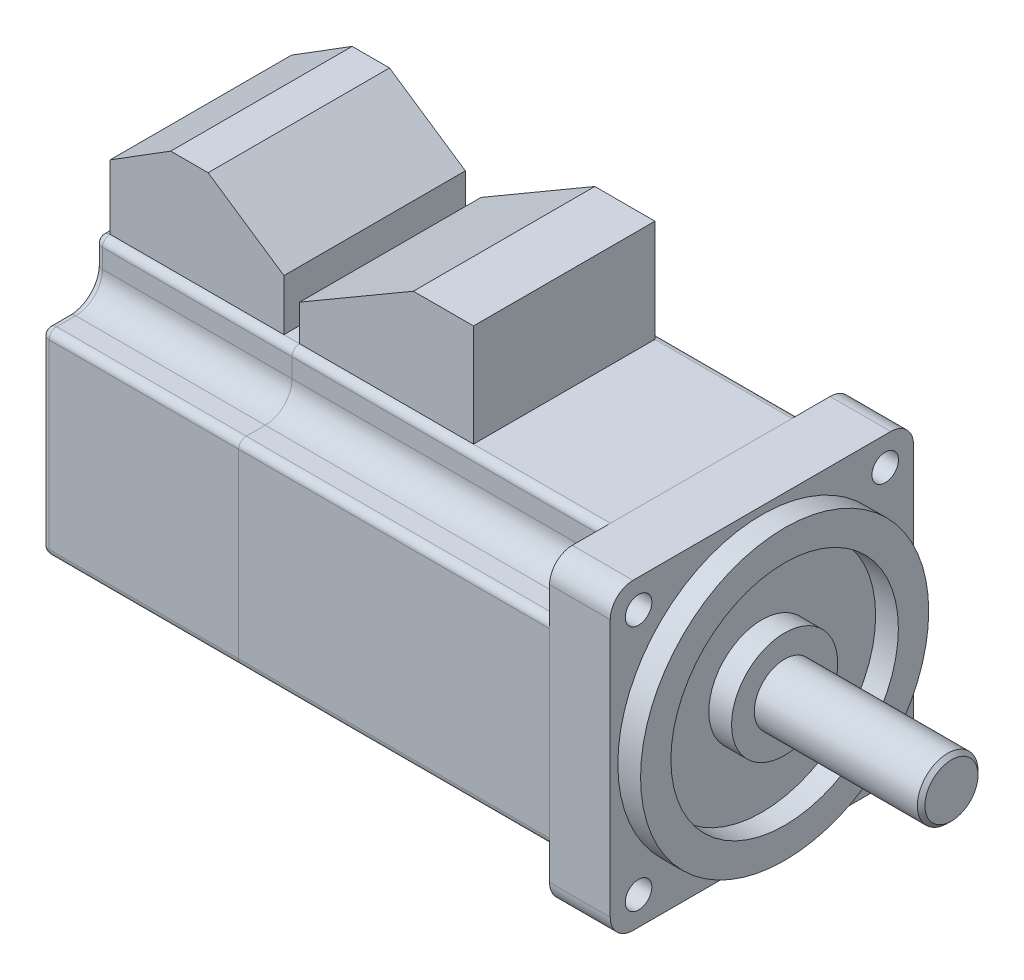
ISO-10303-21;
HEADER;
FILE_DESCRIPTION(('STEP AP214'),'2;1');
FILE_NAME('part.step','',(''),(''),'','','');
FILE_SCHEMA(('AUTOMOTIVE_DESIGN { 1 0 10303 214 1 1 1 1 }'));
ENDSEC;
DATA;
#1=APPLICATION_CONTEXT('core data for automotive mechanical design processes');
#2=APPLICATION_PROTOCOL_DEFINITION('international standard','automotive_design',2000,#1);
#3=PRODUCT_CONTEXT('',#1,'mechanical');
#4=PRODUCT('Part','Part','',(#3));
#5=PRODUCT_RELATED_PRODUCT_CATEGORY('part','',(#4));
#6=PRODUCT_DEFINITION_FORMATION('','',#4);
#7=PRODUCT_DEFINITION_CONTEXT('part definition',#1,'design');
#8=PRODUCT_DEFINITION('design','',#6,#7);
#9=PRODUCT_DEFINITION_SHAPE('','',#8);
#10=(LENGTH_UNIT() NAMED_UNIT(*) SI_UNIT(.MILLI.,.METRE.));
#11=(NAMED_UNIT(*) PLANE_ANGLE_UNIT() SI_UNIT($,.RADIAN.));
#12=(NAMED_UNIT(*) SI_UNIT($,.STERADIAN.) SOLID_ANGLE_UNIT());
#13=UNCERTAINTY_MEASURE_WITH_UNIT(LENGTH_MEASURE(1.E-05),#10,'distance_accuracy_value','');
#14=(GEOMETRIC_REPRESENTATION_CONTEXT(3) GLOBAL_UNCERTAINTY_ASSIGNED_CONTEXT((#13)) GLOBAL_UNIT_ASSIGNED_CONTEXT((#10,
#11,#12)) REPRESENTATION_CONTEXT('',''));
#15=CARTESIAN_POINT('',(0.,0.,0.));
#16=DIRECTION('',(0.,0.,1.));
#17=DIRECTION('',(1.,0.,0.));
#18=AXIS2_PLACEMENT_3D('',#15,#16,#17);
#19=CARTESIAN_POINT('',(23.93,33.5,-11.9644660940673));
#20=DIRECTION('',(-1.,0.,0.));
#21=DIRECTION('',(0.,0.,1.));
#22=AXIS2_PLACEMENT_3D('',#19,#20,#21);
#23=PLANE('',#22);
#24=DIRECTION('',(0.,-1.,0.));
#25=VECTOR('',#24,1.);
#26=CARTESIAN_POINT('',(23.93,33.5,-11.9644660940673));
#27=LINE('',#26,#25);
#28=CARTESIAN_POINT('',(23.93,26.75,-11.9644660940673));
#29=VERTEX_POINT('',#28);
#30=CARTESIAN_POINT('',(23.93,20.,-11.9644660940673));
#31=VERTEX_POINT('',#30);
#32=EDGE_CURVE('E127',#29,#31,#27,.T.);
#33=ORIENTED_EDGE('',*,*,#32,.F.);
#34=DIRECTION('',(0.,0.,1.));
#35=VECTOR('',#34,1.);
#36=CARTESIAN_POINT('',(23.93,26.75,-11.9655339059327));
#37=LINE('',#36,#35);
#38=CARTESIAN_POINT('',(23.93,26.75,11.9644660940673));
#39=VERTEX_POINT('',#38);
#40=EDGE_CURVE('E118',#29,#39,#37,.T.);
#41=ORIENTED_EDGE('',*,*,#40,.T.);
#42=DIRECTION('',(0.,-1.,0.));
#43=VECTOR('',#42,1.);
#44=CARTESIAN_POINT('',(23.93,33.5,11.9644660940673));
#45=LINE('',#44,#43);
#46=CARTESIAN_POINT('',(23.93,20.,11.9644660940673));
#47=VERTEX_POINT('',#46);
#48=EDGE_CURVE('E125',#39,#47,#45,.T.);
#49=ORIENTED_EDGE('',*,*,#48,.T.);
#50=DIRECTION('',(0.,0.,-1.));
#51=VECTOR('',#50,1.);
#52=CARTESIAN_POINT('',(23.93,20.,-11.9644660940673));
#53=LINE('',#52,#51);
#54=EDGE_CURVE('E146',#47,#31,#53,.T.);
#55=ORIENTED_EDGE('',*,*,#54,.T.);
#56=EDGE_LOOP('',(#33,#41,#49,#55));
#57=FACE_BOUND('',#56,.T.);
#58=ADVANCED_FACE('F52',(#57),#23,.F.);
#59=CARTESIAN_POINT('',(1.,33.5,-11.9644660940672));
#60=DIRECTION('',(0.,0.,1.));
#61=DIRECTION('',(1.,0.,0.));
#62=AXIS2_PLACEMENT_3D('',#59,#60,#61);
#63=PLANE('',#62);
#64=DIRECTION('',(0.,-1.,0.));
#65=VECTOR('',#64,1.);
#66=CARTESIAN_POINT('',(1.,33.5,-11.9644660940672));
#67=LINE('',#66,#65);
#68=CARTESIAN_POINT('',(1.,28.5,-11.9644660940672));
#69=VERTEX_POINT('',#68);
#70=CARTESIAN_POINT('',(1.,20.,-11.9644660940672));
#71=VERTEX_POINT('',#70);
#72=EDGE_CURVE('E124',#69,#71,#67,.T.);
#73=ORIENTED_EDGE('',*,*,#72,.F.);
#74=DIRECTION('',(0.847998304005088,0.52999894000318,0.));
#75=VECTOR('',#74,1.);
#76=CARTESIAN_POINT('',(3.24719101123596,29.9044943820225,-11.9644660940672));
#77=LINE('',#76,#75);
#78=CARTESIAN_POINT('',(9.,33.5,-11.9644660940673));
#79=VERTEX_POINT('',#78);
#80=EDGE_CURVE('E104',#69,#79,#77,.T.);
#81=ORIENTED_EDGE('',*,*,#80,.T.);
#82=DIRECTION('',(-1.,0.,0.));
#83=VECTOR('',#82,1.);
#84=CARTESIAN_POINT('',(1.,33.5,-11.9644660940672));
#85=LINE('',#84,#83);
#86=CARTESIAN_POINT('',(13.93,33.5,-11.9644660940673));
#87=VERTEX_POINT('',#86);
#88=EDGE_CURVE('E136',#87,#79,#85,.T.);
#89=ORIENTED_EDGE('',*,*,#88,.F.);
#90=DIRECTION('',(0.828848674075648,-0.559472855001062,0.));
#91=VECTOR('',#90,1.);
#92=CARTESIAN_POINT('',(5.0472176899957,39.4958780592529,-11.9644660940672));
#93=LINE('',#92,#91);
#94=EDGE_CURVE('E73',#87,#29,#93,.T.);
#95=ORIENTED_EDGE('',*,*,#94,.T.);
#96=ORIENTED_EDGE('',*,*,#32,.T.);
#97=DIRECTION('',(-1.,0.,0.));
#98=VECTOR('',#97,1.);
#99=CARTESIAN_POINT('',(1.,20.,-11.9644660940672));
#100=LINE('',#99,#98);
#101=EDGE_CURVE('E149',#31,#71,#100,.T.);
#102=ORIENTED_EDGE('',*,*,#101,.T.);
#103=EDGE_LOOP('',(#73,#81,#89,#95,#96,#102));
#104=FACE_BOUND('',#103,.T.);
#105=ADVANCED_FACE('F138',(#104),#63,.F.);
#106=CARTESIAN_POINT('',(1.,33.5,-11.9644660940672));
#107=DIRECTION('',(1.,0.,0.));
#108=DIRECTION('',(0.,0.,-1.));
#109=AXIS2_PLACEMENT_3D('',#106,#107,#108);
#110=PLANE('',#109);
#111=DIRECTION('',(0.,-1.,0.));
#112=VECTOR('',#111,1.);
#113=CARTESIAN_POINT('',(1.,33.5,11.9644660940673));
#114=LINE('',#113,#112);
#115=CARTESIAN_POINT('',(1.,28.5,11.9644660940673));
#116=VERTEX_POINT('',#115);
#117=CARTESIAN_POINT('',(1.,20.,11.9644660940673));
#118=VERTEX_POINT('',#117);
#119=EDGE_CURVE('E113',#116,#118,#114,.T.);
#120=ORIENTED_EDGE('',*,*,#119,.F.);
#121=DIRECTION('',(0.,0.,1.));
#122=VECTOR('',#121,1.);
#123=CARTESIAN_POINT('',(1.,28.5,-11.9655339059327));
#124=LINE('',#123,#122);
#125=EDGE_CURVE('E101',#69,#116,#124,.T.);
#126=ORIENTED_EDGE('',*,*,#125,.F.);
#127=ORIENTED_EDGE('',*,*,#72,.T.);
#128=DIRECTION('',(0.,0.,1.));
#129=VECTOR('',#128,1.);
#130=CARTESIAN_POINT('',(1.,20.,-11.9644660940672));
#131=LINE('',#130,#129);
#132=EDGE_CURVE('E122',#71,#118,#131,.T.);
#133=ORIENTED_EDGE('',*,*,#132,.T.);
#134=EDGE_LOOP('',(#120,#126,#127,#133));
#135=FACE_BOUND('',#134,.T.);
#136=ADVANCED_FACE('F120',(#135),#110,.F.);
#137=CARTESIAN_POINT('',(23.93,33.5,11.9644660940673));
#138=DIRECTION('',(0.,0.,-1.));
#139=DIRECTION('',(-1.,0.,0.));
#140=AXIS2_PLACEMENT_3D('',#137,#138,#139);
#141=PLANE('',#140);
#142=DIRECTION('',(1.,0.,0.));
#143=VECTOR('',#142,1.);
#144=CARTESIAN_POINT('',(23.93,33.5,11.9644660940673));
#145=LINE('',#144,#143);
#146=CARTESIAN_POINT('',(9.,33.5,11.9644660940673));
#147=VERTEX_POINT('',#146);
#148=CARTESIAN_POINT('',(13.93,33.5,11.9644660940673));
#149=VERTEX_POINT('',#148);
#150=EDGE_CURVE('E117',#147,#149,#145,.T.);
#151=ORIENTED_EDGE('',*,*,#150,.F.);
#152=DIRECTION('',(0.847998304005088,0.52999894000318,0.));
#153=VECTOR('',#152,1.);
#154=CARTESIAN_POINT('',(9.,33.5,11.9644660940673));
#155=LINE('',#154,#153);
#156=EDGE_CURVE('E66',#116,#147,#155,.T.);
#157=ORIENTED_EDGE('',*,*,#156,.F.);
#158=ORIENTED_EDGE('',*,*,#119,.T.);
#159=DIRECTION('',(1.,0.,0.));
#160=VECTOR('',#159,1.);
#161=CARTESIAN_POINT('',(23.93,20.,11.9644660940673));
#162=LINE('',#161,#160);
#163=EDGE_CURVE('E140',#118,#47,#162,.T.);
#164=ORIENTED_EDGE('',*,*,#163,.T.);
#165=ORIENTED_EDGE('',*,*,#48,.F.);
#166=DIRECTION('',(0.828848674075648,-0.559472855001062,0.));
#167=VECTOR('',#166,1.);
#168=CARTESIAN_POINT('',(23.93,26.75,11.9644660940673));
#169=LINE('',#168,#167);
#170=EDGE_CURVE('E157',#149,#39,#169,.T.);
#171=ORIENTED_EDGE('',*,*,#170,.F.);
#172=EDGE_LOOP('',(#151,#157,#158,#164,#165,#171));
#173=FACE_BOUND('',#172,.T.);
#174=ADVANCED_FACE('F111',(#173),#141,.F.);
#175=CARTESIAN_POINT('',(0.,33.5,0.));
#176=DIRECTION('',(0.,-1.,0.));
#177=DIRECTION('',(0.,0.,-1.));
#178=AXIS2_PLACEMENT_3D('',#175,#176,#177);
#179=PLANE('',#178);
#180=ORIENTED_EDGE('',*,*,#88,.T.);
#181=DIRECTION('',(0.,0.,1.));
#182=VECTOR('',#181,1.);
#183=CARTESIAN_POINT('',(9.,33.5,0.));
#184=LINE('',#183,#182);
#185=EDGE_CURVE('E13',#79,#147,#184,.T.);
#186=ORIENTED_EDGE('',*,*,#185,.T.);
#187=ORIENTED_EDGE('',*,*,#150,.T.);
#188=DIRECTION('',(0.,0.,-1.));
#189=VECTOR('',#188,1.);
#190=CARTESIAN_POINT('',(13.93,33.5,0.));
#191=LINE('',#190,#189);
#192=EDGE_CURVE('E59',#149,#87,#191,.T.);
#193=ORIENTED_EDGE('',*,*,#192,.T.);
#194=EDGE_LOOP('',(#180,#186,#187,#193));
#195=FACE_BOUND('',#194,.T.);
#196=ADVANCED_FACE('F135',(#195),#179,.F.);
#197=CARTESIAN_POINT('',(0.,20.,0.));
#198=DIRECTION('',(0.,-1.,0.));
#199=DIRECTION('',(0.,0.,-1.));
#200=AXIS2_PLACEMENT_3D('',#197,#198,#199);
#201=PLANE('',#200);
#202=ORIENTED_EDGE('',*,*,#54,.F.);
#203=ORIENTED_EDGE('',*,*,#163,.F.);
#204=ORIENTED_EDGE('',*,*,#132,.F.);
#205=ORIENTED_EDGE('',*,*,#101,.F.);
#206=EDGE_LOOP('',(#202,#203,#204,#205));
#207=FACE_BOUND('',#206,.T.);
#208=ADVANCED_FACE('F155',(#207),#201,.T.);
#209=CARTESIAN_POINT('',(23.93,26.75,-11.9655339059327));
#210=DIRECTION('',(-0.559472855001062,-0.828848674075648,0.));
#211=DIRECTION('',(0.828848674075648,-0.559472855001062,0.));
#212=AXIS2_PLACEMENT_3D('',#209,#210,#211);
#213=PLANE('',#212);
#214=ORIENTED_EDGE('',*,*,#192,.F.);
#215=ORIENTED_EDGE('',*,*,#170,.T.);
#216=ORIENTED_EDGE('',*,*,#40,.F.);
#217=ORIENTED_EDGE('',*,*,#94,.F.);
#218=EDGE_LOOP('',(#214,#215,#216,#217));
#219=FACE_BOUND('',#218,.T.);
#220=ADVANCED_FACE('F162',(#219),#213,.F.);
#221=CARTESIAN_POINT('',(9.,33.5,-11.9655339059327));
#222=DIRECTION('',(0.52999894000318,-0.847998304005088,0.));
#223=DIRECTION('',(0.847998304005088,0.52999894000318,0.));
#224=AXIS2_PLACEMENT_3D('',#221,#222,#223);
#225=PLANE('',#224);
#226=ORIENTED_EDGE('',*,*,#125,.T.);
#227=ORIENTED_EDGE('',*,*,#156,.T.);
#228=ORIENTED_EDGE('',*,*,#185,.F.);
#229=ORIENTED_EDGE('',*,*,#80,.F.);
#230=EDGE_LOOP('',(#226,#227,#228,#229));
#231=FACE_BOUND('',#230,.T.);
#232=ADVANCED_FACE('F102',(#231),#225,.F.);
#233=CLOSED_SHELL('',(#58,#105,#136,#174,#196,#208,#220,#232));
#234=MANIFOLD_SOLID_BREP('B2',#233);
#235=CARTESIAN_POINT('',(26.,33.5,11.9644660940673));
#236=DIRECTION('',(1.,0.,0.));
#237=DIRECTION('',(0.,0.,-1.));
#238=AXIS2_PLACEMENT_3D('',#235,#236,#237);
#239=PLANE('',#238);
#240=DIRECTION('',(0.,-1.,0.));
#241=VECTOR('',#240,1.);
#242=CARTESIAN_POINT('',(26.,33.5,11.9644660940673));
#243=LINE('',#242,#241);
#244=CARTESIAN_POINT('',(26.,24.7508234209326,11.9644660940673));
#245=VERTEX_POINT('',#244);
#246=CARTESIAN_POINT('',(26.,20.,11.9644660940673));
#247=VERTEX_POINT('',#246);
#248=EDGE_CURVE('E243',#245,#247,#243,.T.);
#249=ORIENTED_EDGE('',*,*,#248,.F.);
#250=DIRECTION('',(0.,0.,1.));
#251=VECTOR('',#250,1.);
#252=CARTESIAN_POINT('',(26.,24.7508234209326,-11.9655339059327));
#253=LINE('',#252,#251);
#254=CARTESIAN_POINT('',(26.,24.7508234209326,-11.9644660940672));
#255=VERTEX_POINT('',#254);
#256=EDGE_CURVE('E284',#255,#245,#253,.T.);
#257=ORIENTED_EDGE('',*,*,#256,.F.);
#258=DIRECTION('',(0.,-1.,0.));
#259=VECTOR('',#258,1.);
#260=CARTESIAN_POINT('',(26.,33.5,-11.9644660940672));
#261=LINE('',#260,#259);
#262=CARTESIAN_POINT('',(26.,20.,-11.9644660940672));
#263=VERTEX_POINT('',#262);
#264=EDGE_CURVE('E278',#255,#263,#261,.T.);
#265=ORIENTED_EDGE('',*,*,#264,.T.);
#266=DIRECTION('',(0.,0.,1.));
#267=VECTOR('',#266,1.);
#268=CARTESIAN_POINT('',(26.,20.,11.9644660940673));
#269=LINE('',#268,#267);
#270=EDGE_CURVE('E282',#263,#247,#269,.T.);
#271=ORIENTED_EDGE('',*,*,#270,.T.);
#272=EDGE_LOOP('',(#249,#257,#265,#271));
#273=FACE_BOUND('',#272,.T.);
#274=ADVANCED_FACE('F236',(#273),#239,.F.);
#275=CARTESIAN_POINT('',(48.93,33.5,11.9644660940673));
#276=DIRECTION('',(0.,0.,-1.));
#277=DIRECTION('',(-1.,0.,0.));
#278=AXIS2_PLACEMENT_3D('',#275,#276,#277);
#279=PLANE('',#278);
#280=DIRECTION('',(1.,0.,0.));
#281=VECTOR('',#280,1.);
#282=CARTESIAN_POINT('',(48.93,33.5,11.9644660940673));
#283=LINE('',#282,#281);
#284=CARTESIAN_POINT('',(41.,33.5,11.9644660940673));
#285=VERTEX_POINT('',#284);
#286=CARTESIAN_POINT('',(48.93,33.5,11.9644660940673));
#287=VERTEX_POINT('',#286);
#288=EDGE_CURVE('E297',#285,#287,#283,.T.);
#289=ORIENTED_EDGE('',*,*,#288,.F.);
#290=DIRECTION('',(0.863799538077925,0.503835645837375,0.));
#291=VECTOR('',#290,1.);
#292=CARTESIAN_POINT('',(26.,24.7508234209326,11.9644660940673));
#293=LINE('',#292,#291);
#294=EDGE_CURVE('E250',#245,#285,#293,.T.);
#295=ORIENTED_EDGE('',*,*,#294,.F.);
#296=ORIENTED_EDGE('',*,*,#248,.T.);
#297=DIRECTION('',(1.,0.,0.));
#298=VECTOR('',#297,1.);
#299=CARTESIAN_POINT('',(48.93,20.,11.9644660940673));
#300=LINE('',#299,#298);
#301=CARTESIAN_POINT('',(48.93,20.,11.9644660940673));
#302=VERTEX_POINT('',#301);
#303=EDGE_CURVE('E302',#247,#302,#300,.T.);
#304=ORIENTED_EDGE('',*,*,#303,.T.);
#305=DIRECTION('',(0.,-1.,0.));
#306=VECTOR('',#305,1.);
#307=CARTESIAN_POINT('',(48.93,33.5,11.9644660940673));
#308=LINE('',#307,#306);
#309=EDGE_CURVE('E312',#287,#302,#308,.T.);
#310=ORIENTED_EDGE('',*,*,#309,.F.);
#311=EDGE_LOOP('',(#289,#295,#296,#304,#310));
#312=FACE_BOUND('',#311,.T.);
#313=ADVANCED_FACE('F316',(#312),#279,.F.);
#314=CARTESIAN_POINT('',(48.93,33.5,-11.9644660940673));
#315=DIRECTION('',(-1.,0.,0.));
#316=DIRECTION('',(0.,0.,1.));
#317=AXIS2_PLACEMENT_3D('',#314,#315,#316);
#318=PLANE('',#317);
#319=DIRECTION('',(0.,0.,-1.));
#320=VECTOR('',#319,1.);
#321=CARTESIAN_POINT('',(48.93,20.,-11.9644660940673));
#322=LINE('',#321,#320);
#323=CARTESIAN_POINT('',(48.93,20.,-11.9644660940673));
#324=VERTEX_POINT('',#323);
#325=EDGE_CURVE('E298',#302,#324,#322,.T.);
#326=ORIENTED_EDGE('',*,*,#325,.T.);
#327=DIRECTION('',(0.,-1.,0.));
#328=VECTOR('',#327,1.);
#329=CARTESIAN_POINT('',(48.93,33.5,-11.9644660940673));
#330=LINE('',#329,#328);
#331=CARTESIAN_POINT('',(48.93,33.5,-11.9644660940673));
#332=VERTEX_POINT('',#331);
#333=EDGE_CURVE('E287',#332,#324,#330,.T.);
#334=ORIENTED_EDGE('',*,*,#333,.F.);
#335=DIRECTION('',(0.,0.,-1.));
#336=VECTOR('',#335,1.);
#337=CARTESIAN_POINT('',(48.93,33.5,-11.9644660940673));
#338=LINE('',#337,#336);
#339=EDGE_CURVE('E258',#287,#332,#338,.T.);
#340=ORIENTED_EDGE('',*,*,#339,.F.);
#341=ORIENTED_EDGE('',*,*,#309,.T.);
#342=EDGE_LOOP('',(#326,#334,#340,#341));
#343=FACE_BOUND('',#342,.T.);
#344=ADVANCED_FACE('F328',(#343),#318,.F.);
#345=CARTESIAN_POINT('',(26.,33.5,-11.9644660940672));
#346=DIRECTION('',(0.,0.,1.));
#347=DIRECTION('',(1.,0.,0.));
#348=AXIS2_PLACEMENT_3D('',#345,#346,#347);
#349=PLANE('',#348);
#350=ORIENTED_EDGE('',*,*,#264,.F.);
#351=DIRECTION('',(0.863799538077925,0.503835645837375,0.));
#352=VECTOR('',#351,1.);
#353=CARTESIAN_POINT('',(29.8077553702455,26.9718050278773,-11.9644660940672));
#354=LINE('',#353,#352);
#355=CARTESIAN_POINT('',(41.,33.5,-11.9644660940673));
#356=VERTEX_POINT('',#355);
#357=EDGE_CURVE('E303',#255,#356,#354,.T.);
#358=ORIENTED_EDGE('',*,*,#357,.T.);
#359=DIRECTION('',(-1.,0.,0.));
#360=VECTOR('',#359,1.);
#361=CARTESIAN_POINT('',(26.,33.5,-11.9644660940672));
#362=LINE('',#361,#360);
#363=EDGE_CURVE('E288',#332,#356,#362,.T.);
#364=ORIENTED_EDGE('',*,*,#363,.F.);
#365=ORIENTED_EDGE('',*,*,#333,.T.);
#366=DIRECTION('',(-1.,0.,0.));
#367=VECTOR('',#366,1.);
#368=CARTESIAN_POINT('',(26.,20.,-11.9644660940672));
#369=LINE('',#368,#367);
#370=EDGE_CURVE('E292',#324,#263,#369,.T.);
#371=ORIENTED_EDGE('',*,*,#370,.T.);
#372=EDGE_LOOP('',(#350,#358,#364,#365,#371));
#373=FACE_BOUND('',#372,.T.);
#374=ADVANCED_FACE('F293',(#373),#349,.F.);
#375=CARTESIAN_POINT('',(0.,33.5,0.));
#376=DIRECTION('',(0.,-1.,0.));
#377=DIRECTION('',(0.,0.,-1.));
#378=AXIS2_PLACEMENT_3D('',#375,#376,#377);
#379=PLANE('',#378);
#380=ORIENTED_EDGE('',*,*,#363,.T.);
#381=DIRECTION('',(0.,0.,1.));
#382=VECTOR('',#381,1.);
#383=CARTESIAN_POINT('',(41.,33.5,0.));
#384=LINE('',#383,#382);
#385=EDGE_CURVE('E50',#356,#285,#384,.T.);
#386=ORIENTED_EDGE('',*,*,#385,.T.);
#387=ORIENTED_EDGE('',*,*,#288,.T.);
#388=ORIENTED_EDGE('',*,*,#339,.T.);
#389=EDGE_LOOP('',(#380,#386,#387,#388));
#390=FACE_BOUND('',#389,.T.);
#391=ADVANCED_FACE('F323',(#390),#379,.F.);
#392=CARTESIAN_POINT('',(0.,20.,0.));
#393=DIRECTION('',(0.,-1.,0.));
#394=DIRECTION('',(0.,0.,-1.));
#395=AXIS2_PLACEMENT_3D('',#392,#393,#394);
#396=PLANE('',#395);
#397=ORIENTED_EDGE('',*,*,#270,.F.);
#398=ORIENTED_EDGE('',*,*,#370,.F.);
#399=ORIENTED_EDGE('',*,*,#325,.F.);
#400=ORIENTED_EDGE('',*,*,#303,.F.);
#401=EDGE_LOOP('',(#397,#398,#399,#400));
#402=FACE_BOUND('',#401,.T.);
#403=ADVANCED_FACE('F301',(#402),#396,.T.);
#404=CARTESIAN_POINT('',(26.,24.7508234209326,-11.9655339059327));
#405=DIRECTION('',(0.503835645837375,-0.863799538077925,0.));
#406=DIRECTION('',(0.863799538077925,0.503835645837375,0.));
#407=AXIS2_PLACEMENT_3D('',#404,#405,#406);
#408=PLANE('',#407);
#409=ORIENTED_EDGE('',*,*,#256,.T.);
#410=ORIENTED_EDGE('',*,*,#294,.T.);
#411=ORIENTED_EDGE('',*,*,#385,.F.);
#412=ORIENTED_EDGE('',*,*,#357,.F.);
#413=EDGE_LOOP('',(#409,#410,#411,#412));
#414=FACE_BOUND('',#413,.T.);
#415=ADVANCED_FACE('F322',(#414),#408,.F.);
#416=CLOSED_SHELL('',(#274,#313,#344,#374,#391,#403,#415));
#417=MANIFOLD_SOLID_BREP('B7',#416);
#418=CARTESIAN_POINT('',(100.,0.,0.));
#419=DIRECTION('',(-1.,0.,0.));
#420=DIRECTION('',(0.,0.,1.));
#421=AXIS2_PLACEMENT_3D('',#418,#419,#420);
#422=CYLINDRICAL_SURFACE('',#421,4.);
#423=CARTESIAN_POINT('',(99.5,0.,0.));
#424=DIRECTION('',(1.,0.,0.));
#425=DIRECTION('',(0.,0.,-1.));
#426=AXIS2_PLACEMENT_3D('',#423,#424,#425);
#427=CIRCLE('',#426,4.);
#428=CARTESIAN_POINT('',(99.5,0.,-4.));
#429=VERTEX_POINT('',#428);
#430=EDGE_CURVE('E235',#429,#429,#427,.F.);
#431=ORIENTED_EDGE('',*,*,#430,.T.);
#432=EDGE_LOOP('',(#431));
#433=FACE_BOUND('',#432,.T.);
#434=CARTESIAN_POINT('',(78.,0.,0.));
#435=DIRECTION('',(1.,0.,0.));
#436=DIRECTION('',(0.,0.,-1.));
#437=AXIS2_PLACEMENT_3D('',#434,#435,#436);
#438=CIRCLE('',#437,4.);
#439=CARTESIAN_POINT('',(78.,0.,-4.));
#440=VERTEX_POINT('',#439);
#441=EDGE_CURVE('E407',#440,#440,#438,.T.);
#442=ORIENTED_EDGE('',*,*,#441,.T.);
#443=EDGE_LOOP('',(#442));
#444=FACE_BOUND('',#443,.T.);
#445=ADVANCED_FACE('F396',(#433,#444),#422,.T.);
#446=CARTESIAN_POINT('',(100.,0.,0.));
#447=DIRECTION('',(1.,0.,0.));
#448=DIRECTION('',(0.,0.,-1.));
#449=AXIS2_PLACEMENT_3D('',#446,#447,#448);
#450=PLANE('',#449);
#451=CARTESIAN_POINT('',(100.,0.,0.));
#452=DIRECTION('',(1.,0.,0.));
#453=DIRECTION('',(0.,0.,-1.));
#454=AXIS2_PLACEMENT_3D('',#451,#452,#453);
#455=CIRCLE('',#454,3.49999999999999);
#456=CARTESIAN_POINT('',(100.,0.,-3.49999999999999));
#457=VERTEX_POINT('',#456);
#458=EDGE_CURVE('E403',#457,#457,#455,.T.);
#459=ORIENTED_EDGE('',*,*,#458,.T.);
#460=EDGE_LOOP('',(#459));
#461=FACE_BOUND('',#460,.T.);
#462=ADVANCED_FACE('F417',(#461),#450,.T.);
#463=CARTESIAN_POINT('',(78.,0.,0.));
#464=DIRECTION('',(1.,0.,0.));
#465=DIRECTION('',(0.,0.,-1.));
#466=AXIS2_PLACEMENT_3D('',#463,#464,#465);
#467=PLANE('',#466);
#468=ORIENTED_EDGE('',*,*,#441,.F.);
#469=EDGE_LOOP('',(#468));
#470=FACE_BOUND('',#469,.T.);
#471=ADVANCED_FACE('F415',(#470),#467,.F.);
#472=CARTESIAN_POINT('',(100.,0.,0.));
#473=DIRECTION('',(-1.,0.,0.));
#474=DIRECTION('',(0.,0.,1.));
#475=AXIS2_PLACEMENT_3D('',#472,#473,#474);
#476=CONICAL_SURFACE('',#475,3.49999999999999,0.785398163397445);
#477=ORIENTED_EDGE('',*,*,#430,.F.);
#478=EDGE_LOOP('',(#477));
#479=FACE_BOUND('',#478,.T.);
#480=ORIENTED_EDGE('',*,*,#458,.F.);
#481=EDGE_LOOP('',(#480));
#482=FACE_BOUND('',#481,.T.);
#483=ADVANCED_FACE('F398',(#479,#482),#476,.T.);
#484=CLOSED_SHELL('',(#445,#462,#471,#483));
#485=MANIFOLD_SOLID_BREP('B44',#484);
#486=CARTESIAN_POINT('',(75.,17.,-17.));
#487=DIRECTION('',(-1.,0.,0.));
#488=DIRECTION('',(0.,0.,1.));
#489=AXIS2_PLACEMENT_3D('',#486,#487,#488);
#490=PLANE('',#489);
#491=CARTESIAN_POINT('',(75.,0.,0.));
#492=DIRECTION('',(1.,0.,0.));
#493=DIRECTION('',(0.,0.,-1.));
#494=AXIS2_PLACEMENT_3D('',#491,#492,#493);
#495=CIRCLE('',#494,15.);
#496=CARTESIAN_POINT('',(75.,0.,-15.));
#497=VERTEX_POINT('',#496);
#498=EDGE_CURVE('E674',#497,#497,#495,.T.);
#499=ORIENTED_EDGE('',*,*,#498,.T.);
#500=EDGE_LOOP('',(#499));
#501=FACE_BOUND('',#500,.T.);
#502=CARTESIAN_POINT('',(75.,0.,0.));
#503=DIRECTION('',(-1.,0.,0.));
#504=DIRECTION('',(0.,0.,1.));
#505=AXIS2_PLACEMENT_3D('',#502,#503,#504);
#506=CIRCLE('',#505,7.);
#507=CARTESIAN_POINT('',(75.,0.,7.));
#508=VERTEX_POINT('',#507);
#509=EDGE_CURVE('E394',#508,#508,#506,.F.);
#510=ORIENTED_EDGE('',*,*,#509,.F.);
#511=EDGE_LOOP('',(#510));
#512=FACE_BOUND('',#511,.T.);
#513=ADVANCED_FACE('F462',(#501,#512),#490,.F.);
#514=CARTESIAN_POINT('',(75.,17.,-17.));
#515=DIRECTION('',(1.,0.,0.));
#516=DIRECTION('',(0.,0.,1.));
#517=AXIS2_PLACEMENT_3D('',#514,#515,#516);
#518=CIRCLE('',#517,3.);
#519=CARTESIAN_POINT('',(75.,17.,-20.));
#520=VERTEX_POINT('',#519);
#521=CARTESIAN_POINT('',(75.,20.,-17.));
#522=VERTEX_POINT('',#521);
#523=EDGE_CURVE('E576',#520,#522,#518,.T.);
#524=ORIENTED_EDGE('',*,*,#523,.T.);
#525=DIRECTION('',(0.,0.,1.));
#526=VECTOR('',#525,1.);
#527=CARTESIAN_POINT('',(75.,20.,17.));
#528=LINE('',#527,#526);
#529=CARTESIAN_POINT('',(75.,20.,17.));
#530=VERTEX_POINT('',#529);
#531=EDGE_CURVE('E523',#522,#530,#528,.T.);
#532=ORIENTED_EDGE('',*,*,#531,.T.);
#533=CARTESIAN_POINT('',(75.,17.,17.));
#534=DIRECTION('',(1.,0.,0.));
#535=DIRECTION('',(0.,0.,1.));
#536=AXIS2_PLACEMENT_3D('',#533,#534,#535);
#537=CIRCLE('',#536,3.);
#538=CARTESIAN_POINT('',(75.,17.,20.));
#539=VERTEX_POINT('',#538);
#540=EDGE_CURVE('E639',#530,#539,#537,.T.);
#541=ORIENTED_EDGE('',*,*,#540,.T.);
#542=DIRECTION('',(0.,-1.,0.));
#543=VECTOR('',#542,1.);
#544=CARTESIAN_POINT('',(75.,-17.,20.));
#545=LINE('',#544,#543);
#546=CARTESIAN_POINT('',(75.,-17.,20.));
#547=VERTEX_POINT('',#546);
#548=EDGE_CURVE('E644',#539,#547,#545,.T.);
#549=ORIENTED_EDGE('',*,*,#548,.T.);
#550=CARTESIAN_POINT('',(75.,-17.,17.));
#551=DIRECTION('',(1.,0.,0.));
#552=DIRECTION('',(0.,0.,1.));
#553=AXIS2_PLACEMENT_3D('',#550,#551,#552);
#554=CIRCLE('',#553,3.);
#555=CARTESIAN_POINT('',(75.,-20.,17.));
#556=VERTEX_POINT('',#555);
#557=EDGE_CURVE('E543',#547,#556,#554,.T.);
#558=ORIENTED_EDGE('',*,*,#557,.T.);
#559=DIRECTION('',(0.,0.,-1.));
#560=VECTOR('',#559,1.);
#561=CARTESIAN_POINT('',(75.,-20.,17.));
#562=LINE('',#561,#560);
#563=CARTESIAN_POINT('',(75.,-20.,-17.));
#564=VERTEX_POINT('',#563);
#565=EDGE_CURVE('E536',#556,#564,#562,.T.);
#566=ORIENTED_EDGE('',*,*,#565,.T.);
#567=CARTESIAN_POINT('',(75.,-17.,-17.));
#568=DIRECTION('',(1.,0.,0.));
#569=DIRECTION('',(0.,0.,-1.));
#570=AXIS2_PLACEMENT_3D('',#567,#568,#569);
#571=CIRCLE('',#570,3.);
#572=CARTESIAN_POINT('',(75.,-17.,-20.));
#573=VERTEX_POINT('',#572);
#574=EDGE_CURVE('E541',#564,#573,#571,.T.);
#575=ORIENTED_EDGE('',*,*,#574,.T.);
#576=DIRECTION('',(0.,1.,0.));
#577=VECTOR('',#576,1.);
#578=CARTESIAN_POINT('',(75.,-17.,-20.));
#579=LINE('',#578,#577);
#580=EDGE_CURVE('E479',#573,#520,#579,.T.);
#581=ORIENTED_EDGE('',*,*,#580,.T.);
#582=EDGE_LOOP('',(#524,#532,#541,#549,#558,#566,#575,#581));
#583=FACE_BOUND('',#582,.T.);
#584=CARTESIAN_POINT('',(75.,16.2634559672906,16.2634559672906));
#585=DIRECTION('',(1.,0.,0.));
#586=DIRECTION('',(0.,0.,-1.));
#587=AXIS2_PLACEMENT_3D('',#584,#585,#586);
#588=CIRCLE('',#587,1.75);
#589=CARTESIAN_POINT('',(75.,16.2634559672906,14.5134559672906));
#590=VERTEX_POINT('',#589);
#591=EDGE_CURVE('E650',#590,#590,#588,.T.);
#592=ORIENTED_EDGE('',*,*,#591,.F.);
#593=EDGE_LOOP('',(#592));
#594=FACE_BOUND('',#593,.T.);
#595=CARTESIAN_POINT('',(75.,16.2634559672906,-16.2634559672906));
#596=DIRECTION('',(1.,0.,0.));
#597=DIRECTION('',(0.,0.,-1.));
#598=AXIS2_PLACEMENT_3D('',#595,#596,#597);
#599=CIRCLE('',#598,1.75);
#600=CARTESIAN_POINT('',(75.,16.2634559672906,-18.0134559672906));
#601=VERTEX_POINT('',#600);
#602=EDGE_CURVE('E656',#601,#601,#599,.T.);
#603=ORIENTED_EDGE('',*,*,#602,.F.);
#604=EDGE_LOOP('',(#603));
#605=FACE_BOUND('',#604,.T.);
#606=CARTESIAN_POINT('',(75.,-16.2634559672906,-16.2634559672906));
#607=DIRECTION('',(1.,0.,0.));
#608=DIRECTION('',(0.,0.,-1.));
#609=AXIS2_PLACEMENT_3D('',#606,#607,#608);
#610=CIRCLE('',#609,1.75);
#611=CARTESIAN_POINT('',(75.,-16.2634559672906,-18.0134559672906));
#612=VERTEX_POINT('',#611);
#613=EDGE_CURVE('E662',#612,#612,#610,.T.);
#614=ORIENTED_EDGE('',*,*,#613,.F.);
#615=EDGE_LOOP('',(#614));
#616=FACE_BOUND('',#615,.T.);
#617=CARTESIAN_POINT('',(75.,-16.2634559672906,16.2634559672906));
#618=DIRECTION('',(1.,0.,0.));
#619=DIRECTION('',(0.,0.,-1.));
#620=AXIS2_PLACEMENT_3D('',#617,#618,#619);
#621=CIRCLE('',#620,1.75);
#622=CARTESIAN_POINT('',(75.,-16.2634559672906,14.5134559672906));
#623=VERTEX_POINT('',#622);
#624=EDGE_CURVE('E668',#623,#623,#621,.T.);
#625=ORIENTED_EDGE('',*,*,#624,.F.);
#626=EDGE_LOOP('',(#625));
#627=FACE_BOUND('',#626,.T.);
#628=CARTESIAN_POINT('',(75.,0.,0.));
#629=DIRECTION('',(-1.,0.,0.));
#630=DIRECTION('',(0.,0.,1.));
#631=AXIS2_PLACEMENT_3D('',#628,#629,#630);
#632=CIRCLE('',#631,19.);
#633=CARTESIAN_POINT('',(75.,0.,19.));
#634=VERTEX_POINT('',#633);
#635=EDGE_CURVE('E471',#634,#634,#632,.F.);
#636=ORIENTED_EDGE('',*,*,#635,.F.);
#637=EDGE_LOOP('',(#636));
#638=FACE_BOUND('',#637,.T.);
#639=ADVANCED_FACE('F538',(#583,#594,#605,#616,#627,#638),#490,.F.);
#640=CARTESIAN_POINT('',(75.,17.,-17.));
#641=DIRECTION('',(-1.,0.,0.));
#642=DIRECTION('',(0.,0.,1.));
#643=AXIS2_PLACEMENT_3D('',#640,#641,#642);
#644=CYLINDRICAL_SURFACE('',#643,3.);
#645=CARTESIAN_POINT('',(67.,17.,-17.));
#646=DIRECTION('',(1.,0.,0.));
#647=DIRECTION('',(0.,0.,1.));
#648=AXIS2_PLACEMENT_3D('',#645,#646,#647);
#649=CIRCLE('',#648,3.);
#650=CARTESIAN_POINT('',(67.,17.,-20.));
#651=VERTEX_POINT('',#650);
#652=CARTESIAN_POINT('',(67.,20.,-17.));
#653=VERTEX_POINT('',#652);
#654=EDGE_CURVE('E561',#651,#653,#649,.T.);
#655=ORIENTED_EDGE('',*,*,#654,.T.);
#656=DIRECTION('',(-1.,0.,0.));
#657=VECTOR('',#656,1.);
#658=CARTESIAN_POINT('',(75.,20.,-17.));
#659=LINE('',#658,#657);
#660=EDGE_CURVE('E589',#522,#653,#659,.T.);
#661=ORIENTED_EDGE('',*,*,#660,.F.);
#662=ORIENTED_EDGE('',*,*,#523,.F.);
#663=DIRECTION('',(-1.,0.,0.));
#664=VECTOR('',#663,1.);
#665=CARTESIAN_POINT('',(75.,17.,-20.));
#666=LINE('',#665,#664);
#667=EDGE_CURVE('E557',#520,#651,#666,.T.);
#668=ORIENTED_EDGE('',*,*,#667,.T.);
#669=EDGE_LOOP('',(#655,#661,#662,#668));
#670=FACE_BOUND('',#669,.T.);
#671=ADVANCED_FACE('F464',(#670),#644,.T.);
#672=CARTESIAN_POINT('',(75.,20.,17.));
#673=DIRECTION('',(0.,-1.,0.));
#674=DIRECTION('',(0.,0.,-1.));
#675=AXIS2_PLACEMENT_3D('',#672,#673,#674);
#676=PLANE('',#675);
#677=DIRECTION('',(0.,0.,1.));
#678=VECTOR('',#677,1.);
#679=CARTESIAN_POINT('',(67.,20.,17.));
#680=LINE('',#679,#678);
#681=CARTESIAN_POINT('',(67.,20.,17.));
#682=VERTEX_POINT('',#681);
#683=EDGE_CURVE('E564',#653,#682,#680,.T.);
#684=ORIENTED_EDGE('',*,*,#683,.T.);
#685=DIRECTION('',(-1.,0.,0.));
#686=VECTOR('',#685,1.);
#687=CARTESIAN_POINT('',(75.,20.,17.));
#688=LINE('',#687,#686);
#689=EDGE_CURVE('E586',#530,#682,#688,.T.);
#690=ORIENTED_EDGE('',*,*,#689,.F.);
#691=ORIENTED_EDGE('',*,*,#531,.F.);
#692=ORIENTED_EDGE('',*,*,#660,.T.);
#693=EDGE_LOOP('',(#684,#690,#691,#692));
#694=FACE_BOUND('',#693,.T.);
#695=ADVANCED_FACE('F601',(#694),#676,.F.);
#696=CARTESIAN_POINT('',(75.,17.,17.));
#697=DIRECTION('',(-1.,0.,0.));
#698=DIRECTION('',(0.,0.,1.));
#699=AXIS2_PLACEMENT_3D('',#696,#697,#698);
#700=CYLINDRICAL_SURFACE('',#699,3.);
#701=CARTESIAN_POINT('',(67.,17.,17.));
#702=DIRECTION('',(1.,0.,0.));
#703=DIRECTION('',(0.,0.,1.));
#704=AXIS2_PLACEMENT_3D('',#701,#702,#703);
#705=CIRCLE('',#704,3.);
#706=CARTESIAN_POINT('',(67.,17.,20.));
#707=VERTEX_POINT('',#706);
#708=EDGE_CURVE('E567',#682,#707,#705,.T.);
#709=ORIENTED_EDGE('',*,*,#708,.T.);
#710=DIRECTION('',(-1.,0.,0.));
#711=VECTOR('',#710,1.);
#712=CARTESIAN_POINT('',(75.,17.,20.));
#713=LINE('',#712,#711);
#714=EDGE_CURVE('E583',#539,#707,#713,.T.);
#715=ORIENTED_EDGE('',*,*,#714,.F.);
#716=ORIENTED_EDGE('',*,*,#540,.F.);
#717=ORIENTED_EDGE('',*,*,#689,.T.);
#718=EDGE_LOOP('',(#709,#715,#716,#717));
#719=FACE_BOUND('',#718,.T.);
#720=ADVANCED_FACE('F626',(#719),#700,.T.);
#721=CARTESIAN_POINT('',(75.,-17.,20.));
#722=DIRECTION('',(0.,0.,-1.));
#723=DIRECTION('',(-1.,0.,0.));
#724=AXIS2_PLACEMENT_3D('',#721,#722,#723);
#725=PLANE('',#724);
#726=DIRECTION('',(0.,-1.,0.));
#727=VECTOR('',#726,1.);
#728=CARTESIAN_POINT('',(67.,-17.,20.));
#729=LINE('',#728,#727);
#730=CARTESIAN_POINT('',(67.,-17.,20.));
#731=VERTEX_POINT('',#730);
#732=EDGE_CURVE('E569',#707,#731,#729,.T.);
#733=ORIENTED_EDGE('',*,*,#732,.T.);
#734=DIRECTION('',(-1.,0.,0.));
#735=VECTOR('',#734,1.);
#736=CARTESIAN_POINT('',(75.,-17.,20.));
#737=LINE('',#736,#735);
#738=EDGE_CURVE('E580',#547,#731,#737,.T.);
#739=ORIENTED_EDGE('',*,*,#738,.F.);
#740=ORIENTED_EDGE('',*,*,#548,.F.);
#741=ORIENTED_EDGE('',*,*,#714,.T.);
#742=EDGE_LOOP('',(#733,#739,#740,#741));
#743=FACE_BOUND('',#742,.T.);
#744=ADVANCED_FACE('F622',(#743),#725,.F.);
#745=CARTESIAN_POINT('',(75.,-17.,17.));
#746=DIRECTION('',(-1.,0.,0.));
#747=DIRECTION('',(0.,0.,1.));
#748=AXIS2_PLACEMENT_3D('',#745,#746,#747);
#749=CYLINDRICAL_SURFACE('',#748,3.);
#750=CARTESIAN_POINT('',(67.,-17.,17.));
#751=DIRECTION('',(1.,0.,0.));
#752=DIRECTION('',(0.,0.,1.));
#753=AXIS2_PLACEMENT_3D('',#750,#751,#752);
#754=CIRCLE('',#753,3.);
#755=CARTESIAN_POINT('',(67.,-20.,17.));
#756=VERTEX_POINT('',#755);
#757=EDGE_CURVE('E571',#731,#756,#754,.T.);
#758=ORIENTED_EDGE('',*,*,#757,.T.);
#759=DIRECTION('',(-1.,0.,0.));
#760=VECTOR('',#759,1.);
#761=CARTESIAN_POINT('',(75.,-20.,17.));
#762=LINE('',#761,#760);
#763=EDGE_CURVE('E552',#556,#756,#762,.T.);
#764=ORIENTED_EDGE('',*,*,#763,.F.);
#765=ORIENTED_EDGE('',*,*,#557,.F.);
#766=ORIENTED_EDGE('',*,*,#738,.T.);
#767=EDGE_LOOP('',(#758,#764,#765,#766));
#768=FACE_BOUND('',#767,.T.);
#769=ADVANCED_FACE('F619',(#768),#749,.T.);
#770=CARTESIAN_POINT('',(75.,-20.,17.));
#771=DIRECTION('',(0.,1.,0.));
#772=DIRECTION('',(0.,0.,1.));
#773=AXIS2_PLACEMENT_3D('',#770,#771,#772);
#774=PLANE('',#773);
#775=DIRECTION('',(0.,0.,-1.));
#776=VECTOR('',#775,1.);
#777=CARTESIAN_POINT('',(67.,-20.,17.));
#778=LINE('',#777,#776);
#779=CARTESIAN_POINT('',(67.,-20.,-17.));
#780=VERTEX_POINT('',#779);
#781=EDGE_CURVE('E551',#756,#780,#778,.T.);
#782=ORIENTED_EDGE('',*,*,#781,.T.);
#783=DIRECTION('',(-1.,0.,0.));
#784=VECTOR('',#783,1.);
#785=CARTESIAN_POINT('',(75.,-20.,-17.));
#786=LINE('',#785,#784);
#787=EDGE_CURVE('E548',#564,#780,#786,.T.);
#788=ORIENTED_EDGE('',*,*,#787,.F.);
#789=ORIENTED_EDGE('',*,*,#565,.F.);
#790=ORIENTED_EDGE('',*,*,#763,.T.);
#791=EDGE_LOOP('',(#782,#788,#789,#790));
#792=FACE_BOUND('',#791,.T.);
#793=ADVANCED_FACE('F549',(#792),#774,.F.);
#794=CARTESIAN_POINT('',(75.,-17.,-17.));
#795=DIRECTION('',(-1.,0.,0.));
#796=DIRECTION('',(0.,0.,1.));
#797=AXIS2_PLACEMENT_3D('',#794,#795,#796);
#798=CYLINDRICAL_SURFACE('',#797,3.);
#799=CARTESIAN_POINT('',(67.,-17.,-17.));
#800=DIRECTION('',(1.,0.,0.));
#801=DIRECTION('',(0.,0.,-1.));
#802=AXIS2_PLACEMENT_3D('',#799,#800,#801);
#803=CIRCLE('',#802,3.);
#804=CARTESIAN_POINT('',(67.,-17.,-20.));
#805=VERTEX_POINT('',#804);
#806=EDGE_CURVE('E508',#780,#805,#803,.T.);
#807=ORIENTED_EDGE('',*,*,#806,.T.);
#808=DIRECTION('',(-1.,0.,0.));
#809=VECTOR('',#808,1.);
#810=CARTESIAN_POINT('',(75.,-17.,-20.));
#811=LINE('',#810,#809);
#812=EDGE_CURVE('E553',#573,#805,#811,.T.);
#813=ORIENTED_EDGE('',*,*,#812,.F.);
#814=ORIENTED_EDGE('',*,*,#574,.F.);
#815=ORIENTED_EDGE('',*,*,#787,.T.);
#816=EDGE_LOOP('',(#807,#813,#814,#815));
#817=FACE_BOUND('',#816,.T.);
#818=ADVANCED_FACE('F555',(#817),#798,.T.);
#819=CARTESIAN_POINT('',(75.,-17.,-20.));
#820=DIRECTION('',(0.,0.,1.));
#821=DIRECTION('',(1.,0.,0.));
#822=AXIS2_PLACEMENT_3D('',#819,#820,#821);
#823=PLANE('',#822);
#824=DIRECTION('',(0.,1.,0.));
#825=VECTOR('',#824,1.);
#826=CARTESIAN_POINT('',(67.,-17.,-20.));
#827=LINE('',#826,#825);
#828=EDGE_CURVE('E514',#805,#651,#827,.T.);
#829=ORIENTED_EDGE('',*,*,#828,.T.);
#830=ORIENTED_EDGE('',*,*,#667,.F.);
#831=ORIENTED_EDGE('',*,*,#580,.F.);
#832=ORIENTED_EDGE('',*,*,#812,.T.);
#833=EDGE_LOOP('',(#829,#830,#831,#832));
#834=FACE_BOUND('',#833,.T.);
#835=ADVANCED_FACE('F611',(#834),#823,.F.);
#836=CARTESIAN_POINT('',(67.,17.,-17.));
#837=DIRECTION('',(-1.,0.,0.));
#838=DIRECTION('',(0.,0.,1.));
#839=AXIS2_PLACEMENT_3D('',#836,#837,#838);
#840=PLANE('',#839);
#841=CARTESIAN_POINT('',(67.,-16.2634559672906,16.2634559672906));
#842=DIRECTION('',(1.,0.,0.));
#843=DIRECTION('',(0.,0.,-1.));
#844=AXIS2_PLACEMENT_3D('',#841,#842,#843);
#845=CIRCLE('',#844,1.75);
#846=CARTESIAN_POINT('',(67.,-16.2634559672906,14.5134559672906));
#847=VERTEX_POINT('',#846);
#848=EDGE_CURVE('E665',#847,#847,#845,.T.);
#849=ORIENTED_EDGE('',*,*,#848,.T.);
#850=EDGE_LOOP('',(#849));
#851=FACE_BOUND('',#850,.T.);
#852=CARTESIAN_POINT('',(67.,-16.2634559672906,-16.2634559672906));
#853=DIRECTION('',(1.,0.,0.));
#854=DIRECTION('',(0.,0.,-1.));
#855=AXIS2_PLACEMENT_3D('',#852,#853,#854);
#856=CIRCLE('',#855,1.75);
#857=CARTESIAN_POINT('',(67.,-16.2634559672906,-18.0134559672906));
#858=VERTEX_POINT('',#857);
#859=EDGE_CURVE('E659',#858,#858,#856,.T.);
#860=ORIENTED_EDGE('',*,*,#859,.T.);
#861=EDGE_LOOP('',(#860));
#862=FACE_BOUND('',#861,.T.);
#863=CARTESIAN_POINT('',(67.,16.2634559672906,-16.2634559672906));
#864=DIRECTION('',(1.,0.,0.));
#865=DIRECTION('',(0.,0.,-1.));
#866=AXIS2_PLACEMENT_3D('',#863,#864,#865);
#867=CIRCLE('',#866,1.75);
#868=CARTESIAN_POINT('',(67.,16.2634559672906,-18.0134559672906));
#869=VERTEX_POINT('',#868);
#870=EDGE_CURVE('E653',#869,#869,#867,.T.);
#871=ORIENTED_EDGE('',*,*,#870,.T.);
#872=EDGE_LOOP('',(#871));
#873=FACE_BOUND('',#872,.T.);
#874=CARTESIAN_POINT('',(67.,16.2634559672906,16.2634559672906));
#875=DIRECTION('',(1.,0.,0.));
#876=DIRECTION('',(0.,0.,-1.));
#877=AXIS2_PLACEMENT_3D('',#874,#875,#876);
#878=CIRCLE('',#877,1.75);
#879=CARTESIAN_POINT('',(67.,16.2634559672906,14.5134559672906));
#880=VERTEX_POINT('',#879);
#881=EDGE_CURVE('E565',#880,#880,#878,.T.);
#882=ORIENTED_EDGE('',*,*,#881,.T.);
#883=EDGE_LOOP('',(#882));
#884=FACE_BOUND('',#883,.T.);
#885=ORIENTED_EDGE('',*,*,#654,.F.);
#886=ORIENTED_EDGE('',*,*,#828,.F.);
#887=ORIENTED_EDGE('',*,*,#806,.F.);
#888=ORIENTED_EDGE('',*,*,#781,.F.);
#889=ORIENTED_EDGE('',*,*,#757,.F.);
#890=ORIENTED_EDGE('',*,*,#732,.F.);
#891=ORIENTED_EDGE('',*,*,#708,.F.);
#892=ORIENTED_EDGE('',*,*,#683,.F.);
#893=EDGE_LOOP('',(#885,#886,#887,#888,#889,#890,#891,#892));
#894=FACE_BOUND('',#893,.T.);
#895=ADVANCED_FACE('F608',(#851,#862,#873,#884,#894),#840,.T.);
#896=CARTESIAN_POINT('',(67.,16.2634559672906,16.2634559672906));
#897=DIRECTION('',(1.,0.,0.));
#898=DIRECTION('',(0.,0.,-1.));
#899=AXIS2_PLACEMENT_3D('',#896,#897,#898);
#900=CYLINDRICAL_SURFACE('',#899,1.75);
#901=ORIENTED_EDGE('',*,*,#881,.F.);
#902=EDGE_LOOP('',(#901));
#903=FACE_BOUND('',#902,.T.);
#904=ORIENTED_EDGE('',*,*,#591,.T.);
#905=EDGE_LOOP('',(#904));
#906=FACE_BOUND('',#905,.T.);
#907=ADVANCED_FACE('F606',(#903,#906),#900,.F.);
#908=CARTESIAN_POINT('',(67.,16.2634559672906,-16.2634559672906));
#909=DIRECTION('',(1.,0.,0.));
#910=DIRECTION('',(0.,0.,-1.));
#911=AXIS2_PLACEMENT_3D('',#908,#909,#910);
#912=CYLINDRICAL_SURFACE('',#911,1.75);
#913=ORIENTED_EDGE('',*,*,#870,.F.);
#914=EDGE_LOOP('',(#913));
#915=FACE_BOUND('',#914,.T.);
#916=ORIENTED_EDGE('',*,*,#602,.T.);
#917=EDGE_LOOP('',(#916));
#918=FACE_BOUND('',#917,.T.);
#919=ADVANCED_FACE('F716',(#915,#918),#912,.F.);
#920=CARTESIAN_POINT('',(67.,-16.2634559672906,-16.2634559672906));
#921=DIRECTION('',(1.,0.,0.));
#922=DIRECTION('',(0.,0.,-1.));
#923=AXIS2_PLACEMENT_3D('',#920,#921,#922);
#924=CYLINDRICAL_SURFACE('',#923,1.75);
#925=ORIENTED_EDGE('',*,*,#859,.F.);
#926=EDGE_LOOP('',(#925));
#927=FACE_BOUND('',#926,.T.);
#928=ORIENTED_EDGE('',*,*,#613,.T.);
#929=EDGE_LOOP('',(#928));
#930=FACE_BOUND('',#929,.T.);
#931=ADVANCED_FACE('F713',(#927,#930),#924,.F.);
#932=CARTESIAN_POINT('',(67.,-16.2634559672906,16.2634559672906));
#933=DIRECTION('',(1.,0.,0.));
#934=DIRECTION('',(0.,0.,-1.));
#935=AXIS2_PLACEMENT_3D('',#932,#933,#934);
#936=CYLINDRICAL_SURFACE('',#935,1.75);
#937=ORIENTED_EDGE('',*,*,#848,.F.);
#938=EDGE_LOOP('',(#937));
#939=FACE_BOUND('',#938,.T.);
#940=ORIENTED_EDGE('',*,*,#624,.T.);
#941=EDGE_LOOP('',(#940));
#942=FACE_BOUND('',#941,.T.);
#943=ADVANCED_FACE('F709',(#939,#942),#936,.F.);
#944=CARTESIAN_POINT('',(78.,0.,0.));
#945=DIRECTION('',(-1.,0.,0.));
#946=DIRECTION('',(0.,0.,1.));
#947=AXIS2_PLACEMENT_3D('',#944,#945,#946);
#948=CYLINDRICAL_SURFACE('',#947,15.);
#949=CARTESIAN_POINT('',(78.,0.,0.));
#950=DIRECTION('',(1.,0.,0.));
#951=DIRECTION('',(0.,0.,-1.));
#952=AXIS2_PLACEMENT_3D('',#949,#950,#951);
#953=CIRCLE('',#952,15.);
#954=CARTESIAN_POINT('',(78.,0.,-15.));
#955=VERTEX_POINT('',#954);
#956=EDGE_CURVE('E677',#955,#955,#953,.T.);
#957=ORIENTED_EDGE('',*,*,#956,.T.);
#958=EDGE_LOOP('',(#957));
#959=FACE_BOUND('',#958,.T.);
#960=ORIENTED_EDGE('',*,*,#498,.F.);
#961=EDGE_LOOP('',(#960));
#962=FACE_BOUND('',#961,.T.);
#963=ADVANCED_FACE('F705',(#959,#962),#948,.F.);
#964=CARTESIAN_POINT('',(78.,0.,0.));
#965=DIRECTION('',(-1.,0.,0.));
#966=DIRECTION('',(0.,0.,1.));
#967=AXIS2_PLACEMENT_3D('',#964,#965,#966);
#968=CYLINDRICAL_SURFACE('',#967,19.);
#969=CARTESIAN_POINT('',(78.,0.,0.));
#970=DIRECTION('',(1.,0.,0.));
#971=DIRECTION('',(0.,0.,-1.));
#972=AXIS2_PLACEMENT_3D('',#969,#970,#971);
#973=CIRCLE('',#972,19.);
#974=CARTESIAN_POINT('',(78.,0.,-19.));
#975=VERTEX_POINT('',#974);
#976=EDGE_CURVE('E671',#975,#975,#973,.T.);
#977=ORIENTED_EDGE('',*,*,#976,.F.);
#978=EDGE_LOOP('',(#977));
#979=FACE_BOUND('',#978,.T.);
#980=ORIENTED_EDGE('',*,*,#635,.T.);
#981=EDGE_LOOP('',(#980));
#982=FACE_BOUND('',#981,.T.);
#983=ADVANCED_FACE('F593',(#979,#982),#968,.T.);
#984=CARTESIAN_POINT('',(78.,0.,0.));
#985=DIRECTION('',(1.,0.,0.));
#986=DIRECTION('',(0.,0.,-1.));
#987=AXIS2_PLACEMENT_3D('',#984,#985,#986);
#988=PLANE('',#987);
#989=ORIENTED_EDGE('',*,*,#956,.F.);
#990=EDGE_LOOP('',(#989));
#991=FACE_BOUND('',#990,.T.);
#992=ORIENTED_EDGE('',*,*,#976,.T.);
#993=EDGE_LOOP('',(#992));
#994=FACE_BOUND('',#993,.T.);
#995=ADVANCED_FACE('F691',(#991,#994),#988,.T.);
#996=CARTESIAN_POINT('',(78.,0.,0.));
#997=DIRECTION('',(-1.,0.,0.));
#998=DIRECTION('',(0.,0.,1.));
#999=AXIS2_PLACEMENT_3D('',#996,#997,#998);
#1000=CYLINDRICAL_SURFACE('',#999,7.);
#1001=CARTESIAN_POINT('',(78.,0.,0.));
#1002=DIRECTION('',(1.,0.,0.));
#1003=DIRECTION('',(0.,0.,-1.));
#1004=AXIS2_PLACEMENT_3D('',#1001,#1002,#1003);
#1005=CIRCLE('',#1004,7.);
#1006=CARTESIAN_POINT('',(78.,0.,-7.));
#1007=VERTEX_POINT('',#1006);
#1008=EDGE_CURVE('E678',#1007,#1007,#1005,.T.);
#1009=ORIENTED_EDGE('',*,*,#1008,.F.);
#1010=EDGE_LOOP('',(#1009));
#1011=FACE_BOUND('',#1010,.T.);
#1012=ORIENTED_EDGE('',*,*,#509,.T.);
#1013=EDGE_LOOP('',(#1012));
#1014=FACE_BOUND('',#1013,.T.);
#1015=ADVANCED_FACE('F688',(#1011,#1014),#1000,.T.);
#1016=CARTESIAN_POINT('',(78.,0.,0.));
#1017=DIRECTION('',(1.,0.,0.));
#1018=DIRECTION('',(0.,0.,-1.));
#1019=AXIS2_PLACEMENT_3D('',#1016,#1017,#1018);
#1020=PLANE('',#1019);
#1021=ORIENTED_EDGE('',*,*,#1008,.T.);
#1022=EDGE_LOOP('',(#1021));
#1023=FACE_BOUND('',#1022,.T.);
#1024=ADVANCED_FACE('F686',(#1023),#1020,.T.);
#1025=CLOSED_SHELL('',(#513,#639,#671,#695,#720,#744,#769,#793,#818,#835,#895,#907,#919,#931,
#943,#963,#983,#995,#1015,#1024));
#1026=MANIFOLD_SOLID_BREP('B230',#1025);
#1027=CARTESIAN_POINT('',(67.,20.,17.));
#1028=DIRECTION('',(0.,-1.,0.));
#1029=DIRECTION('',(0.,0.,-1.));
#1030=AXIS2_PLACEMENT_3D('',#1027,#1028,#1029);
#1031=PLANE('',#1030);
#1032=DIRECTION('',(-1.,0.,0.));
#1033=VECTOR('',#1032,1.);
#1034=CARTESIAN_POINT('',(82.,20.,-11.9644660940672));
#1035=LINE('',#1034,#1033);
#1036=CARTESIAN_POINT('',(67.,20.,-11.9644660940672));
#1037=VERTEX_POINT('',#1036);
#1038=CARTESIAN_POINT('',(26.,20.,-11.9644660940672));
#1039=VERTEX_POINT('',#1038);
#1040=EDGE_CURVE('E1188',#1037,#1039,#1035,.T.);
#1041=ORIENTED_EDGE('',*,*,#1040,.T.);
#1042=DIRECTION('',(0.,0.,1.));
#1043=VECTOR('',#1042,1.);
#1044=CARTESIAN_POINT('',(26.,20.,17.));
#1045=LINE('',#1044,#1043);
#1046=CARTESIAN_POINT('',(26.,20.,11.9644660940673));
#1047=VERTEX_POINT('',#1046);
#1048=EDGE_CURVE('E1107',#1039,#1047,#1045,.T.);
#1049=ORIENTED_EDGE('',*,*,#1048,.T.);
#1050=DIRECTION('',(-1.,0.,0.));
#1051=VECTOR('',#1050,1.);
#1052=CARTESIAN_POINT('',(82.,20.,11.9644660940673));
#1053=LINE('',#1052,#1051);
#1054=CARTESIAN_POINT('',(67.,20.,11.9644660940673));
#1055=VERTEX_POINT('',#1054);
#1056=EDGE_CURVE('E1187',#1055,#1047,#1053,.T.);
#1057=ORIENTED_EDGE('',*,*,#1056,.F.);
#1058=DIRECTION('',(0.,0.,1.));
#1059=VECTOR('',#1058,1.);
#1060=CARTESIAN_POINT('',(67.,20.,17.));
#1061=LINE('',#1060,#1059);
#1062=EDGE_CURVE('E1108',#1037,#1055,#1061,.T.);
#1063=ORIENTED_EDGE('',*,*,#1062,.F.);
#1064=EDGE_LOOP('',(#1041,#1049,#1057,#1063));
#1065=FACE_BOUND('',#1064,.T.);
#1066=ADVANCED_FACE('F872',(#1065),#1031,.F.);
#1067=CARTESIAN_POINT('',(67.,-17.,20.));
#1068=DIRECTION('',(0.,0.,-1.));
#1069=DIRECTION('',(-1.,0.,0.));
#1070=AXIS2_PLACEMENT_3D('',#1067,#1068,#1069);
#1071=PLANE('',#1070);
#1072=DIRECTION('',(0.,-1.,0.));
#1073=VECTOR('',#1072,1.);
#1074=CARTESIAN_POINT('',(26.,-17.,20.));
#1075=LINE('',#1074,#1073);
#1076=CARTESIAN_POINT('',(26.,11.9644660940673,20.));
#1077=VERTEX_POINT('',#1076);
#1078=CARTESIAN_POINT('',(26.,-11.9644660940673,20.));
#1079=VERTEX_POINT('',#1078);
#1080=EDGE_CURVE('E1124',#1077,#1079,#1075,.T.);
#1081=ORIENTED_EDGE('',*,*,#1080,.T.);
#1082=DIRECTION('',(-1.,0.,0.));
#1083=VECTOR('',#1082,1.);
#1084=CARTESIAN_POINT('',(82.,-11.9644660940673,20.));
#1085=LINE('',#1084,#1083);
#1086=CARTESIAN_POINT('',(67.,-11.9644660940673,20.));
#1087=VERTEX_POINT('',#1086);
#1088=EDGE_CURVE('E1216',#1087,#1079,#1085,.T.);
#1089=ORIENTED_EDGE('',*,*,#1088,.F.);
#1090=DIRECTION('',(0.,-1.,0.));
#1091=VECTOR('',#1090,1.);
#1092=CARTESIAN_POINT('',(67.,-17.,20.));
#1093=LINE('',#1092,#1091);
#1094=CARTESIAN_POINT('',(67.,11.9644660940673,20.));
#1095=VERTEX_POINT('',#1094);
#1096=EDGE_CURVE('E1111',#1095,#1087,#1093,.T.);
#1097=ORIENTED_EDGE('',*,*,#1096,.F.);
#1098=DIRECTION('',(-1.,0.,0.));
#1099=VECTOR('',#1098,1.);
#1100=CARTESIAN_POINT('',(82.,11.9644660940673,20.));
#1101=LINE('',#1100,#1099);
#1102=EDGE_CURVE('E1231',#1095,#1077,#1101,.T.);
#1103=ORIENTED_EDGE('',*,*,#1102,.T.);
#1104=EDGE_LOOP('',(#1081,#1089,#1097,#1103));
#1105=FACE_BOUND('',#1104,.T.);
#1106=ADVANCED_FACE('F1247',(#1105),#1071,.F.);
#1107=CARTESIAN_POINT('',(67.,-20.,17.));
#1108=DIRECTION('',(0.,1.,0.));
#1109=DIRECTION('',(0.,0.,1.));
#1110=AXIS2_PLACEMENT_3D('',#1107,#1108,#1109);
#1111=PLANE('',#1110);
#1112=DIRECTION('',(0.,0.,-1.));
#1113=VECTOR('',#1112,1.);
#1114=CARTESIAN_POINT('',(26.,-20.,17.));
#1115=LINE('',#1114,#1113);
#1116=CARTESIAN_POINT('',(26.,-20.,11.9644660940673));
#1117=VERTEX_POINT('',#1116);
#1118=CARTESIAN_POINT('',(26.,-20.,-11.9644660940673));
#1119=VERTEX_POINT('',#1118);
#1120=EDGE_CURVE('E1127',#1117,#1119,#1115,.T.);
#1121=ORIENTED_EDGE('',*,*,#1120,.T.);
#1122=DIRECTION('',(-1.,0.,0.));
#1123=VECTOR('',#1122,1.);
#1124=CARTESIAN_POINT('',(82.,-20.,-11.9644660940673));
#1125=LINE('',#1124,#1123);
#1126=CARTESIAN_POINT('',(67.,-20.,-11.9644660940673));
#1127=VERTEX_POINT('',#1126);
#1128=EDGE_CURVE('E1201',#1127,#1119,#1125,.T.);
#1129=ORIENTED_EDGE('',*,*,#1128,.F.);
#1130=DIRECTION('',(0.,0.,-1.));
#1131=VECTOR('',#1130,1.);
#1132=CARTESIAN_POINT('',(67.,-20.,17.));
#1133=LINE('',#1132,#1131);
#1134=CARTESIAN_POINT('',(67.,-20.,11.9644660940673));
#1135=VERTEX_POINT('',#1134);
#1136=EDGE_CURVE('E1115',#1135,#1127,#1133,.T.);
#1137=ORIENTED_EDGE('',*,*,#1136,.F.);
#1138=DIRECTION('',(-1.,0.,0.));
#1139=VECTOR('',#1138,1.);
#1140=CARTESIAN_POINT('',(82.,-20.,11.9644660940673));
#1141=LINE('',#1140,#1139);
#1142=EDGE_CURVE('E1218',#1135,#1117,#1141,.T.);
#1143=ORIENTED_EDGE('',*,*,#1142,.T.);
#1144=EDGE_LOOP('',(#1121,#1129,#1137,#1143));
#1145=FACE_BOUND('',#1144,.T.);
#1146=ADVANCED_FACE('F1271',(#1145),#1111,.F.);
#1147=CARTESIAN_POINT('',(67.,-17.,-20.));
#1148=DIRECTION('',(0.,0.,1.));
#1149=DIRECTION('',(1.,0.,0.));
#1150=AXIS2_PLACEMENT_3D('',#1147,#1148,#1149);
#1151=PLANE('',#1150);
#1152=DIRECTION('',(0.,1.,0.));
#1153=VECTOR('',#1152,1.);
#1154=CARTESIAN_POINT('',(26.,-17.,-20.));
#1155=LINE('',#1154,#1153);
#1156=CARTESIAN_POINT('',(26.,-11.9644660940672,-20.));
#1157=VERTEX_POINT('',#1156);
#1158=CARTESIAN_POINT('',(26.,11.9644660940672,-20.));
#1159=VERTEX_POINT('',#1158);
#1160=EDGE_CURVE('E1112',#1157,#1159,#1155,.T.);
#1161=ORIENTED_EDGE('',*,*,#1160,.T.);
#1162=DIRECTION('',(-1.,0.,0.));
#1163=VECTOR('',#1162,1.);
#1164=CARTESIAN_POINT('',(82.,11.9644660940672,-20.));
#1165=LINE('',#1164,#1163);
#1166=CARTESIAN_POINT('',(67.,11.9644660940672,-20.));
#1167=VERTEX_POINT('',#1166);
#1168=EDGE_CURVE('E1189',#1167,#1159,#1165,.T.);
#1169=ORIENTED_EDGE('',*,*,#1168,.F.);
#1170=DIRECTION('',(0.,1.,0.));
#1171=VECTOR('',#1170,1.);
#1172=CARTESIAN_POINT('',(67.,-17.,-20.));
#1173=LINE('',#1172,#1171);
#1174=CARTESIAN_POINT('',(67.,-11.9644660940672,-20.));
#1175=VERTEX_POINT('',#1174);
#1176=EDGE_CURVE('E1118',#1175,#1167,#1173,.T.);
#1177=ORIENTED_EDGE('',*,*,#1176,.F.);
#1178=DIRECTION('',(-1.,0.,0.));
#1179=VECTOR('',#1178,1.);
#1180=CARTESIAN_POINT('',(82.,-11.9644660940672,-20.));
#1181=LINE('',#1180,#1179);
#1182=EDGE_CURVE('E1203',#1175,#1157,#1181,.T.);
#1183=ORIENTED_EDGE('',*,*,#1182,.T.);
#1184=EDGE_LOOP('',(#1161,#1169,#1177,#1183));
#1185=FACE_BOUND('',#1184,.T.);
#1186=ADVANCED_FACE('F1293',(#1185),#1151,.F.);
#1187=CARTESIAN_POINT('',(67.,17.,-17.));
#1188=DIRECTION('',(-1.,0.,0.));
#1189=DIRECTION('',(0.,0.,1.));
#1190=AXIS2_PLACEMENT_3D('',#1187,#1188,#1189);
#1191=PLANE('',#1190);
#1192=DIRECTION('',(0.,1.,0.));
#1193=VECTOR('',#1192,1.);
#1194=CARTESIAN_POINT('',(67.,17.,-12.9644660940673));
#1195=LINE('',#1194,#1193);
#1196=CARTESIAN_POINT('',(67.,16.5,-12.9644660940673));
#1197=VERTEX_POINT('',#1196);
#1198=CARTESIAN_POINT('',(67.,19.,-12.9644660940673));
#1199=VERTEX_POINT('',#1198);
#1200=EDGE_CURVE('E1102',#1197,#1199,#1195,.T.);
#1201=ORIENTED_EDGE('',*,*,#1200,.T.);
#1202=CARTESIAN_POINT('',(67.,19.,-11.9644660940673));
#1203=DIRECTION('',(-1.,0.,0.));
#1204=DIRECTION('',(0.,0.,1.));
#1205=AXIS2_PLACEMENT_3D('',#1202,#1203,#1204);
#1206=CIRCLE('',#1205,1.);
#1207=EDGE_CURVE('E1104',#1199,#1037,#1206,.F.);
#1208=ORIENTED_EDGE('',*,*,#1207,.T.);
#1209=ORIENTED_EDGE('',*,*,#1062,.T.);
#1210=CARTESIAN_POINT('',(67.,19.,11.9644660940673));
#1211=DIRECTION('',(-1.,0.,0.));
#1212=DIRECTION('',(0.,0.,1.));
#1213=AXIS2_PLACEMENT_3D('',#1210,#1211,#1212);
#1214=CIRCLE('',#1213,1.);
#1215=CARTESIAN_POINT('',(67.,19.,12.9644660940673));
#1216=VERTEX_POINT('',#1215);
#1217=EDGE_CURVE('E1063',#1055,#1216,#1214,.F.);
#1218=ORIENTED_EDGE('',*,*,#1217,.T.);
#1219=DIRECTION('',(0.,-1.,0.));
#1220=VECTOR('',#1219,1.);
#1221=CARTESIAN_POINT('',(67.,17.,12.9644660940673));
#1222=LINE('',#1221,#1220);
#1223=CARTESIAN_POINT('',(67.,16.5,12.9644660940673));
#1224=VERTEX_POINT('',#1223);
#1225=EDGE_CURVE('E1057',#1216,#1224,#1222,.T.);
#1226=ORIENTED_EDGE('',*,*,#1225,.T.);
#1227=CARTESIAN_POINT('',(67.,16.5,16.5));
#1228=DIRECTION('',(-1.,0.,0.));
#1229=DIRECTION('',(0.,0.,1.));
#1230=AXIS2_PLACEMENT_3D('',#1227,#1228,#1229);
#1231=CIRCLE('',#1230,3.53553390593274);
#1232=CARTESIAN_POINT('',(67.,12.9644660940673,16.5));
#1233=VERTEX_POINT('',#1232);
#1234=EDGE_CURVE('E1047',#1224,#1233,#1231,.T.);
#1235=ORIENTED_EDGE('',*,*,#1234,.T.);
#1236=DIRECTION('',(0.,0.,1.));
#1237=VECTOR('',#1236,1.);
#1238=CARTESIAN_POINT('',(67.,12.9644660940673,-17.));
#1239=LINE('',#1238,#1237);
#1240=CARTESIAN_POINT('',(67.,12.9644660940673,19.));
#1241=VERTEX_POINT('',#1240);
#1242=EDGE_CURVE('E1031',#1233,#1241,#1239,.T.);
#1243=ORIENTED_EDGE('',*,*,#1242,.T.);
#1244=CARTESIAN_POINT('',(67.,11.9644660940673,19.));
#1245=DIRECTION('',(-1.,0.,0.));
#1246=DIRECTION('',(0.,0.,1.));
#1247=AXIS2_PLACEMENT_3D('',#1244,#1245,#1246);
#1248=CIRCLE('',#1247,1.);
#1249=EDGE_CURVE('E1041',#1241,#1095,#1248,.F.);
#1250=ORIENTED_EDGE('',*,*,#1249,.T.);
#1251=ORIENTED_EDGE('',*,*,#1096,.T.);
#1252=CARTESIAN_POINT('',(67.,-11.9644660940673,19.));
#1253=DIRECTION('',(-1.,0.,0.));
#1254=DIRECTION('',(0.,0.,1.));
#1255=AXIS2_PLACEMENT_3D('',#1252,#1253,#1254);
#1256=CIRCLE('',#1255,1.);
#1257=CARTESIAN_POINT('',(67.,-12.9644660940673,19.));
#1258=VERTEX_POINT('',#1257);
#1259=EDGE_CURVE('E1069',#1087,#1258,#1256,.F.);
#1260=ORIENTED_EDGE('',*,*,#1259,.T.);
#1261=DIRECTION('',(0.,0.,-1.));
#1262=VECTOR('',#1261,1.);
#1263=CARTESIAN_POINT('',(67.,-12.9644660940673,-17.));
#1264=LINE('',#1263,#1262);
#1265=CARTESIAN_POINT('',(67.,-12.9644660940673,16.5));
#1266=VERTEX_POINT('',#1265);
#1267=EDGE_CURVE('E1072',#1258,#1266,#1264,.T.);
#1268=ORIENTED_EDGE('',*,*,#1267,.T.);
#1269=CARTESIAN_POINT('',(67.,-16.5,16.5));
#1270=DIRECTION('',(-1.,0.,0.));
#1271=DIRECTION('',(0.,0.,1.));
#1272=AXIS2_PLACEMENT_3D('',#1269,#1270,#1271);
#1273=CIRCLE('',#1272,3.53553390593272);
#1274=CARTESIAN_POINT('',(67.,-16.5,12.9644660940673));
#1275=VERTEX_POINT('',#1274);
#1276=EDGE_CURVE('E1075',#1266,#1275,#1273,.T.);
#1277=ORIENTED_EDGE('',*,*,#1276,.T.);
#1278=DIRECTION('',(0.,-1.,0.));
#1279=VECTOR('',#1278,1.);
#1280=CARTESIAN_POINT('',(67.,17.,12.9644660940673));
#1281=LINE('',#1280,#1279);
#1282=CARTESIAN_POINT('',(67.,-19.,12.9644660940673));
#1283=VERTEX_POINT('',#1282);
#1284=EDGE_CURVE('E1058',#1275,#1283,#1281,.T.);
#1285=ORIENTED_EDGE('',*,*,#1284,.T.);
#1286=CARTESIAN_POINT('',(67.,-19.,11.9644660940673));
#1287=DIRECTION('',(-1.,0.,0.));
#1288=DIRECTION('',(0.,0.,1.));
#1289=AXIS2_PLACEMENT_3D('',#1286,#1287,#1288);
#1290=CIRCLE('',#1289,1.);
#1291=EDGE_CURVE('E1061',#1283,#1135,#1290,.F.);
#1292=ORIENTED_EDGE('',*,*,#1291,.T.);
#1293=ORIENTED_EDGE('',*,*,#1136,.T.);
#1294=CARTESIAN_POINT('',(67.,-19.,-11.9644660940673));
#1295=DIRECTION('',(-1.,0.,0.));
#1296=DIRECTION('',(0.,0.,1.));
#1297=AXIS2_PLACEMENT_3D('',#1294,#1295,#1296);
#1298=CIRCLE('',#1297,1.);
#1299=CARTESIAN_POINT('',(67.,-19.,-12.9644660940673));
#1300=VERTEX_POINT('',#1299);
#1301=EDGE_CURVE('E1084',#1127,#1300,#1298,.F.);
#1302=ORIENTED_EDGE('',*,*,#1301,.T.);
#1303=DIRECTION('',(0.,1.,0.));
#1304=VECTOR('',#1303,1.);
#1305=CARTESIAN_POINT('',(67.,17.,-12.9644660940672));
#1306=LINE('',#1305,#1304);
#1307=CARTESIAN_POINT('',(67.,-16.5,-12.9644660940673));
#1308=VERTEX_POINT('',#1307);
#1309=EDGE_CURVE('E1087',#1300,#1308,#1306,.T.);
#1310=ORIENTED_EDGE('',*,*,#1309,.T.);
#1311=CARTESIAN_POINT('',(67.,-16.5,-16.5));
#1312=DIRECTION('',(-1.,0.,0.));
#1313=DIRECTION('',(0.,0.,1.));
#1314=AXIS2_PLACEMENT_3D('',#1311,#1312,#1313);
#1315=CIRCLE('',#1314,3.53553390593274);
#1316=CARTESIAN_POINT('',(67.,-12.9644660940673,-16.5));
#1317=VERTEX_POINT('',#1316);
#1318=EDGE_CURVE('E1090',#1308,#1317,#1315,.T.);
#1319=ORIENTED_EDGE('',*,*,#1318,.T.);
#1320=DIRECTION('',(0.,0.,-1.));
#1321=VECTOR('',#1320,1.);
#1322=CARTESIAN_POINT('',(67.,-12.9644660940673,-17.));
#1323=LINE('',#1322,#1321);
#1324=CARTESIAN_POINT('',(67.,-12.9644660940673,-19.));
#1325=VERTEX_POINT('',#1324);
#1326=EDGE_CURVE('E1078',#1317,#1325,#1323,.T.);
#1327=ORIENTED_EDGE('',*,*,#1326,.T.);
#1328=CARTESIAN_POINT('',(67.,-11.9644660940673,-19.));
#1329=DIRECTION('',(-1.,0.,0.));
#1330=DIRECTION('',(0.,0.,1.));
#1331=AXIS2_PLACEMENT_3D('',#1328,#1329,#1330);
#1332=CIRCLE('',#1331,1.);
#1333=EDGE_CURVE('E1081',#1325,#1175,#1332,.F.);
#1334=ORIENTED_EDGE('',*,*,#1333,.T.);
#1335=ORIENTED_EDGE('',*,*,#1176,.T.);
#1336=CARTESIAN_POINT('',(67.,11.9644660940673,-19.));
#1337=DIRECTION('',(-1.,0.,0.));
#1338=DIRECTION('',(0.,0.,1.));
#1339=AXIS2_PLACEMENT_3D('',#1336,#1337,#1338);
#1340=CIRCLE('',#1339,1.);
#1341=CARTESIAN_POINT('',(67.,12.9644660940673,-19.));
#1342=VERTEX_POINT('',#1341);
#1343=EDGE_CURVE('E1093',#1167,#1342,#1340,.F.);
#1344=ORIENTED_EDGE('',*,*,#1343,.T.);
#1345=DIRECTION('',(0.,0.,1.));
#1346=VECTOR('',#1345,1.);
#1347=CARTESIAN_POINT('',(67.,12.9644660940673,-17.));
#1348=LINE('',#1347,#1346);
#1349=CARTESIAN_POINT('',(67.,12.9644660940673,-16.5));
#1350=VERTEX_POINT('',#1349);
#1351=EDGE_CURVE('E1096',#1342,#1350,#1348,.T.);
#1352=ORIENTED_EDGE('',*,*,#1351,.T.);
#1353=CARTESIAN_POINT('',(67.,16.5,-16.5));
#1354=DIRECTION('',(-1.,0.,0.));
#1355=DIRECTION('',(0.,0.,1.));
#1356=AXIS2_PLACEMENT_3D('',#1353,#1354,#1355);
#1357=CIRCLE('',#1356,3.53553390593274);
#1358=EDGE_CURVE('E1099',#1350,#1197,#1357,.T.);
#1359=ORIENTED_EDGE('',*,*,#1358,.T.);
#1360=EDGE_LOOP('',(#1201,#1208,#1209,#1218,#1226,#1235,#1243,#1250,#1251,#1260,#1268,#1277,
#1285,#1292,#1293,#1302,#1310,#1319,#1327,#1334,#1335,#1344,#1352,#1359));
#1361=FACE_BOUND('',#1360,.T.);
#1362=ADVANCED_FACE('F1055',(#1361),#1191,.F.);
#1363=CARTESIAN_POINT('',(26.,17.,-17.));
#1364=DIRECTION('',(-1.,0.,0.));
#1365=DIRECTION('',(0.,0.,1.));
#1366=AXIS2_PLACEMENT_3D('',#1363,#1364,#1365);
#1367=PLANE('',#1366);
#1368=CARTESIAN_POINT('',(26.,19.,-11.9644660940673));
#1369=DIRECTION('',(-1.,0.,0.));
#1370=DIRECTION('',(0.,0.,1.));
#1371=AXIS2_PLACEMENT_3D('',#1368,#1369,#1370);
#1372=CIRCLE('',#1371,1.);
#1373=CARTESIAN_POINT('',(26.,19.,-12.9644660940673));
#1374=VERTEX_POINT('',#1373);
#1375=EDGE_CURVE('E460',#1374,#1039,#1372,.F.);
#1376=ORIENTED_EDGE('',*,*,#1375,.F.);
#1377=DIRECTION('',(0.,1.,0.));
#1378=VECTOR('',#1377,1.);
#1379=CARTESIAN_POINT('',(26.,17.,-12.9644660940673));
#1380=LINE('',#1379,#1378);
#1381=CARTESIAN_POINT('',(26.,16.5,-12.9644660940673));
#1382=VERTEX_POINT('',#1381);
#1383=EDGE_CURVE('E879',#1382,#1374,#1380,.T.);
#1384=ORIENTED_EDGE('',*,*,#1383,.F.);
#1385=CARTESIAN_POINT('',(26.,16.5,-16.5));
#1386=DIRECTION('',(-1.,0.,0.));
#1387=DIRECTION('',(0.,0.,1.));
#1388=AXIS2_PLACEMENT_3D('',#1385,#1386,#1387);
#1389=CIRCLE('',#1388,3.53553390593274);
#1390=CARTESIAN_POINT('',(26.,12.9644660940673,-16.5));
#1391=VERTEX_POINT('',#1390);
#1392=EDGE_CURVE('E1164',#1391,#1382,#1389,.T.);
#1393=ORIENTED_EDGE('',*,*,#1392,.F.);
#1394=DIRECTION('',(0.,0.,1.));
#1395=VECTOR('',#1394,1.);
#1396=CARTESIAN_POINT('',(26.,12.9644660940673,-17.));
#1397=LINE('',#1396,#1395);
#1398=CARTESIAN_POINT('',(26.,12.9644660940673,-19.));
#1399=VERTEX_POINT('',#1398);
#1400=EDGE_CURVE('E1162',#1399,#1391,#1397,.T.);
#1401=ORIENTED_EDGE('',*,*,#1400,.F.);
#1402=CARTESIAN_POINT('',(26.,11.9644660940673,-19.));
#1403=DIRECTION('',(-1.,0.,0.));
#1404=DIRECTION('',(0.,0.,1.));
#1405=AXIS2_PLACEMENT_3D('',#1402,#1403,#1404);
#1406=CIRCLE('',#1405,1.);
#1407=EDGE_CURVE('E1160',#1159,#1399,#1406,.F.);
#1408=ORIENTED_EDGE('',*,*,#1407,.F.);
#1409=ORIENTED_EDGE('',*,*,#1160,.F.);
#1410=CARTESIAN_POINT('',(26.,-11.9644660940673,-19.));
#1411=DIRECTION('',(-1.,0.,0.));
#1412=DIRECTION('',(0.,0.,1.));
#1413=AXIS2_PLACEMENT_3D('',#1410,#1411,#1412);
#1414=CIRCLE('',#1413,1.);
#1415=CARTESIAN_POINT('',(26.,-12.9644660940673,-19.));
#1416=VERTEX_POINT('',#1415);
#1417=EDGE_CURVE('E1152',#1416,#1157,#1414,.F.);
#1418=ORIENTED_EDGE('',*,*,#1417,.F.);
#1419=DIRECTION('',(0.,0.,-1.));
#1420=VECTOR('',#1419,1.);
#1421=CARTESIAN_POINT('',(26.,-12.9644660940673,-17.));
#1422=LINE('',#1421,#1420);
#1423=CARTESIAN_POINT('',(26.,-12.9644660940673,-16.5));
#1424=VERTEX_POINT('',#1423);
#1425=EDGE_CURVE('E1150',#1424,#1416,#1422,.T.);
#1426=ORIENTED_EDGE('',*,*,#1425,.F.);
#1427=CARTESIAN_POINT('',(26.,-16.5,-16.5));
#1428=DIRECTION('',(-1.,0.,0.));
#1429=DIRECTION('',(0.,0.,1.));
#1430=AXIS2_PLACEMENT_3D('',#1427,#1428,#1429);
#1431=CIRCLE('',#1430,3.53553390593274);
#1432=CARTESIAN_POINT('',(26.,-16.5,-12.9644660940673));
#1433=VERTEX_POINT('',#1432);
#1434=EDGE_CURVE('E1154',#1433,#1424,#1431,.T.);
#1435=ORIENTED_EDGE('',*,*,#1434,.F.);
#1436=DIRECTION('',(0.,1.,0.));
#1437=VECTOR('',#1436,1.);
#1438=CARTESIAN_POINT('',(26.,17.,-12.9644660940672));
#1439=LINE('',#1438,#1437);
#1440=CARTESIAN_POINT('',(26.,-19.,-12.9644660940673));
#1441=VERTEX_POINT('',#1440);
#1442=EDGE_CURVE('E1156',#1441,#1433,#1439,.T.);
#1443=ORIENTED_EDGE('',*,*,#1442,.F.);
#1444=CARTESIAN_POINT('',(26.,-19.,-11.9644660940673));
#1445=DIRECTION('',(-1.,0.,0.));
#1446=DIRECTION('',(0.,0.,1.));
#1447=AXIS2_PLACEMENT_3D('',#1444,#1445,#1446);
#1448=CIRCLE('',#1447,1.);
#1449=EDGE_CURVE('E1158',#1119,#1441,#1448,.F.);
#1450=ORIENTED_EDGE('',*,*,#1449,.F.);
#1451=ORIENTED_EDGE('',*,*,#1120,.F.);
#1452=CARTESIAN_POINT('',(26.,-19.,11.9644660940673));
#1453=DIRECTION('',(-1.,0.,0.));
#1454=DIRECTION('',(0.,0.,1.));
#1455=AXIS2_PLACEMENT_3D('',#1452,#1453,#1454);
#1456=CIRCLE('',#1455,1.);
#1457=CARTESIAN_POINT('',(26.,-19.,12.9644660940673));
#1458=VERTEX_POINT('',#1457);
#1459=EDGE_CURVE('E1142',#1458,#1117,#1456,.F.);
#1460=ORIENTED_EDGE('',*,*,#1459,.F.);
#1461=DIRECTION('',(0.,-1.,0.));
#1462=VECTOR('',#1461,1.);
#1463=CARTESIAN_POINT('',(26.,17.,12.9644660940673));
#1464=LINE('',#1463,#1462);
#1465=CARTESIAN_POINT('',(26.,-16.5,12.9644660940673));
#1466=VERTEX_POINT('',#1465);
#1467=EDGE_CURVE('E1140',#1466,#1458,#1464,.T.);
#1468=ORIENTED_EDGE('',*,*,#1467,.F.);
#1469=CARTESIAN_POINT('',(26.,-16.5,16.5));
#1470=DIRECTION('',(-1.,0.,0.));
#1471=DIRECTION('',(0.,0.,1.));
#1472=AXIS2_PLACEMENT_3D('',#1469,#1470,#1471);
#1473=CIRCLE('',#1472,3.53553390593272);
#1474=CARTESIAN_POINT('',(26.,-12.9644660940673,16.5));
#1475=VERTEX_POINT('',#1474);
#1476=EDGE_CURVE('E1144',#1475,#1466,#1473,.T.);
#1477=ORIENTED_EDGE('',*,*,#1476,.F.);
#1478=DIRECTION('',(0.,0.,-1.));
#1479=VECTOR('',#1478,1.);
#1480=CARTESIAN_POINT('',(26.,-12.9644660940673,-17.));
#1481=LINE('',#1480,#1479);
#1482=CARTESIAN_POINT('',(26.,-12.9644660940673,19.));
#1483=VERTEX_POINT('',#1482);
#1484=EDGE_CURVE('E1146',#1483,#1475,#1481,.T.);
#1485=ORIENTED_EDGE('',*,*,#1484,.F.);
#1486=CARTESIAN_POINT('',(26.,-11.9644660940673,19.));
#1487=DIRECTION('',(-1.,0.,0.));
#1488=DIRECTION('',(0.,0.,1.));
#1489=AXIS2_PLACEMENT_3D('',#1486,#1487,#1488);
#1490=CIRCLE('',#1489,1.);
#1491=EDGE_CURVE('E1148',#1079,#1483,#1490,.F.);
#1492=ORIENTED_EDGE('',*,*,#1491,.F.);
#1493=ORIENTED_EDGE('',*,*,#1080,.F.);
#1494=CARTESIAN_POINT('',(26.,11.9644660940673,19.));
#1495=DIRECTION('',(-1.,0.,0.));
#1496=DIRECTION('',(0.,0.,1.));
#1497=AXIS2_PLACEMENT_3D('',#1494,#1495,#1496);
#1498=CIRCLE('',#1497,1.);
#1499=CARTESIAN_POINT('',(26.,12.9644660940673,19.));
#1500=VERTEX_POINT('',#1499);
#1501=EDGE_CURVE('E1133',#1500,#1077,#1498,.F.);
#1502=ORIENTED_EDGE('',*,*,#1501,.F.);
#1503=DIRECTION('',(0.,0.,1.));
#1504=VECTOR('',#1503,1.);
#1505=CARTESIAN_POINT('',(26.,12.9644660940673,-17.));
#1506=LINE('',#1505,#1504);
#1507=CARTESIAN_POINT('',(26.,12.9644660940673,16.5));
#1508=VERTEX_POINT('',#1507);
#1509=EDGE_CURVE('E1121',#1508,#1500,#1506,.T.);
#1510=ORIENTED_EDGE('',*,*,#1509,.F.);
#1511=CARTESIAN_POINT('',(26.,16.5,16.5));
#1512=DIRECTION('',(-1.,0.,0.));
#1513=DIRECTION('',(0.,0.,1.));
#1514=AXIS2_PLACEMENT_3D('',#1511,#1512,#1513);
#1515=CIRCLE('',#1514,3.53553390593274);
#1516=CARTESIAN_POINT('',(26.,16.5,12.9644660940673));
#1517=VERTEX_POINT('',#1516);
#1518=EDGE_CURVE('E1050',#1517,#1508,#1515,.T.);
#1519=ORIENTED_EDGE('',*,*,#1518,.F.);
#1520=DIRECTION('',(0.,-1.,0.));
#1521=VECTOR('',#1520,1.);
#1522=CARTESIAN_POINT('',(26.,17.,12.9644660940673));
#1523=LINE('',#1522,#1521);
#1524=CARTESIAN_POINT('',(26.,19.,12.9644660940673));
#1525=VERTEX_POINT('',#1524);
#1526=EDGE_CURVE('E1136',#1525,#1517,#1523,.T.);
#1527=ORIENTED_EDGE('',*,*,#1526,.F.);
#1528=CARTESIAN_POINT('',(26.,19.,11.9644660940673));
#1529=DIRECTION('',(-1.,0.,0.));
#1530=DIRECTION('',(0.,0.,1.));
#1531=AXIS2_PLACEMENT_3D('',#1528,#1529,#1530);
#1532=CIRCLE('',#1531,1.);
#1533=EDGE_CURVE('E1138',#1047,#1525,#1532,.F.);
#1534=ORIENTED_EDGE('',*,*,#1533,.F.);
#1535=ORIENTED_EDGE('',*,*,#1048,.F.);
#1536=EDGE_LOOP('',(#1376,#1384,#1393,#1401,#1408,#1409,#1418,#1426,#1435,#1443,#1450,#1451,
#1460,#1468,#1477,#1485,#1492,#1493,#1502,#1510,#1519,#1527,#1534,#1535));
#1537=FACE_BOUND('',#1536,.T.);
#1538=ADVANCED_FACE('F1181',(#1537),#1367,.T.);
#1539=CARTESIAN_POINT('',(82.,16.5,16.5));
#1540=DIRECTION('',(-1.,0.,0.));
#1541=DIRECTION('',(0.,0.,1.));
#1542=AXIS2_PLACEMENT_3D('',#1539,#1540,#1541);
#1543=CYLINDRICAL_SURFACE('',#1542,3.53553390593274);
#1544=DIRECTION('',(-1.,0.,0.));
#1545=VECTOR('',#1544,1.);
#1546=CARTESIAN_POINT('',(82.,16.5,12.9644660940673));
#1547=LINE('',#1546,#1545);
#1548=EDGE_CURVE('E1225',#1224,#1517,#1547,.T.);
#1549=ORIENTED_EDGE('',*,*,#1548,.T.);
#1550=ORIENTED_EDGE('',*,*,#1518,.T.);
#1551=DIRECTION('',(-1.,0.,0.));
#1552=VECTOR('',#1551,1.);
#1553=CARTESIAN_POINT('',(82.,12.9644660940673,16.5));
#1554=LINE('',#1553,#1552);
#1555=EDGE_CURVE('E1034',#1233,#1508,#1554,.T.);
#1556=ORIENTED_EDGE('',*,*,#1555,.F.);
#1557=ORIENTED_EDGE('',*,*,#1234,.F.);
#1558=EDGE_LOOP('',(#1549,#1550,#1556,#1557));
#1559=FACE_BOUND('',#1558,.T.);
#1560=ADVANCED_FACE('F1046',(#1559),#1543,.F.);
#1561=CARTESIAN_POINT('',(82.,16.5,12.9644660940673));
#1562=DIRECTION('',(0.,0.,-1.));
#1563=DIRECTION('',(0.,1.,0.));
#1564=AXIS2_PLACEMENT_3D('',#1561,#1562,#1563);
#1565=PLANE('',#1564);
#1566=DIRECTION('',(-1.,0.,0.));
#1567=VECTOR('',#1566,1.);
#1568=CARTESIAN_POINT('',(82.,19.,12.9644660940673));
#1569=LINE('',#1568,#1567);
#1570=EDGE_CURVE('E1227',#1216,#1525,#1569,.T.);
#1571=ORIENTED_EDGE('',*,*,#1570,.T.);
#1572=ORIENTED_EDGE('',*,*,#1526,.T.);
#1573=ORIENTED_EDGE('',*,*,#1548,.F.);
#1574=ORIENTED_EDGE('',*,*,#1225,.F.);
#1575=EDGE_LOOP('',(#1571,#1572,#1573,#1574));
#1576=FACE_BOUND('',#1575,.T.);
#1577=ADVANCED_FACE('F1239',(#1576),#1565,.F.);
#1578=CARTESIAN_POINT('',(82.,19.,11.9644660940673));
#1579=DIRECTION('',(-1.,0.,0.));
#1580=DIRECTION('',(0.,0.,1.));
#1581=AXIS2_PLACEMENT_3D('',#1578,#1579,#1580);
#1582=CYLINDRICAL_SURFACE('',#1581,1.);
#1583=ORIENTED_EDGE('',*,*,#1056,.T.);
#1584=ORIENTED_EDGE('',*,*,#1533,.T.);
#1585=ORIENTED_EDGE('',*,*,#1570,.F.);
#1586=ORIENTED_EDGE('',*,*,#1217,.F.);
#1587=EDGE_LOOP('',(#1583,#1584,#1585,#1586));
#1588=FACE_BOUND('',#1587,.T.);
#1589=ADVANCED_FACE('F1237',(#1588),#1582,.T.);
#1590=CARTESIAN_POINT('',(82.,11.9644660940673,19.));
#1591=DIRECTION('',(-1.,0.,0.));
#1592=DIRECTION('',(0.,0.,1.));
#1593=AXIS2_PLACEMENT_3D('',#1590,#1591,#1592);
#1594=CYLINDRICAL_SURFACE('',#1593,1.);
#1595=DIRECTION('',(-1.,0.,0.));
#1596=VECTOR('',#1595,1.);
#1597=CARTESIAN_POINT('',(82.,12.9644660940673,19.));
#1598=LINE('',#1597,#1596);
#1599=EDGE_CURVE('E1037',#1241,#1500,#1598,.T.);
#1600=ORIENTED_EDGE('',*,*,#1599,.T.);
#1601=ORIENTED_EDGE('',*,*,#1501,.T.);
#1602=ORIENTED_EDGE('',*,*,#1102,.F.);
#1603=ORIENTED_EDGE('',*,*,#1249,.F.);
#1604=EDGE_LOOP('',(#1600,#1601,#1602,#1603));
#1605=FACE_BOUND('',#1604,.T.);
#1606=ADVANCED_FACE('F1243',(#1605),#1594,.T.);
#1607=CARTESIAN_POINT('',(82.,12.9644660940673,19.));
#1608=DIRECTION('',(0.,-1.,0.));
#1609=DIRECTION('',(0.,0.,-1.));
#1610=AXIS2_PLACEMENT_3D('',#1607,#1608,#1609);
#1611=PLANE('',#1610);
#1612=ORIENTED_EDGE('',*,*,#1555,.T.);
#1613=ORIENTED_EDGE('',*,*,#1509,.T.);
#1614=ORIENTED_EDGE('',*,*,#1599,.F.);
#1615=ORIENTED_EDGE('',*,*,#1242,.F.);
#1616=EDGE_LOOP('',(#1612,#1613,#1614,#1615));
#1617=FACE_BOUND('',#1616,.T.);
#1618=ADVANCED_FACE('F1033',(#1617),#1611,.F.);
#1619=CARTESIAN_POINT('',(82.,-16.5,16.5));
#1620=DIRECTION('',(-1.,0.,0.));
#1621=DIRECTION('',(0.,0.,1.));
#1622=AXIS2_PLACEMENT_3D('',#1619,#1620,#1621);
#1623=CYLINDRICAL_SURFACE('',#1622,3.53553390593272);
#1624=DIRECTION('',(-1.,0.,0.));
#1625=VECTOR('',#1624,1.);
#1626=CARTESIAN_POINT('',(82.,-12.9644660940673,16.5));
#1627=LINE('',#1626,#1625);
#1628=EDGE_CURVE('E1210',#1266,#1475,#1627,.T.);
#1629=ORIENTED_EDGE('',*,*,#1628,.T.);
#1630=ORIENTED_EDGE('',*,*,#1476,.T.);
#1631=DIRECTION('',(-1.,0.,0.));
#1632=VECTOR('',#1631,1.);
#1633=CARTESIAN_POINT('',(82.,-16.5,12.9644660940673));
#1634=LINE('',#1633,#1632);
#1635=EDGE_CURVE('E894',#1275,#1466,#1634,.T.);
#1636=ORIENTED_EDGE('',*,*,#1635,.F.);
#1637=ORIENTED_EDGE('',*,*,#1276,.F.);
#1638=EDGE_LOOP('',(#1629,#1630,#1636,#1637));
#1639=FACE_BOUND('',#1638,.T.);
#1640=ADVANCED_FACE('F1259',(#1639),#1623,.F.);
#1641=CARTESIAN_POINT('',(82.,-12.9644660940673,16.5));
#1642=DIRECTION('',(0.,1.,0.));
#1643=DIRECTION('',(0.,0.,1.));
#1644=AXIS2_PLACEMENT_3D('',#1641,#1642,#1643);
#1645=PLANE('',#1644);
#1646=DIRECTION('',(-1.,0.,0.));
#1647=VECTOR('',#1646,1.);
#1648=CARTESIAN_POINT('',(82.,-12.9644660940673,19.));
#1649=LINE('',#1648,#1647);
#1650=EDGE_CURVE('E1213',#1258,#1483,#1649,.T.);
#1651=ORIENTED_EDGE('',*,*,#1650,.T.);
#1652=ORIENTED_EDGE('',*,*,#1484,.T.);
#1653=ORIENTED_EDGE('',*,*,#1628,.F.);
#1654=ORIENTED_EDGE('',*,*,#1267,.F.);
#1655=EDGE_LOOP('',(#1651,#1652,#1653,#1654));
#1656=FACE_BOUND('',#1655,.T.);
#1657=ADVANCED_FACE('F1257',(#1656),#1645,.F.);
#1658=CARTESIAN_POINT('',(82.,-11.9644660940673,19.));
#1659=DIRECTION('',(-1.,0.,0.));
#1660=DIRECTION('',(0.,0.,1.));
#1661=AXIS2_PLACEMENT_3D('',#1658,#1659,#1660);
#1662=CYLINDRICAL_SURFACE('',#1661,1.);
#1663=ORIENTED_EDGE('',*,*,#1088,.T.);
#1664=ORIENTED_EDGE('',*,*,#1491,.T.);
#1665=ORIENTED_EDGE('',*,*,#1650,.F.);
#1666=ORIENTED_EDGE('',*,*,#1259,.F.);
#1667=EDGE_LOOP('',(#1663,#1664,#1665,#1666));
#1668=FACE_BOUND('',#1667,.T.);
#1669=ADVANCED_FACE('F1250',(#1668),#1662,.T.);
#1670=CARTESIAN_POINT('',(82.,-19.,11.9644660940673));
#1671=DIRECTION('',(-1.,0.,0.));
#1672=DIRECTION('',(0.,0.,1.));
#1673=AXIS2_PLACEMENT_3D('',#1670,#1671,#1672);
#1674=CYLINDRICAL_SURFACE('',#1673,1.);
#1675=DIRECTION('',(-1.,0.,0.));
#1676=VECTOR('',#1675,1.);
#1677=CARTESIAN_POINT('',(82.,-19.,12.9644660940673));
#1678=LINE('',#1677,#1676);
#1679=EDGE_CURVE('E1221',#1283,#1458,#1678,.T.);
#1680=ORIENTED_EDGE('',*,*,#1679,.T.);
#1681=ORIENTED_EDGE('',*,*,#1459,.T.);
#1682=ORIENTED_EDGE('',*,*,#1142,.F.);
#1683=ORIENTED_EDGE('',*,*,#1291,.F.);
#1684=EDGE_LOOP('',(#1680,#1681,#1682,#1683));
#1685=FACE_BOUND('',#1684,.T.);
#1686=ADVANCED_FACE('F1265',(#1685),#1674,.T.);
#1687=CARTESIAN_POINT('',(82.,-19.,12.9644660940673));
#1688=DIRECTION('',(0.,0.,-1.));
#1689=DIRECTION('',(-1.,0.,0.));
#1690=AXIS2_PLACEMENT_3D('',#1687,#1688,#1689);
#1691=PLANE('',#1690);
#1692=ORIENTED_EDGE('',*,*,#1635,.T.);
#1693=ORIENTED_EDGE('',*,*,#1467,.T.);
#1694=ORIENTED_EDGE('',*,*,#1679,.F.);
#1695=ORIENTED_EDGE('',*,*,#1284,.F.);
#1696=EDGE_LOOP('',(#1692,#1693,#1694,#1695));
#1697=FACE_BOUND('',#1696,.T.);
#1698=ADVANCED_FACE('F1262',(#1697),#1691,.F.);
#1699=CARTESIAN_POINT('',(82.,-16.5,-16.5));
#1700=DIRECTION('',(-1.,0.,0.));
#1701=DIRECTION('',(0.,0.,1.));
#1702=AXIS2_PLACEMENT_3D('',#1699,#1700,#1701);
#1703=CYLINDRICAL_SURFACE('',#1702,3.53553390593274);
#1704=DIRECTION('',(-1.,0.,0.));
#1705=VECTOR('',#1704,1.);
#1706=CARTESIAN_POINT('',(82.,-16.5,-12.9644660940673));
#1707=LINE('',#1706,#1705);
#1708=EDGE_CURVE('E1190',#1308,#1433,#1707,.T.);
#1709=ORIENTED_EDGE('',*,*,#1708,.T.);
#1710=ORIENTED_EDGE('',*,*,#1434,.T.);
#1711=DIRECTION('',(-1.,0.,0.));
#1712=VECTOR('',#1711,1.);
#1713=CARTESIAN_POINT('',(82.,-12.9644660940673,-16.5));
#1714=LINE('',#1713,#1712);
#1715=EDGE_CURVE('E886',#1317,#1424,#1714,.T.);
#1716=ORIENTED_EDGE('',*,*,#1715,.F.);
#1717=ORIENTED_EDGE('',*,*,#1318,.F.);
#1718=EDGE_LOOP('',(#1709,#1710,#1716,#1717));
#1719=FACE_BOUND('',#1718,.T.);
#1720=ADVANCED_FACE('F1282',(#1719),#1703,.F.);
#1721=CARTESIAN_POINT('',(82.,-16.5,-12.9644660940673));
#1722=DIRECTION('',(0.,0.,1.));
#1723=DIRECTION('',(0.,-1.,0.));
#1724=AXIS2_PLACEMENT_3D('',#1721,#1722,#1723);
#1725=PLANE('',#1724);
#1726=DIRECTION('',(-1.,0.,0.));
#1727=VECTOR('',#1726,1.);
#1728=CARTESIAN_POINT('',(82.,-19.,-12.9644660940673));
#1729=LINE('',#1728,#1727);
#1730=EDGE_CURVE('E1195',#1300,#1441,#1729,.T.);
#1731=ORIENTED_EDGE('',*,*,#1730,.T.);
#1732=ORIENTED_EDGE('',*,*,#1442,.T.);
#1733=ORIENTED_EDGE('',*,*,#1708,.F.);
#1734=ORIENTED_EDGE('',*,*,#1309,.F.);
#1735=EDGE_LOOP('',(#1731,#1732,#1733,#1734));
#1736=FACE_BOUND('',#1735,.T.);
#1737=ADVANCED_FACE('F1276',(#1736),#1725,.F.);
#1738=CARTESIAN_POINT('',(82.,-19.,-11.9644660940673));
#1739=DIRECTION('',(-1.,0.,0.));
#1740=DIRECTION('',(0.,0.,1.));
#1741=AXIS2_PLACEMENT_3D('',#1738,#1739,#1740);
#1742=CYLINDRICAL_SURFACE('',#1741,1.);
#1743=ORIENTED_EDGE('',*,*,#1128,.T.);
#1744=ORIENTED_EDGE('',*,*,#1449,.T.);
#1745=ORIENTED_EDGE('',*,*,#1730,.F.);
#1746=ORIENTED_EDGE('',*,*,#1301,.F.);
#1747=EDGE_LOOP('',(#1743,#1744,#1745,#1746));
#1748=FACE_BOUND('',#1747,.T.);
#1749=ADVANCED_FACE('F1274',(#1748),#1742,.T.);
#1750=CARTESIAN_POINT('',(82.,-11.9644660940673,-19.));
#1751=DIRECTION('',(-1.,0.,0.));
#1752=DIRECTION('',(0.,0.,1.));
#1753=AXIS2_PLACEMENT_3D('',#1750,#1751,#1752);
#1754=CYLINDRICAL_SURFACE('',#1753,1.);
#1755=DIRECTION('',(-1.,0.,0.));
#1756=VECTOR('',#1755,1.);
#1757=CARTESIAN_POINT('',(82.,-12.9644660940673,-19.));
#1758=LINE('',#1757,#1756);
#1759=EDGE_CURVE('E1206',#1325,#1416,#1758,.T.);
#1760=ORIENTED_EDGE('',*,*,#1759,.T.);
#1761=ORIENTED_EDGE('',*,*,#1417,.T.);
#1762=ORIENTED_EDGE('',*,*,#1182,.F.);
#1763=ORIENTED_EDGE('',*,*,#1333,.F.);
#1764=EDGE_LOOP('',(#1760,#1761,#1762,#1763));
#1765=FACE_BOUND('',#1764,.T.);
#1766=ADVANCED_FACE('F1287',(#1765),#1754,.T.);
#1767=CARTESIAN_POINT('',(82.,-12.9644660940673,-19.));
#1768=DIRECTION('',(0.,1.,0.));
#1769=DIRECTION('',(0.,0.,1.));
#1770=AXIS2_PLACEMENT_3D('',#1767,#1768,#1769);
#1771=PLANE('',#1770);
#1772=ORIENTED_EDGE('',*,*,#1715,.T.);
#1773=ORIENTED_EDGE('',*,*,#1425,.T.);
#1774=ORIENTED_EDGE('',*,*,#1759,.F.);
#1775=ORIENTED_EDGE('',*,*,#1326,.F.);
#1776=EDGE_LOOP('',(#1772,#1773,#1774,#1775));
#1777=FACE_BOUND('',#1776,.T.);
#1778=ADVANCED_FACE('F1285',(#1777),#1771,.F.);
#1779=CARTESIAN_POINT('',(82.,19.,-11.9644660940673));
#1780=DIRECTION('',(-1.,0.,0.));
#1781=DIRECTION('',(0.,0.,1.));
#1782=AXIS2_PLACEMENT_3D('',#1779,#1780,#1781);
#1783=CYLINDRICAL_SURFACE('',#1782,1.);
#1784=DIRECTION('',(-1.,0.,0.));
#1785=VECTOR('',#1784,1.);
#1786=CARTESIAN_POINT('',(82.,19.,-12.9644660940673));
#1787=LINE('',#1786,#1785);
#1788=EDGE_CURVE('E1042',#1199,#1374,#1787,.T.);
#1789=ORIENTED_EDGE('',*,*,#1788,.T.);
#1790=ORIENTED_EDGE('',*,*,#1375,.T.);
#1791=ORIENTED_EDGE('',*,*,#1040,.F.);
#1792=ORIENTED_EDGE('',*,*,#1207,.F.);
#1793=EDGE_LOOP('',(#1789,#1790,#1791,#1792));
#1794=FACE_BOUND('',#1793,.T.);
#1795=ADVANCED_FACE('F1177',(#1794),#1783,.T.);
#1796=CARTESIAN_POINT('',(82.,19.,-12.9644660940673));
#1797=DIRECTION('',(0.,0.,1.));
#1798=DIRECTION('',(1.,0.,0.));
#1799=AXIS2_PLACEMENT_3D('',#1796,#1797,#1798);
#1800=PLANE('',#1799);
#1801=DIRECTION('',(-1.,0.,0.));
#1802=VECTOR('',#1801,1.);
#1803=CARTESIAN_POINT('',(82.,16.5,-12.9644660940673));
#1804=LINE('',#1803,#1802);
#1805=EDGE_CURVE('E1172',#1197,#1382,#1804,.T.);
#1806=ORIENTED_EDGE('',*,*,#1805,.T.);
#1807=ORIENTED_EDGE('',*,*,#1383,.T.);
#1808=ORIENTED_EDGE('',*,*,#1788,.F.);
#1809=ORIENTED_EDGE('',*,*,#1200,.F.);
#1810=EDGE_LOOP('',(#1806,#1807,#1808,#1809));
#1811=FACE_BOUND('',#1810,.T.);
#1812=ADVANCED_FACE('F1170',(#1811),#1800,.F.);
#1813=CARTESIAN_POINT('',(82.,16.5,-16.5));
#1814=DIRECTION('',(-1.,0.,0.));
#1815=DIRECTION('',(0.,0.,1.));
#1816=AXIS2_PLACEMENT_3D('',#1813,#1814,#1815);
#1817=CYLINDRICAL_SURFACE('',#1816,3.53553390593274);
#1818=DIRECTION('',(-1.,0.,0.));
#1819=VECTOR('',#1818,1.);
#1820=CARTESIAN_POINT('',(82.,12.9644660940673,-16.5));
#1821=LINE('',#1820,#1819);
#1822=EDGE_CURVE('E1299',#1350,#1391,#1821,.T.);
#1823=ORIENTED_EDGE('',*,*,#1822,.T.);
#1824=ORIENTED_EDGE('',*,*,#1392,.T.);
#1825=ORIENTED_EDGE('',*,*,#1805,.F.);
#1826=ORIENTED_EDGE('',*,*,#1358,.F.);
#1827=EDGE_LOOP('',(#1823,#1824,#1825,#1826));
#1828=FACE_BOUND('',#1827,.T.);
#1829=ADVANCED_FACE('F1305',(#1828),#1817,.F.);
#1830=CARTESIAN_POINT('',(82.,12.9644660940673,-16.5));
#1831=DIRECTION('',(0.,-1.,0.));
#1832=DIRECTION('',(0.,0.,-1.));
#1833=AXIS2_PLACEMENT_3D('',#1830,#1831,#1832);
#1834=PLANE('',#1833);
#1835=DIRECTION('',(-1.,0.,0.));
#1836=VECTOR('',#1835,1.);
#1837=CARTESIAN_POINT('',(82.,12.9644660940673,-19.));
#1838=LINE('',#1837,#1836);
#1839=EDGE_CURVE('E1192',#1342,#1399,#1838,.T.);
#1840=ORIENTED_EDGE('',*,*,#1839,.T.);
#1841=ORIENTED_EDGE('',*,*,#1400,.T.);
#1842=ORIENTED_EDGE('',*,*,#1822,.F.);
#1843=ORIENTED_EDGE('',*,*,#1351,.F.);
#1844=EDGE_LOOP('',(#1840,#1841,#1842,#1843));
#1845=FACE_BOUND('',#1844,.T.);
#1846=ADVANCED_FACE('F1306',(#1845),#1834,.F.);
#1847=CARTESIAN_POINT('',(82.,11.9644660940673,-19.));
#1848=DIRECTION('',(-1.,0.,0.));
#1849=DIRECTION('',(0.,0.,1.));
#1850=AXIS2_PLACEMENT_3D('',#1847,#1848,#1849);
#1851=CYLINDRICAL_SURFACE('',#1850,1.);
#1852=ORIENTED_EDGE('',*,*,#1168,.T.);
#1853=ORIENTED_EDGE('',*,*,#1407,.T.);
#1854=ORIENTED_EDGE('',*,*,#1839,.F.);
#1855=ORIENTED_EDGE('',*,*,#1343,.F.);
#1856=EDGE_LOOP('',(#1852,#1853,#1854,#1855));
#1857=FACE_BOUND('',#1856,.T.);
#1858=ADVANCED_FACE('F1296',(#1857),#1851,.T.);
#1859=CLOSED_SHELL('',(#1066,#1106,#1146,#1186,#1362,#1538,#1560,#1577,#1589,#1606,#1618,#1640,
#1657,#1669,#1686,#1698,#1720,#1737,#1749,#1766,#1778,#1795,#1812,#1829,#1846,#1858));
#1860=MANIFOLD_SOLID_BREP('B388',#1859);
#1861=CARTESIAN_POINT('',(26.,-17.,20.));
#1862=DIRECTION('',(0.,0.,-1.));
#1863=DIRECTION('',(-1.,0.,0.));
#1864=AXIS2_PLACEMENT_3D('',#1861,#1862,#1863);
#1865=PLANE('',#1864);
#1866=DIRECTION('',(-1.,0.,0.));
#1867=VECTOR('',#1866,1.);
#1868=CARTESIAN_POINT('',(82.,11.9644660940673,20.));
#1869=LINE('',#1868,#1867);
#1870=CARTESIAN_POINT('',(26.,11.9644660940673,20.));
#1871=VERTEX_POINT('',#1870);
#1872=CARTESIAN_POINT('',(1.,11.9644660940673,20.));
#1873=VERTEX_POINT('',#1872);
#1874=EDGE_CURVE('E2034',#1871,#1873,#1869,.T.);
#1875=ORIENTED_EDGE('',*,*,#1874,.T.);
#1876=DIRECTION('',(0.,-1.,0.));
#1877=VECTOR('',#1876,1.);
#1878=CARTESIAN_POINT('',(1.,-11.9644660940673,20.));
#1879=LINE('',#1878,#1877);
#1880=CARTESIAN_POINT('',(1.,-11.9644660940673,20.));
#1881=VERTEX_POINT('',#1880);
#1882=EDGE_CURVE('E1861',#1873,#1881,#1879,.T.);
#1883=ORIENTED_EDGE('',*,*,#1882,.T.);
#1884=DIRECTION('',(-1.,0.,0.));
#1885=VECTOR('',#1884,1.);
#1886=CARTESIAN_POINT('',(82.,-11.9644660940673,20.));
#1887=LINE('',#1886,#1885);
#1888=CARTESIAN_POINT('',(26.,-11.9644660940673,20.));
#1889=VERTEX_POINT('',#1888);
#1890=EDGE_CURVE('E2014',#1889,#1881,#1887,.T.);
#1891=ORIENTED_EDGE('',*,*,#1890,.F.);
#1892=DIRECTION('',(0.,-1.,0.));
#1893=VECTOR('',#1892,1.);
#1894=CARTESIAN_POINT('',(26.,-17.,20.));
#1895=LINE('',#1894,#1893);
#1896=EDGE_CURVE('E1804',#1871,#1889,#1895,.T.);
#1897=ORIENTED_EDGE('',*,*,#1896,.F.);
#1898=EDGE_LOOP('',(#1875,#1883,#1891,#1897));
#1899=FACE_BOUND('',#1898,.T.);
#1900=ADVANCED_FACE('F1516',(#1899),#1865,.F.);
#1901=CARTESIAN_POINT('',(26.,-20.,17.));
#1902=DIRECTION('',(0.,1.,0.));
#1903=DIRECTION('',(0.,0.,1.));
#1904=AXIS2_PLACEMENT_3D('',#1901,#1902,#1903);
#1905=PLANE('',#1904);
#1906=DIRECTION('',(-1.,0.,0.));
#1907=VECTOR('',#1906,1.);
#1908=CARTESIAN_POINT('',(82.,-20.,11.9644660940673));
#1909=LINE('',#1908,#1907);
#1910=CARTESIAN_POINT('',(26.,-20.,11.9644660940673));
#1911=VERTEX_POINT('',#1910);
#1912=CARTESIAN_POINT('',(1.,-20.,11.9644660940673));
#1913=VERTEX_POINT('',#1912);
#1914=EDGE_CURVE('E2017',#1911,#1913,#1909,.T.);
#1915=ORIENTED_EDGE('',*,*,#1914,.T.);
#1916=DIRECTION('',(0.,0.,-1.));
#1917=VECTOR('',#1916,1.);
#1918=CARTESIAN_POINT('',(1.,-20.,-11.9644660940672));
#1919=LINE('',#1918,#1917);
#1920=CARTESIAN_POINT('',(1.,-20.,-11.9644660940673));
#1921=VERTEX_POINT('',#1920);
#1922=EDGE_CURVE('E1873',#1913,#1921,#1919,.T.);
#1923=ORIENTED_EDGE('',*,*,#1922,.T.);
#1924=DIRECTION('',(-1.,0.,0.));
#1925=VECTOR('',#1924,1.);
#1926=CARTESIAN_POINT('',(82.,-20.,-11.9644660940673));
#1927=LINE('',#1926,#1925);
#1928=CARTESIAN_POINT('',(26.,-20.,-11.9644660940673));
#1929=VERTEX_POINT('',#1928);
#1930=EDGE_CURVE('E1994',#1929,#1921,#1927,.T.);
#1931=ORIENTED_EDGE('',*,*,#1930,.F.);
#1932=DIRECTION('',(0.,0.,-1.));
#1933=VECTOR('',#1932,1.);
#1934=CARTESIAN_POINT('',(26.,-20.,17.));
#1935=LINE('',#1934,#1933);
#1936=EDGE_CURVE('E1807',#1911,#1929,#1935,.T.);
#1937=ORIENTED_EDGE('',*,*,#1936,.F.);
#1938=EDGE_LOOP('',(#1915,#1923,#1931,#1937));
#1939=FACE_BOUND('',#1938,.T.);
#1940=ADVANCED_FACE('F2125',(#1939),#1905,.F.);
#1941=CARTESIAN_POINT('',(26.,-17.,-20.));
#1942=DIRECTION('',(0.,0.,1.));
#1943=DIRECTION('',(1.,0.,0.));
#1944=AXIS2_PLACEMENT_3D('',#1941,#1942,#1943);
#1945=PLANE('',#1944);
#1946=DIRECTION('',(-1.,0.,0.));
#1947=VECTOR('',#1946,1.);
#1948=CARTESIAN_POINT('',(82.,-11.9644660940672,-20.));
#1949=LINE('',#1948,#1947);
#1950=CARTESIAN_POINT('',(26.,-11.9644660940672,-20.));
#1951=VERTEX_POINT('',#1950);
#1952=CARTESIAN_POINT('',(1.,-11.9644660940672,-20.));
#1953=VERTEX_POINT('',#1952);
#1954=EDGE_CURVE('E2000',#1951,#1953,#1949,.T.);
#1955=ORIENTED_EDGE('',*,*,#1954,.T.);
#1956=DIRECTION('',(0.,1.,0.));
#1957=VECTOR('',#1956,1.);
#1958=CARTESIAN_POINT('',(1.,11.9644660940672,-20.));
#1959=LINE('',#1958,#1957);
#1960=CARTESIAN_POINT('',(1.,11.9644660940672,-20.));
#1961=VERTEX_POINT('',#1960);
#1962=EDGE_CURVE('E1885',#1953,#1961,#1959,.T.);
#1963=ORIENTED_EDGE('',*,*,#1962,.T.);
#1964=DIRECTION('',(-1.,0.,0.));
#1965=VECTOR('',#1964,1.);
#1966=CARTESIAN_POINT('',(82.,11.9644660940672,-20.));
#1967=LINE('',#1966,#1965);
#1968=CARTESIAN_POINT('',(26.,11.9644660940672,-20.));
#1969=VERTEX_POINT('',#1968);
#1970=EDGE_CURVE('E1992',#1969,#1961,#1967,.T.);
#1971=ORIENTED_EDGE('',*,*,#1970,.F.);
#1972=DIRECTION('',(0.,1.,0.));
#1973=VECTOR('',#1972,1.);
#1974=CARTESIAN_POINT('',(26.,-17.,-20.));
#1975=LINE('',#1974,#1973);
#1976=EDGE_CURVE('E1810',#1951,#1969,#1975,.T.);
#1977=ORIENTED_EDGE('',*,*,#1976,.F.);
#1978=EDGE_LOOP('',(#1955,#1963,#1971,#1977));
#1979=FACE_BOUND('',#1978,.T.);
#1980=ADVANCED_FACE('F2130',(#1979),#1945,.F.);
#1981=CARTESIAN_POINT('',(26.,20.,17.));
#1982=DIRECTION('',(0.,-1.,0.));
#1983=DIRECTION('',(0.,0.,-1.));
#1984=AXIS2_PLACEMENT_3D('',#1981,#1982,#1983);
#1985=PLANE('',#1984);
#1986=DIRECTION('',(-1.,0.,0.));
#1987=VECTOR('',#1986,1.);
#1988=CARTESIAN_POINT('',(82.,20.,-11.9644660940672));
#1989=LINE('',#1988,#1987);
#1990=CARTESIAN_POINT('',(26.,20.,-11.9644660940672));
#1991=VERTEX_POINT('',#1990);
#1992=CARTESIAN_POINT('',(1.,20.,-11.9644660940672));
#1993=VERTEX_POINT('',#1992);
#1994=EDGE_CURVE('E1989',#1991,#1993,#1989,.T.);
#1995=ORIENTED_EDGE('',*,*,#1994,.T.);
#1996=DIRECTION('',(0.,0.,1.));
#1997=VECTOR('',#1996,1.);
#1998=CARTESIAN_POINT('',(1.,20.,11.9644660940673));
#1999=LINE('',#1998,#1997);
#2000=CARTESIAN_POINT('',(1.,20.,11.9644660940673));
#2001=VERTEX_POINT('',#2000);
#2002=EDGE_CURVE('E1816',#1993,#2001,#1999,.T.);
#2003=ORIENTED_EDGE('',*,*,#2002,.T.);
#2004=DIRECTION('',(-1.,0.,0.));
#2005=VECTOR('',#2004,1.);
#2006=CARTESIAN_POINT('',(82.,20.,11.9644660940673));
#2007=LINE('',#2006,#2005);
#2008=CARTESIAN_POINT('',(26.,20.,11.9644660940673));
#2009=VERTEX_POINT('',#2008);
#2010=EDGE_CURVE('E2031',#2009,#2001,#2007,.T.);
#2011=ORIENTED_EDGE('',*,*,#2010,.F.);
#2012=DIRECTION('',(0.,0.,1.));
#2013=VECTOR('',#2012,1.);
#2014=CARTESIAN_POINT('',(26.,20.,17.));
#2015=LINE('',#2014,#2013);
#2016=EDGE_CURVE('E1813',#1991,#2009,#2015,.T.);
#2017=ORIENTED_EDGE('',*,*,#2016,.F.);
#2018=EDGE_LOOP('',(#1995,#2003,#2011,#2017));
#2019=FACE_BOUND('',#2018,.T.);
#2020=ADVANCED_FACE('F2044',(#2019),#1985,.F.);
#2021=CARTESIAN_POINT('',(26.,17.,17.));
#2022=DIRECTION('',(-1.,0.,0.));
#2023=DIRECTION('',(0.,0.,1.));
#2024=AXIS2_PLACEMENT_3D('',#2021,#2022,#2023);
#2025=PLANE('',#2024);
#2026=DIRECTION('',(0.,1.,0.));
#2027=VECTOR('',#2026,1.);
#2028=CARTESIAN_POINT('',(26.,17.,-12.9644660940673));
#2029=LINE('',#2028,#2027);
#2030=CARTESIAN_POINT('',(26.,16.5,-12.9644660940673));
#2031=VERTEX_POINT('',#2030);
#2032=CARTESIAN_POINT('',(26.,19.,-12.9644660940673));
#2033=VERTEX_POINT('',#2032);
#2034=EDGE_CURVE('E1799',#2031,#2033,#2029,.T.);
#2035=ORIENTED_EDGE('',*,*,#2034,.T.);
#2036=CARTESIAN_POINT('',(26.,19.,-11.9644660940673));
#2037=DIRECTION('',(-1.,0.,0.));
#2038=DIRECTION('',(0.,0.,1.));
#2039=AXIS2_PLACEMENT_3D('',#2036,#2037,#2038);
#2040=CIRCLE('',#2039,1.);
#2041=EDGE_CURVE('E1801',#2033,#1991,#2040,.F.);
#2042=ORIENTED_EDGE('',*,*,#2041,.T.);
#2043=ORIENTED_EDGE('',*,*,#2016,.T.);
#2044=CARTESIAN_POINT('',(26.,19.,11.9644660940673));
#2045=DIRECTION('',(-1.,0.,0.));
#2046=DIRECTION('',(0.,0.,1.));
#2047=AXIS2_PLACEMENT_3D('',#2044,#2045,#2046);
#2048=CIRCLE('',#2047,1.);
#2049=CARTESIAN_POINT('',(26.,19.,12.9644660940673));
#2050=VERTEX_POINT('',#2049);
#2051=EDGE_CURVE('E1760',#2009,#2050,#2048,.F.);
#2052=ORIENTED_EDGE('',*,*,#2051,.T.);
#2053=DIRECTION('',(0.,-1.,0.));
#2054=VECTOR('',#2053,1.);
#2055=CARTESIAN_POINT('',(26.,17.,12.9644660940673));
#2056=LINE('',#2055,#2054);
#2057=CARTESIAN_POINT('',(26.,16.5,12.9644660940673));
#2058=VERTEX_POINT('',#2057);
#2059=EDGE_CURVE('E1754',#2050,#2058,#2056,.T.);
#2060=ORIENTED_EDGE('',*,*,#2059,.T.);
#2061=CARTESIAN_POINT('',(26.,16.5,16.5));
#2062=DIRECTION('',(-1.,0.,0.));
#2063=DIRECTION('',(0.,0.,1.));
#2064=AXIS2_PLACEMENT_3D('',#2061,#2062,#2063);
#2065=CIRCLE('',#2064,3.53553390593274);
#2066=CARTESIAN_POINT('',(26.,12.9644660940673,16.5));
#2067=VERTEX_POINT('',#2066);
#2068=EDGE_CURVE('E1745',#2058,#2067,#2065,.T.);
#2069=ORIENTED_EDGE('',*,*,#2068,.T.);
#2070=DIRECTION('',(0.,0.,1.));
#2071=VECTOR('',#2070,1.);
#2072=CARTESIAN_POINT('',(26.,12.9644660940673,17.));
#2073=LINE('',#2072,#2071);
#2074=CARTESIAN_POINT('',(26.,12.9644660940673,19.));
#2075=VERTEX_POINT('',#2074);
#2076=EDGE_CURVE('E1729',#2067,#2075,#2073,.T.);
#2077=ORIENTED_EDGE('',*,*,#2076,.T.);
#2078=CARTESIAN_POINT('',(26.,11.9644660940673,19.));
#2079=DIRECTION('',(-1.,0.,0.));
#2080=DIRECTION('',(0.,0.,1.));
#2081=AXIS2_PLACEMENT_3D('',#2078,#2079,#2080);
#2082=CIRCLE('',#2081,1.);
#2083=EDGE_CURVE('E1739',#2075,#1871,#2082,.F.);
#2084=ORIENTED_EDGE('',*,*,#2083,.T.);
#2085=ORIENTED_EDGE('',*,*,#1896,.T.);
#2086=CARTESIAN_POINT('',(26.,-11.9644660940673,19.));
#2087=DIRECTION('',(-1.,0.,0.));
#2088=DIRECTION('',(0.,0.,1.));
#2089=AXIS2_PLACEMENT_3D('',#2086,#2087,#2088);
#2090=CIRCLE('',#2089,1.);
#2091=CARTESIAN_POINT('',(26.,-12.9644660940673,19.));
#2092=VERTEX_POINT('',#2091);
#2093=EDGE_CURVE('E1766',#1889,#2092,#2090,.F.);
#2094=ORIENTED_EDGE('',*,*,#2093,.T.);
#2095=DIRECTION('',(0.,0.,-1.));
#2096=VECTOR('',#2095,1.);
#2097=CARTESIAN_POINT('',(26.,-12.9644660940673,17.));
#2098=LINE('',#2097,#2096);
#2099=CARTESIAN_POINT('',(26.,-12.9644660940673,16.5));
#2100=VERTEX_POINT('',#2099);
#2101=EDGE_CURVE('E1769',#2092,#2100,#2098,.T.);
#2102=ORIENTED_EDGE('',*,*,#2101,.T.);
#2103=CARTESIAN_POINT('',(26.,-16.5,16.5));
#2104=DIRECTION('',(-1.,0.,0.));
#2105=DIRECTION('',(0.,0.,1.));
#2106=AXIS2_PLACEMENT_3D('',#2103,#2104,#2105);
#2107=CIRCLE('',#2106,3.53553390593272);
#2108=CARTESIAN_POINT('',(26.,-16.5,12.9644660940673));
#2109=VERTEX_POINT('',#2108);
#2110=EDGE_CURVE('E1772',#2100,#2109,#2107,.T.);
#2111=ORIENTED_EDGE('',*,*,#2110,.T.);
#2112=DIRECTION('',(0.,-1.,0.));
#2113=VECTOR('',#2112,1.);
#2114=CARTESIAN_POINT('',(26.,17.,12.9644660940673));
#2115=LINE('',#2114,#2113);
#2116=CARTESIAN_POINT('',(26.,-19.,12.9644660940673));
#2117=VERTEX_POINT('',#2116);
#2118=EDGE_CURVE('E1755',#2109,#2117,#2115,.T.);
#2119=ORIENTED_EDGE('',*,*,#2118,.T.);
#2120=CARTESIAN_POINT('',(26.,-19.,11.9644660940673));
#2121=DIRECTION('',(-1.,0.,0.));
#2122=DIRECTION('',(0.,0.,1.));
#2123=AXIS2_PLACEMENT_3D('',#2120,#2121,#2122);
#2124=CIRCLE('',#2123,1.);
#2125=EDGE_CURVE('E1758',#2117,#1911,#2124,.F.);
#2126=ORIENTED_EDGE('',*,*,#2125,.T.);
#2127=ORIENTED_EDGE('',*,*,#1936,.T.);
#2128=CARTESIAN_POINT('',(26.,-19.,-11.9644660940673));
#2129=DIRECTION('',(-1.,0.,0.));
#2130=DIRECTION('',(0.,0.,1.));
#2131=AXIS2_PLACEMENT_3D('',#2128,#2129,#2130);
#2132=CIRCLE('',#2131,1.);
#2133=CARTESIAN_POINT('',(26.,-19.,-12.9644660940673));
#2134=VERTEX_POINT('',#2133);
#2135=EDGE_CURVE('E1781',#1929,#2134,#2132,.F.);
#2136=ORIENTED_EDGE('',*,*,#2135,.T.);
#2137=DIRECTION('',(0.,1.,0.));
#2138=VECTOR('',#2137,1.);
#2139=CARTESIAN_POINT('',(26.,17.,-12.9644660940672));
#2140=LINE('',#2139,#2138);
#2141=CARTESIAN_POINT('',(26.,-16.5,-12.9644660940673));
#2142=VERTEX_POINT('',#2141);
#2143=EDGE_CURVE('E1784',#2134,#2142,#2140,.T.);
#2144=ORIENTED_EDGE('',*,*,#2143,.T.);
#2145=CARTESIAN_POINT('',(26.,-16.5,-16.5));
#2146=DIRECTION('',(-1.,0.,0.));
#2147=DIRECTION('',(0.,0.,1.));
#2148=AXIS2_PLACEMENT_3D('',#2145,#2146,#2147);
#2149=CIRCLE('',#2148,3.53553390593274);
#2150=CARTESIAN_POINT('',(26.,-12.9644660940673,-16.5));
#2151=VERTEX_POINT('',#2150);
#2152=EDGE_CURVE('E1787',#2142,#2151,#2149,.T.);
#2153=ORIENTED_EDGE('',*,*,#2152,.T.);
#2154=DIRECTION('',(0.,0.,-1.));
#2155=VECTOR('',#2154,1.);
#2156=CARTESIAN_POINT('',(26.,-12.9644660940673,17.));
#2157=LINE('',#2156,#2155);
#2158=CARTESIAN_POINT('',(26.,-12.9644660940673,-19.));
#2159=VERTEX_POINT('',#2158);
#2160=EDGE_CURVE('E1775',#2151,#2159,#2157,.T.);
#2161=ORIENTED_EDGE('',*,*,#2160,.T.);
#2162=CARTESIAN_POINT('',(26.,-11.9644660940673,-19.));
#2163=DIRECTION('',(-1.,0.,0.));
#2164=DIRECTION('',(0.,0.,1.));
#2165=AXIS2_PLACEMENT_3D('',#2162,#2163,#2164);
#2166=CIRCLE('',#2165,1.);
#2167=EDGE_CURVE('E1778',#2159,#1951,#2166,.F.);
#2168=ORIENTED_EDGE('',*,*,#2167,.T.);
#2169=ORIENTED_EDGE('',*,*,#1976,.T.);
#2170=CARTESIAN_POINT('',(26.,11.9644660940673,-19.));
#2171=DIRECTION('',(-1.,0.,0.));
#2172=DIRECTION('',(0.,0.,1.));
#2173=AXIS2_PLACEMENT_3D('',#2170,#2171,#2172);
#2174=CIRCLE('',#2173,1.);
#2175=CARTESIAN_POINT('',(26.,12.9644660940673,-19.));
#2176=VERTEX_POINT('',#2175);
#2177=EDGE_CURVE('E1790',#1969,#2176,#2174,.F.);
#2178=ORIENTED_EDGE('',*,*,#2177,.T.);
#2179=DIRECTION('',(0.,0.,1.));
#2180=VECTOR('',#2179,1.);
#2181=CARTESIAN_POINT('',(26.,12.9644660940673,17.));
#2182=LINE('',#2181,#2180);
#2183=CARTESIAN_POINT('',(26.,12.9644660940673,-16.5));
#2184=VERTEX_POINT('',#2183);
#2185=EDGE_CURVE('E1793',#2176,#2184,#2182,.T.);
#2186=ORIENTED_EDGE('',*,*,#2185,.T.);
#2187=CARTESIAN_POINT('',(26.,16.5,-16.5));
#2188=DIRECTION('',(-1.,0.,0.));
#2189=DIRECTION('',(0.,0.,1.));
#2190=AXIS2_PLACEMENT_3D('',#2187,#2188,#2189);
#2191=CIRCLE('',#2190,3.53553390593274);
#2192=EDGE_CURVE('E1796',#2184,#2031,#2191,.T.);
#2193=ORIENTED_EDGE('',*,*,#2192,.T.);
#2194=EDGE_LOOP('',(#2035,#2042,#2043,#2052,#2060,#2069,#2077,#2084,#2085,#2094,#2102,#2111,
#2119,#2126,#2127,#2136,#2144,#2153,#2161,#2168,#2169,#2178,#2186,#2193));
#2195=FACE_BOUND('',#2194,.T.);
#2196=ADVANCED_FACE('F1752',(#2195),#2025,.F.);
#2197=CARTESIAN_POINT('',(0.,17.,17.));
#2198=DIRECTION('',(-1.,0.,0.));
#2199=DIRECTION('',(0.,0.,1.));
#2200=AXIS2_PLACEMENT_3D('',#2197,#2198,#2199);
#2201=PLANE('',#2200);
#2202=DIRECTION('',(0.,-1.,0.));
#2203=VECTOR('',#2202,1.);
#2204=CARTESIAN_POINT('',(0.,19.,11.9644660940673));
#2205=LINE('',#2204,#2203);
#2206=CARTESIAN_POINT('',(0.,16.5,11.9644660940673));
#2207=VERTEX_POINT('',#2206);
#2208=CARTESIAN_POINT('',(0.,19.,11.9644660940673));
#2209=VERTEX_POINT('',#2208);
#2210=EDGE_CURVE('E1847',#2207,#2209,#2205,.F.);
#2211=ORIENTED_EDGE('',*,*,#2210,.T.);
#2212=DIRECTION('',(0.,0.,1.));
#2213=VECTOR('',#2212,1.);
#2214=CARTESIAN_POINT('',(0.,19.,-11.9644660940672));
#2215=LINE('',#2214,#2213);
#2216=CARTESIAN_POINT('',(0.,19.,-11.9644660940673));
#2217=VERTEX_POINT('',#2216);
#2218=EDGE_CURVE('E1849',#2209,#2217,#2215,.F.);
#2219=ORIENTED_EDGE('',*,*,#2218,.T.);
#2220=DIRECTION('',(0.,1.,0.));
#2221=VECTOR('',#2220,1.);
#2222=CARTESIAN_POINT('',(0.,16.5,-11.9644660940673));
#2223=LINE('',#2222,#2221);
#2224=CARTESIAN_POINT('',(0.,16.5,-11.9644660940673));
#2225=VERTEX_POINT('',#2224);
#2226=EDGE_CURVE('E1819',#2217,#2225,#2223,.F.);
#2227=ORIENTED_EDGE('',*,*,#2226,.T.);
#2228=CARTESIAN_POINT('',(0.,16.5,-16.5));
#2229=DIRECTION('',(-1.,0.,0.));
#2230=DIRECTION('',(0.,0.,1.));
#2231=AXIS2_PLACEMENT_3D('',#2228,#2229,#2230);
#2232=CIRCLE('',#2231,4.53553390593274);
#2233=CARTESIAN_POINT('',(0.,11.9644660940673,-16.5));
#2234=VERTEX_POINT('',#2233);
#2235=EDGE_CURVE('E1821',#2225,#2234,#2232,.F.);
#2236=ORIENTED_EDGE('',*,*,#2235,.T.);
#2237=DIRECTION('',(0.,0.,1.));
#2238=VECTOR('',#2237,1.);
#2239=CARTESIAN_POINT('',(0.,11.9644660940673,-19.));
#2240=LINE('',#2239,#2238);
#2241=CARTESIAN_POINT('',(0.,11.9644660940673,-19.));
#2242=VERTEX_POINT('',#2241);
#2243=EDGE_CURVE('E1823',#2234,#2242,#2240,.F.);
#2244=ORIENTED_EDGE('',*,*,#2243,.T.);
#2245=DIRECTION('',(0.,1.,0.));
#2246=VECTOR('',#2245,1.);
#2247=CARTESIAN_POINT('',(0.,-11.9644660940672,-19.));
#2248=LINE('',#2247,#2246);
#2249=CARTESIAN_POINT('',(0.,-11.9644660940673,-19.));
#2250=VERTEX_POINT('',#2249);
#2251=EDGE_CURVE('E1825',#2242,#2250,#2248,.F.);
#2252=ORIENTED_EDGE('',*,*,#2251,.T.);
#2253=DIRECTION('',(0.,0.,-1.));
#2254=VECTOR('',#2253,1.);
#2255=CARTESIAN_POINT('',(0.,-11.9644660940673,-16.5));
#2256=LINE('',#2255,#2254);
#2257=CARTESIAN_POINT('',(0.,-11.9644660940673,-16.5));
#2258=VERTEX_POINT('',#2257);
#2259=EDGE_CURVE('E1827',#2250,#2258,#2256,.F.);
#2260=ORIENTED_EDGE('',*,*,#2259,.T.);
#2261=CARTESIAN_POINT('',(0.,-16.5,-16.5));
#2262=DIRECTION('',(-1.,0.,0.));
#2263=DIRECTION('',(0.,0.,1.));
#2264=AXIS2_PLACEMENT_3D('',#2261,#2262,#2263);
#2265=CIRCLE('',#2264,4.53553390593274);
#2266=CARTESIAN_POINT('',(0.,-16.5,-11.9644660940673));
#2267=VERTEX_POINT('',#2266);
#2268=EDGE_CURVE('E1829',#2258,#2267,#2265,.F.);
#2269=ORIENTED_EDGE('',*,*,#2268,.T.);
#2270=DIRECTION('',(0.,1.,0.));
#2271=VECTOR('',#2270,1.);
#2272=CARTESIAN_POINT('',(0.,-19.,-11.9644660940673));
#2273=LINE('',#2272,#2271);
#2274=CARTESIAN_POINT('',(0.,-19.,-11.9644660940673));
#2275=VERTEX_POINT('',#2274);
#2276=EDGE_CURVE('E1831',#2267,#2275,#2273,.F.);
#2277=ORIENTED_EDGE('',*,*,#2276,.T.);
#2278=DIRECTION('',(0.,0.,-1.));
#2279=VECTOR('',#2278,1.);
#2280=CARTESIAN_POINT('',(0.,-19.,11.9644660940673));
#2281=LINE('',#2280,#2279);
#2282=CARTESIAN_POINT('',(0.,-19.,11.9644660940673));
#2283=VERTEX_POINT('',#2282);
#2284=EDGE_CURVE('E1833',#2275,#2283,#2281,.F.);
#2285=ORIENTED_EDGE('',*,*,#2284,.T.);
#2286=DIRECTION('',(0.,-1.,0.));
#2287=VECTOR('',#2286,1.);
#2288=CARTESIAN_POINT('',(0.,-16.5,11.9644660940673));
#2289=LINE('',#2288,#2287);
#2290=CARTESIAN_POINT('',(0.,-16.5,11.9644660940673));
#2291=VERTEX_POINT('',#2290);
#2292=EDGE_CURVE('E1835',#2283,#2291,#2289,.F.);
#2293=ORIENTED_EDGE('',*,*,#2292,.T.);
#2294=CARTESIAN_POINT('',(0.,-16.5,16.5));
#2295=DIRECTION('',(-1.,0.,0.));
#2296=DIRECTION('',(0.,0.,1.));
#2297=AXIS2_PLACEMENT_3D('',#2294,#2295,#2296);
#2298=CIRCLE('',#2297,4.53553390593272);
#2299=CARTESIAN_POINT('',(0.,-11.9644660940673,16.5));
#2300=VERTEX_POINT('',#2299);
#2301=EDGE_CURVE('E1837',#2291,#2300,#2298,.F.);
#2302=ORIENTED_EDGE('',*,*,#2301,.T.);
#2303=DIRECTION('',(0.,0.,-1.));
#2304=VECTOR('',#2303,1.);
#2305=CARTESIAN_POINT('',(0.,-11.9644660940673,19.));
#2306=LINE('',#2305,#2304);
#2307=CARTESIAN_POINT('',(0.,-11.9644660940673,19.));
#2308=VERTEX_POINT('',#2307);
#2309=EDGE_CURVE('E1839',#2300,#2308,#2306,.F.);
#2310=ORIENTED_EDGE('',*,*,#2309,.T.);
#2311=DIRECTION('',(0.,-1.,0.));
#2312=VECTOR('',#2311,1.);
#2313=CARTESIAN_POINT('',(0.,11.9644660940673,19.));
#2314=LINE('',#2313,#2312);
#2315=CARTESIAN_POINT('',(0.,11.9644660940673,19.));
#2316=VERTEX_POINT('',#2315);
#2317=EDGE_CURVE('E1841',#2308,#2316,#2314,.F.);
#2318=ORIENTED_EDGE('',*,*,#2317,.T.);
#2319=DIRECTION('',(0.,0.,1.));
#2320=VECTOR('',#2319,1.);
#2321=CARTESIAN_POINT('',(0.,11.9644660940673,16.5));
#2322=LINE('',#2321,#2320);
#2323=CARTESIAN_POINT('',(0.,11.9644660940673,16.5));
#2324=VERTEX_POINT('',#2323);
#2325=EDGE_CURVE('E1843',#2316,#2324,#2322,.F.);
#2326=ORIENTED_EDGE('',*,*,#2325,.T.);
#2327=CARTESIAN_POINT('',(0.,16.5,16.5));
#2328=DIRECTION('',(-1.,0.,0.));
#2329=DIRECTION('',(0.,0.,1.));
#2330=AXIS2_PLACEMENT_3D('',#2327,#2328,#2329);
#2331=CIRCLE('',#2330,4.53553390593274);
#2332=EDGE_CURVE('E1845',#2324,#2207,#2331,.F.);
#2333=ORIENTED_EDGE('',*,*,#2332,.T.);
#2334=EDGE_LOOP('',(#2211,#2219,#2227,#2236,#2244,#2252,#2260,#2269,#2277,#2285,#2293,#2302,
#2310,#2318,#2326,#2333));
#2335=FACE_BOUND('',#2334,.T.);
#2336=ADVANCED_FACE('F2486',(#2335),#2201,.T.);
#2337=CARTESIAN_POINT('',(82.,16.5,16.5));
#2338=DIRECTION('',(-1.,0.,0.));
#2339=DIRECTION('',(0.,0.,1.));
#2340=AXIS2_PLACEMENT_3D('',#2337,#2338,#2339);
#2341=CYLINDRICAL_SURFACE('',#2340,3.53553390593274);
#2342=DIRECTION('',(-1.,0.,0.));
#2343=VECTOR('',#2342,1.);
#2344=CARTESIAN_POINT('',(82.,16.5,12.9644660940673));
#2345=LINE('',#2344,#2343);
#2346=CARTESIAN_POINT('',(1.,16.5,12.9644660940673));
#2347=VERTEX_POINT('',#2346);
#2348=EDGE_CURVE('E2026',#2058,#2347,#2345,.T.);
#2349=ORIENTED_EDGE('',*,*,#2348,.T.);
#2350=CARTESIAN_POINT('',(1.,16.5,16.5));
#2351=DIRECTION('',(-1.,0.,0.));
#2352=DIRECTION('',(0.,0.,1.));
#2353=AXIS2_PLACEMENT_3D('',#2350,#2351,#2352);
#2354=CIRCLE('',#2353,3.53553390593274);
#2355=CARTESIAN_POINT('',(1.,12.9644660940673,16.5));
#2356=VERTEX_POINT('',#2355);
#2357=EDGE_CURVE('E1748',#2347,#2356,#2354,.T.);
#2358=ORIENTED_EDGE('',*,*,#2357,.T.);
#2359=DIRECTION('',(-1.,0.,0.));
#2360=VECTOR('',#2359,1.);
#2361=CARTESIAN_POINT('',(82.,12.9644660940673,16.5));
#2362=LINE('',#2361,#2360);
#2363=EDGE_CURVE('E1732',#2067,#2356,#2362,.T.);
#2364=ORIENTED_EDGE('',*,*,#2363,.F.);
#2365=ORIENTED_EDGE('',*,*,#2068,.F.);
#2366=EDGE_LOOP('',(#2349,#2358,#2364,#2365));
#2367=FACE_BOUND('',#2366,.T.);
#2368=ADVANCED_FACE('F1744',(#2367),#2341,.F.);
#2369=CARTESIAN_POINT('',(82.,16.5,12.9644660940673));
#2370=DIRECTION('',(0.,0.,-1.));
#2371=DIRECTION('',(0.,1.,0.));
#2372=AXIS2_PLACEMENT_3D('',#2369,#2370,#2371);
#2373=PLANE('',#2372);
#2374=DIRECTION('',(-1.,0.,0.));
#2375=VECTOR('',#2374,1.);
#2376=CARTESIAN_POINT('',(82.,19.,12.9644660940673));
#2377=LINE('',#2376,#2375);
#2378=CARTESIAN_POINT('',(1.,19.,12.9644660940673));
#2379=VERTEX_POINT('',#2378);
#2380=EDGE_CURVE('E2028',#2050,#2379,#2377,.T.);
#2381=ORIENTED_EDGE('',*,*,#2380,.T.);
#2382=DIRECTION('',(0.,-1.,0.));
#2383=VECTOR('',#2382,1.);
#2384=CARTESIAN_POINT('',(1.,16.5,12.9644660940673));
#2385=LINE('',#2384,#2383);
#2386=EDGE_CURVE('E1854',#2379,#2347,#2385,.T.);
#2387=ORIENTED_EDGE('',*,*,#2386,.T.);
#2388=ORIENTED_EDGE('',*,*,#2348,.F.);
#2389=ORIENTED_EDGE('',*,*,#2059,.F.);
#2390=EDGE_LOOP('',(#2381,#2387,#2388,#2389));
#2391=FACE_BOUND('',#2390,.T.);
#2392=ADVANCED_FACE('F2057',(#2391),#2373,.F.);
#2393=CARTESIAN_POINT('',(82.,19.,11.9644660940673));
#2394=DIRECTION('',(-1.,0.,0.));
#2395=DIRECTION('',(0.,0.,1.));
#2396=AXIS2_PLACEMENT_3D('',#2393,#2394,#2395);
#2397=CYLINDRICAL_SURFACE('',#2396,1.);
#2398=ORIENTED_EDGE('',*,*,#2010,.T.);
#2399=CARTESIAN_POINT('',(1.,19.,11.9644660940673));
#2400=DIRECTION('',(-1.,0.,0.));
#2401=DIRECTION('',(0.,0.,1.));
#2402=AXIS2_PLACEMENT_3D('',#2399,#2400,#2401);
#2403=CIRCLE('',#2402,1.);
#2404=EDGE_CURVE('E1852',#2001,#2379,#2403,.F.);
#2405=ORIENTED_EDGE('',*,*,#2404,.T.);
#2406=ORIENTED_EDGE('',*,*,#2380,.F.);
#2407=ORIENTED_EDGE('',*,*,#2051,.F.);
#2408=EDGE_LOOP('',(#2398,#2405,#2406,#2407));
#2409=FACE_BOUND('',#2408,.T.);
#2410=ADVANCED_FACE('F2042',(#2409),#2397,.T.);
#2411=CARTESIAN_POINT('',(82.,11.9644660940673,19.));
#2412=DIRECTION('',(-1.,0.,0.));
#2413=DIRECTION('',(0.,0.,1.));
#2414=AXIS2_PLACEMENT_3D('',#2411,#2412,#2413);
#2415=CYLINDRICAL_SURFACE('',#2414,1.);
#2416=DIRECTION('',(-1.,0.,0.));
#2417=VECTOR('',#2416,1.);
#2418=CARTESIAN_POINT('',(82.,12.9644660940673,19.));
#2419=LINE('',#2418,#2417);
#2420=CARTESIAN_POINT('',(1.,12.9644660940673,19.));
#2421=VERTEX_POINT('',#2420);
#2422=EDGE_CURVE('E1735',#2075,#2421,#2419,.T.);
#2423=ORIENTED_EDGE('',*,*,#2422,.T.);
#2424=CARTESIAN_POINT('',(1.,11.9644660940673,19.));
#2425=DIRECTION('',(-1.,0.,0.));
#2426=DIRECTION('',(0.,0.,1.));
#2427=AXIS2_PLACEMENT_3D('',#2424,#2425,#2426);
#2428=CIRCLE('',#2427,1.);
#2429=EDGE_CURVE('E1859',#2421,#1873,#2428,.F.);
#2430=ORIENTED_EDGE('',*,*,#2429,.T.);
#2431=ORIENTED_EDGE('',*,*,#1874,.F.);
#2432=ORIENTED_EDGE('',*,*,#2083,.F.);
#2433=EDGE_LOOP('',(#2423,#2430,#2431,#2432));
#2434=FACE_BOUND('',#2433,.T.);
#2435=ADVANCED_FACE('F2072',(#2434),#2415,.T.);
#2436=CARTESIAN_POINT('',(82.,12.9644660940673,19.));
#2437=DIRECTION('',(0.,-1.,0.));
#2438=DIRECTION('',(0.,0.,-1.));
#2439=AXIS2_PLACEMENT_3D('',#2436,#2437,#2438);
#2440=PLANE('',#2439);
#2441=ORIENTED_EDGE('',*,*,#2363,.T.);
#2442=DIRECTION('',(0.,0.,1.));
#2443=VECTOR('',#2442,1.);
#2444=CARTESIAN_POINT('',(1.,12.9644660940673,19.));
#2445=LINE('',#2444,#2443);
#2446=EDGE_CURVE('E1857',#2356,#2421,#2445,.T.);
#2447=ORIENTED_EDGE('',*,*,#2446,.T.);
#2448=ORIENTED_EDGE('',*,*,#2422,.F.);
#2449=ORIENTED_EDGE('',*,*,#2076,.F.);
#2450=EDGE_LOOP('',(#2441,#2447,#2448,#2449));
#2451=FACE_BOUND('',#2450,.T.);
#2452=ADVANCED_FACE('F1731',(#2451),#2440,.F.);
#2453=CARTESIAN_POINT('',(82.,-16.5,16.5));
#2454=DIRECTION('',(-1.,0.,0.));
#2455=DIRECTION('',(0.,0.,1.));
#2456=AXIS2_PLACEMENT_3D('',#2453,#2454,#2455);
#2457=CYLINDRICAL_SURFACE('',#2456,3.53553390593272);
#2458=DIRECTION('',(-1.,0.,0.));
#2459=VECTOR('',#2458,1.);
#2460=CARTESIAN_POINT('',(82.,-12.9644660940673,16.5));
#2461=LINE('',#2460,#2459);
#2462=CARTESIAN_POINT('',(1.,-12.9644660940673,16.5));
#2463=VERTEX_POINT('',#2462);
#2464=EDGE_CURVE('E2008',#2100,#2463,#2461,.T.);
#2465=ORIENTED_EDGE('',*,*,#2464,.T.);
#2466=CARTESIAN_POINT('',(1.,-16.5,16.5));
#2467=DIRECTION('',(-1.,0.,0.));
#2468=DIRECTION('',(0.,0.,1.));
#2469=AXIS2_PLACEMENT_3D('',#2466,#2467,#2468);
#2470=CIRCLE('',#2469,3.53553390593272);
#2471=CARTESIAN_POINT('',(1.,-16.5,12.9644660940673));
#2472=VERTEX_POINT('',#2471);
#2473=EDGE_CURVE('E1867',#2463,#2472,#2470,.T.);
#2474=ORIENTED_EDGE('',*,*,#2473,.T.);
#2475=DIRECTION('',(-1.,0.,0.));
#2476=VECTOR('',#2475,1.);
#2477=CARTESIAN_POINT('',(82.,-16.5,12.9644660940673));
#2478=LINE('',#2477,#2476);
#2479=EDGE_CURVE('E2023',#2109,#2472,#2478,.T.);
#2480=ORIENTED_EDGE('',*,*,#2479,.F.);
#2481=ORIENTED_EDGE('',*,*,#2110,.F.);
#2482=EDGE_LOOP('',(#2465,#2474,#2480,#2481));
#2483=FACE_BOUND('',#2482,.T.);
#2484=ADVANCED_FACE('F2101',(#2483),#2457,.F.);
#2485=CARTESIAN_POINT('',(82.,-12.9644660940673,16.5));
#2486=DIRECTION('',(0.,1.,0.));
#2487=DIRECTION('',(0.,0.,1.));
#2488=AXIS2_PLACEMENT_3D('',#2485,#2486,#2487);
#2489=PLANE('',#2488);
#2490=DIRECTION('',(-1.,0.,0.));
#2491=VECTOR('',#2490,1.);
#2492=CARTESIAN_POINT('',(82.,-12.9644660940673,19.));
#2493=LINE('',#2492,#2491);
#2494=CARTESIAN_POINT('',(1.,-12.9644660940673,19.));
#2495=VERTEX_POINT('',#2494);
#2496=EDGE_CURVE('E2011',#2092,#2495,#2493,.T.);
#2497=ORIENTED_EDGE('',*,*,#2496,.T.);
#2498=DIRECTION('',(0.,0.,-1.));
#2499=VECTOR('',#2498,1.);
#2500=CARTESIAN_POINT('',(1.,-12.9644660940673,16.5));
#2501=LINE('',#2500,#2499);
#2502=EDGE_CURVE('E1865',#2495,#2463,#2501,.T.);
#2503=ORIENTED_EDGE('',*,*,#2502,.T.);
#2504=ORIENTED_EDGE('',*,*,#2464,.F.);
#2505=ORIENTED_EDGE('',*,*,#2101,.F.);
#2506=EDGE_LOOP('',(#2497,#2503,#2504,#2505));
#2507=FACE_BOUND('',#2506,.T.);
#2508=ADVANCED_FACE('F2098',(#2507),#2489,.F.);
#2509=CARTESIAN_POINT('',(82.,-11.9644660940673,19.));
#2510=DIRECTION('',(-1.,0.,0.));
#2511=DIRECTION('',(0.,0.,1.));
#2512=AXIS2_PLACEMENT_3D('',#2509,#2510,#2511);
#2513=CYLINDRICAL_SURFACE('',#2512,1.);
#2514=ORIENTED_EDGE('',*,*,#1890,.T.);
#2515=CARTESIAN_POINT('',(1.,-11.9644660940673,19.));
#2516=DIRECTION('',(-1.,0.,0.));
#2517=DIRECTION('',(0.,0.,1.));
#2518=AXIS2_PLACEMENT_3D('',#2515,#2516,#2517);
#2519=CIRCLE('',#2518,1.);
#2520=EDGE_CURVE('E1863',#1881,#2495,#2519,.F.);
#2521=ORIENTED_EDGE('',*,*,#2520,.T.);
#2522=ORIENTED_EDGE('',*,*,#2496,.F.);
#2523=ORIENTED_EDGE('',*,*,#2093,.F.);
#2524=EDGE_LOOP('',(#2514,#2521,#2522,#2523));
#2525=FACE_BOUND('',#2524,.T.);
#2526=ADVANCED_FACE('F2086',(#2525),#2513,.T.);
#2527=CARTESIAN_POINT('',(82.,-19.,11.9644660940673));
#2528=DIRECTION('',(-1.,0.,0.));
#2529=DIRECTION('',(0.,0.,1.));
#2530=AXIS2_PLACEMENT_3D('',#2527,#2528,#2529);
#2531=CYLINDRICAL_SURFACE('',#2530,1.);
#2532=DIRECTION('',(-1.,0.,0.));
#2533=VECTOR('',#2532,1.);
#2534=CARTESIAN_POINT('',(82.,-19.,12.9644660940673));
#2535=LINE('',#2534,#2533);
#2536=CARTESIAN_POINT('',(1.,-19.,12.9644660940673));
#2537=VERTEX_POINT('',#2536);
#2538=EDGE_CURVE('E2020',#2117,#2537,#2535,.T.);
#2539=ORIENTED_EDGE('',*,*,#2538,.T.);
#2540=CARTESIAN_POINT('',(1.,-19.,11.9644660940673));
#2541=DIRECTION('',(-1.,0.,0.));
#2542=DIRECTION('',(0.,0.,1.));
#2543=AXIS2_PLACEMENT_3D('',#2540,#2541,#2542);
#2544=CIRCLE('',#2543,1.);
#2545=EDGE_CURVE('E1871',#2537,#1913,#2544,.F.);
#2546=ORIENTED_EDGE('',*,*,#2545,.T.);
#2547=ORIENTED_EDGE('',*,*,#1914,.F.);
#2548=ORIENTED_EDGE('',*,*,#2125,.F.);
#2549=EDGE_LOOP('',(#2539,#2546,#2547,#2548));
#2550=FACE_BOUND('',#2549,.T.);
#2551=ADVANCED_FACE('F2115',(#2550),#2531,.T.);
#2552=CARTESIAN_POINT('',(82.,-19.,12.9644660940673));
#2553=DIRECTION('',(0.,0.,-1.));
#2554=DIRECTION('',(-1.,0.,0.));
#2555=AXIS2_PLACEMENT_3D('',#2552,#2553,#2554);
#2556=PLANE('',#2555);
#2557=ORIENTED_EDGE('',*,*,#2479,.T.);
#2558=DIRECTION('',(0.,-1.,0.));
#2559=VECTOR('',#2558,1.);
#2560=CARTESIAN_POINT('',(1.,-19.,12.9644660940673));
#2561=LINE('',#2560,#2559);
#2562=EDGE_CURVE('E1869',#2472,#2537,#2561,.T.);
#2563=ORIENTED_EDGE('',*,*,#2562,.T.);
#2564=ORIENTED_EDGE('',*,*,#2538,.F.);
#2565=ORIENTED_EDGE('',*,*,#2118,.F.);
#2566=EDGE_LOOP('',(#2557,#2563,#2564,#2565));
#2567=FACE_BOUND('',#2566,.T.);
#2568=ADVANCED_FACE('F2113',(#2567),#2556,.F.);
#2569=CARTESIAN_POINT('',(82.,-16.5,-16.5));
#2570=DIRECTION('',(-1.,0.,0.));
#2571=DIRECTION('',(0.,0.,1.));
#2572=AXIS2_PLACEMENT_3D('',#2569,#2570,#2571);
#2573=CYLINDRICAL_SURFACE('',#2572,3.53553390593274);
#2574=DIRECTION('',(-1.,0.,0.));
#2575=VECTOR('',#2574,1.);
#2576=CARTESIAN_POINT('',(82.,-16.5,-12.9644660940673));
#2577=LINE('',#2576,#2575);
#2578=CARTESIAN_POINT('',(1.,-16.5,-12.9644660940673));
#2579=VERTEX_POINT('',#2578);
#2580=EDGE_CURVE('E1982',#2142,#2579,#2577,.T.);
#2581=ORIENTED_EDGE('',*,*,#2580,.T.);
#2582=CARTESIAN_POINT('',(1.,-16.5,-16.5));
#2583=DIRECTION('',(-1.,0.,0.));
#2584=DIRECTION('',(0.,0.,1.));
#2585=AXIS2_PLACEMENT_3D('',#2582,#2583,#2584);
#2586=CIRCLE('',#2585,3.53553390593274);
#2587=CARTESIAN_POINT('',(1.,-12.9644660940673,-16.5));
#2588=VERTEX_POINT('',#2587);
#2589=EDGE_CURVE('E1879',#2579,#2588,#2586,.T.);
#2590=ORIENTED_EDGE('',*,*,#2589,.T.);
#2591=DIRECTION('',(-1.,0.,0.));
#2592=VECTOR('',#2591,1.);
#2593=CARTESIAN_POINT('',(82.,-12.9644660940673,-16.5));
#2594=LINE('',#2593,#2592);
#2595=EDGE_CURVE('E2006',#2151,#2588,#2594,.T.);
#2596=ORIENTED_EDGE('',*,*,#2595,.F.);
#2597=ORIENTED_EDGE('',*,*,#2152,.F.);
#2598=EDGE_LOOP('',(#2581,#2590,#2596,#2597));
#2599=FACE_BOUND('',#2598,.T.);
#2600=ADVANCED_FACE('F1986',(#2599),#2573,.F.);
#2601=CARTESIAN_POINT('',(82.,-16.5,-12.9644660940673));
#2602=DIRECTION('',(0.,0.,1.));
#2603=DIRECTION('',(0.,-1.,0.));
#2604=AXIS2_PLACEMENT_3D('',#2601,#2602,#2603);
#2605=PLANE('',#2604);
#2606=DIRECTION('',(-1.,0.,0.));
#2607=VECTOR('',#2606,1.);
#2608=CARTESIAN_POINT('',(82.,-19.,-12.9644660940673));
#2609=LINE('',#2608,#2607);
#2610=CARTESIAN_POINT('',(1.,-19.,-12.9644660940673));
#2611=VERTEX_POINT('',#2610);
#2612=EDGE_CURVE('E1984',#2134,#2611,#2609,.T.);
#2613=ORIENTED_EDGE('',*,*,#2612,.T.);
#2614=DIRECTION('',(0.,1.,0.));
#2615=VECTOR('',#2614,1.);
#2616=CARTESIAN_POINT('',(1.,-16.5,-12.9644660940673));
#2617=LINE('',#2616,#2615);
#2618=EDGE_CURVE('E1877',#2611,#2579,#2617,.T.);
#2619=ORIENTED_EDGE('',*,*,#2618,.T.);
#2620=ORIENTED_EDGE('',*,*,#2580,.F.);
#2621=ORIENTED_EDGE('',*,*,#2143,.F.);
#2622=EDGE_LOOP('',(#2613,#2619,#2620,#2621));
#2623=FACE_BOUND('',#2622,.T.);
#2624=ADVANCED_FACE('F1981',(#2623),#2605,.F.);
#2625=CARTESIAN_POINT('',(82.,-19.,-11.9644660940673));
#2626=DIRECTION('',(-1.,0.,0.));
#2627=DIRECTION('',(0.,0.,1.));
#2628=AXIS2_PLACEMENT_3D('',#2625,#2626,#2627);
#2629=CYLINDRICAL_SURFACE('',#2628,1.);
#2630=ORIENTED_EDGE('',*,*,#1930,.T.);
#2631=CARTESIAN_POINT('',(1.,-19.,-11.9644660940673));
#2632=DIRECTION('',(-1.,0.,0.));
#2633=DIRECTION('',(0.,0.,1.));
#2634=AXIS2_PLACEMENT_3D('',#2631,#2632,#2633);
#2635=CIRCLE('',#2634,1.);
#2636=EDGE_CURVE('E1875',#1921,#2611,#2635,.F.);
#2637=ORIENTED_EDGE('',*,*,#2636,.T.);
#2638=ORIENTED_EDGE('',*,*,#2612,.F.);
#2639=ORIENTED_EDGE('',*,*,#2135,.F.);
#2640=EDGE_LOOP('',(#2630,#2637,#2638,#2639));
#2641=FACE_BOUND('',#2640,.T.);
#2642=ADVANCED_FACE('F2392',(#2641),#2629,.T.);
#2643=CARTESIAN_POINT('',(82.,-11.9644660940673,-19.));
#2644=DIRECTION('',(-1.,0.,0.));
#2645=DIRECTION('',(0.,0.,1.));
#2646=AXIS2_PLACEMENT_3D('',#2643,#2644,#2645);
#2647=CYLINDRICAL_SURFACE('',#2646,1.);
#2648=DIRECTION('',(-1.,0.,0.));
#2649=VECTOR('',#2648,1.);
#2650=CARTESIAN_POINT('',(82.,-12.9644660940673,-19.));
#2651=LINE('',#2650,#2649);
#2652=CARTESIAN_POINT('',(1.,-12.9644660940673,-19.));
#2653=VERTEX_POINT('',#2652);
#2654=EDGE_CURVE('E2003',#2159,#2653,#2651,.T.);
#2655=ORIENTED_EDGE('',*,*,#2654,.T.);
#2656=CARTESIAN_POINT('',(1.,-11.9644660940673,-19.));
#2657=DIRECTION('',(-1.,0.,0.));
#2658=DIRECTION('',(0.,0.,1.));
#2659=AXIS2_PLACEMENT_3D('',#2656,#2657,#2658);
#2660=CIRCLE('',#2659,1.);
#2661=EDGE_CURVE('E1883',#2653,#1953,#2660,.F.);
#2662=ORIENTED_EDGE('',*,*,#2661,.T.);
#2663=ORIENTED_EDGE('',*,*,#1954,.F.);
#2664=ORIENTED_EDGE('',*,*,#2167,.F.);
#2665=EDGE_LOOP('',(#2655,#2662,#2663,#2664));
#2666=FACE_BOUND('',#2665,.T.);
#2667=ADVANCED_FACE('F2383',(#2666),#2647,.T.);
#2668=CARTESIAN_POINT('',(82.,-12.9644660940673,-19.));
#2669=DIRECTION('',(0.,1.,0.));
#2670=DIRECTION('',(0.,0.,1.));
#2671=AXIS2_PLACEMENT_3D('',#2668,#2669,#2670);
#2672=PLANE('',#2671);
#2673=ORIENTED_EDGE('',*,*,#2595,.T.);
#2674=DIRECTION('',(0.,0.,-1.));
#2675=VECTOR('',#2674,1.);
#2676=CARTESIAN_POINT('',(1.,-12.9644660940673,-19.));
#2677=LINE('',#2676,#2675);
#2678=EDGE_CURVE('E1881',#2588,#2653,#2677,.T.);
#2679=ORIENTED_EDGE('',*,*,#2678,.T.);
#2680=ORIENTED_EDGE('',*,*,#2654,.F.);
#2681=ORIENTED_EDGE('',*,*,#2160,.F.);
#2682=EDGE_LOOP('',(#2673,#2679,#2680,#2681));
#2683=FACE_BOUND('',#2682,.T.);
#2684=ADVANCED_FACE('F2374',(#2683),#2672,.F.);
#2685=CARTESIAN_POINT('',(82.,19.,-11.9644660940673));
#2686=DIRECTION('',(-1.,0.,0.));
#2687=DIRECTION('',(0.,0.,1.));
#2688=AXIS2_PLACEMENT_3D('',#2685,#2686,#2687);
#2689=CYLINDRICAL_SURFACE('',#2688,1.);
#2690=DIRECTION('',(-1.,0.,0.));
#2691=VECTOR('',#2690,1.);
#2692=CARTESIAN_POINT('',(82.,19.,-12.9644660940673));
#2693=LINE('',#2692,#2691);
#2694=CARTESIAN_POINT('',(1.,19.,-12.9644660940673));
#2695=VERTEX_POINT('',#2694);
#2696=EDGE_CURVE('E1740',#2033,#2695,#2693,.T.);
#2697=ORIENTED_EDGE('',*,*,#2696,.T.);
#2698=CARTESIAN_POINT('',(1.,19.,-11.9644660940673));
#2699=DIRECTION('',(-1.,0.,0.));
#2700=DIRECTION('',(0.,0.,1.));
#2701=AXIS2_PLACEMENT_3D('',#2698,#2699,#2700);
#2702=CIRCLE('',#2701,1.);
#2703=EDGE_CURVE('E870',#2695,#1993,#2702,.F.);
#2704=ORIENTED_EDGE('',*,*,#2703,.T.);
#2705=ORIENTED_EDGE('',*,*,#1994,.F.);
#2706=ORIENTED_EDGE('',*,*,#2041,.F.);
#2707=EDGE_LOOP('',(#2697,#2704,#2705,#2706));
#2708=FACE_BOUND('',#2707,.T.);
#2709=ADVANCED_FACE('F2366',(#2708),#2689,.T.);
#2710=CARTESIAN_POINT('',(82.,19.,-12.9644660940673));
#2711=DIRECTION('',(0.,0.,1.));
#2712=DIRECTION('',(1.,0.,0.));
#2713=AXIS2_PLACEMENT_3D('',#2710,#2711,#2712);
#2714=PLANE('',#2713);
#2715=DIRECTION('',(-1.,0.,0.));
#2716=VECTOR('',#2715,1.);
#2717=CARTESIAN_POINT('',(82.,16.5,-12.9644660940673));
#2718=LINE('',#2717,#2716);
#2719=CARTESIAN_POINT('',(1.,16.5,-12.9644660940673));
#2720=VERTEX_POINT('',#2719);
#2721=EDGE_CURVE('E2576',#2031,#2720,#2718,.T.);
#2722=ORIENTED_EDGE('',*,*,#2721,.T.);
#2723=DIRECTION('',(0.,1.,0.));
#2724=VECTOR('',#2723,1.);
#2725=CARTESIAN_POINT('',(1.,19.,-12.9644660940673));
#2726=LINE('',#2725,#2724);
#2727=EDGE_CURVE('E1525',#2720,#2695,#2726,.T.);
#2728=ORIENTED_EDGE('',*,*,#2727,.T.);
#2729=ORIENTED_EDGE('',*,*,#2696,.F.);
#2730=ORIENTED_EDGE('',*,*,#2034,.F.);
#2731=EDGE_LOOP('',(#2722,#2728,#2729,#2730));
#2732=FACE_BOUND('',#2731,.T.);
#2733=ADVANCED_FACE('F2358',(#2732),#2714,.F.);
#2734=CARTESIAN_POINT('',(82.,16.5,-16.5));
#2735=DIRECTION('',(-1.,0.,0.));
#2736=DIRECTION('',(0.,0.,1.));
#2737=AXIS2_PLACEMENT_3D('',#2734,#2735,#2736);
#2738=CYLINDRICAL_SURFACE('',#2737,3.53553390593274);
#2739=DIRECTION('',(-1.,0.,0.));
#2740=VECTOR('',#2739,1.);
#2741=CARTESIAN_POINT('',(82.,12.9644660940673,-16.5));
#2742=LINE('',#2741,#2740);
#2743=CARTESIAN_POINT('',(1.,12.9644660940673,-16.5));
#2744=VERTEX_POINT('',#2743);
#2745=EDGE_CURVE('E2572',#2184,#2744,#2742,.T.);
#2746=ORIENTED_EDGE('',*,*,#2745,.T.);
#2747=CARTESIAN_POINT('',(1.,16.5,-16.5));
#2748=DIRECTION('',(-1.,0.,0.));
#2749=DIRECTION('',(0.,0.,1.));
#2750=AXIS2_PLACEMENT_3D('',#2747,#2748,#2749);
#2751=CIRCLE('',#2750,3.53553390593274);
#2752=EDGE_CURVE('E1540',#2744,#2720,#2751,.T.);
#2753=ORIENTED_EDGE('',*,*,#2752,.T.);
#2754=ORIENTED_EDGE('',*,*,#2721,.F.);
#2755=ORIENTED_EDGE('',*,*,#2192,.F.);
#2756=EDGE_LOOP('',(#2746,#2753,#2754,#2755));
#2757=FACE_BOUND('',#2756,.T.);
#2758=ADVANCED_FACE('F2349',(#2757),#2738,.F.);
#2759=CARTESIAN_POINT('',(82.,12.9644660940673,-16.5));
#2760=DIRECTION('',(0.,-1.,0.));
#2761=DIRECTION('',(0.,0.,-1.));
#2762=AXIS2_PLACEMENT_3D('',#2759,#2760,#2761);
#2763=PLANE('',#2762);
#2764=DIRECTION('',(-1.,0.,0.));
#2765=VECTOR('',#2764,1.);
#2766=CARTESIAN_POINT('',(82.,12.9644660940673,-19.));
#2767=LINE('',#2766,#2765);
#2768=CARTESIAN_POINT('',(1.,12.9644660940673,-19.));
#2769=VERTEX_POINT('',#2768);
#2770=EDGE_CURVE('E2571',#2176,#2769,#2767,.T.);
#2771=ORIENTED_EDGE('',*,*,#2770,.T.);
#2772=DIRECTION('',(0.,0.,1.));
#2773=VECTOR('',#2772,1.);
#2774=CARTESIAN_POINT('',(1.,12.9644660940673,-16.5));
#2775=LINE('',#2774,#2773);
#2776=EDGE_CURVE('E1889',#2769,#2744,#2775,.T.);
#2777=ORIENTED_EDGE('',*,*,#2776,.T.);
#2778=ORIENTED_EDGE('',*,*,#2745,.F.);
#2779=ORIENTED_EDGE('',*,*,#2185,.F.);
#2780=EDGE_LOOP('',(#2771,#2777,#2778,#2779));
#2781=FACE_BOUND('',#2780,.T.);
#2782=ADVANCED_FACE('F2340',(#2781),#2763,.F.);
#2783=CARTESIAN_POINT('',(82.,11.9644660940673,-19.));
#2784=DIRECTION('',(-1.,0.,0.));
#2785=DIRECTION('',(0.,0.,1.));
#2786=AXIS2_PLACEMENT_3D('',#2783,#2784,#2785);
#2787=CYLINDRICAL_SURFACE('',#2786,1.);
#2788=ORIENTED_EDGE('',*,*,#1970,.T.);
#2789=CARTESIAN_POINT('',(1.,11.9644660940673,-19.));
#2790=DIRECTION('',(-1.,0.,0.));
#2791=DIRECTION('',(0.,0.,1.));
#2792=AXIS2_PLACEMENT_3D('',#2789,#2790,#2791);
#2793=CIRCLE('',#2792,1.);
#2794=EDGE_CURVE('E1887',#1961,#2769,#2793,.F.);
#2795=ORIENTED_EDGE('',*,*,#2794,.T.);
#2796=ORIENTED_EDGE('',*,*,#2770,.F.);
#2797=ORIENTED_EDGE('',*,*,#2177,.F.);
#2798=EDGE_LOOP('',(#2788,#2795,#2796,#2797));
#2799=FACE_BOUND('',#2798,.T.);
#2800=ADVANCED_FACE('F2333',(#2799),#2787,.T.);
#2801=CARTESIAN_POINT('',(1.,-19.,17.));
#2802=DIRECTION('',(0.,0.,1.));
#2803=DIRECTION('',(1.,0.,0.));
#2804=AXIS2_PLACEMENT_3D('',#2801,#2802,#2803);
#2805=CYLINDRICAL_SURFACE('',#2804,1.);
#2806=CARTESIAN_POINT('',(1.,-19.,-11.9644660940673));
#2807=DIRECTION('',(0.,0.,-1.));
#2808=DIRECTION('',(-1.,0.,0.));
#2809=AXIS2_PLACEMENT_3D('',#2806,#2807,#2808);
#2810=CIRCLE('',#2809,1.);
#2811=EDGE_CURVE('E1520',#1921,#2275,#2810,.T.);
#2812=ORIENTED_EDGE('',*,*,#2811,.F.);
#2813=ORIENTED_EDGE('',*,*,#1922,.F.);
#2814=CARTESIAN_POINT('',(1.,-19.,11.9644660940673));
#2815=DIRECTION('',(0.,0.,1.));
#2816=DIRECTION('',(0.,-1.,0.));
#2817=AXIS2_PLACEMENT_3D('',#2814,#2815,#2816);
#2818=CIRCLE('',#2817,1.);
#2819=EDGE_CURVE('E1956',#2283,#1913,#2818,.T.);
#2820=ORIENTED_EDGE('',*,*,#2819,.F.);
#2821=ORIENTED_EDGE('',*,*,#2284,.F.);
#2822=EDGE_LOOP('',(#2812,#2813,#2820,#2821));
#2823=FACE_BOUND('',#2822,.T.);
#2824=ADVANCED_FACE('F1518',(#2823),#2805,.T.);
#2825=CARTESIAN_POINT('',(1.,-19.,-11.9644660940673));
#2826=DIRECTION('',(0.,0.,1.));
#2827=DIRECTION('',(1.,0.,0.));
#2828=AXIS2_PLACEMENT_3D('',#2825,#2826,#2827);
#2829=SPHERICAL_SURFACE('',#2828,1.);
#2830=ORIENTED_EDGE('',*,*,#2636,.F.);
#2831=ORIENTED_EDGE('',*,*,#2811,.T.);
#2832=CARTESIAN_POINT('',(1.,-19.,-11.9644660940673));
#2833=DIRECTION('',(0.,1.,0.));
#2834=DIRECTION('',(0.,0.,1.));
#2835=AXIS2_PLACEMENT_3D('',#2832,#2833,#2834);
#2836=CIRCLE('',#2835,1.);
#2837=EDGE_CURVE('E1954',#2611,#2275,#2836,.T.);
#2838=ORIENTED_EDGE('',*,*,#2837,.F.);
#2839=EDGE_LOOP('',(#2830,#2831,#2838));
#2840=FACE_BOUND('',#2839,.T.);
#2841=ADVANCED_FACE('F1967',(#2840),#2829,.T.);
#2842=CARTESIAN_POINT('',(1.,-19.,11.9644660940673));
#2843=DIRECTION('',(0.,0.,1.));
#2844=DIRECTION('',(1.,0.,0.));
#2845=AXIS2_PLACEMENT_3D('',#2842,#2843,#2844);
#2846=SPHERICAL_SURFACE('',#2845,1.);
#2847=ORIENTED_EDGE('',*,*,#2819,.T.);
#2848=ORIENTED_EDGE('',*,*,#2545,.F.);
#2849=CARTESIAN_POINT('',(1.,-19.,11.9644660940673));
#2850=DIRECTION('',(0.,1.,0.));
#2851=DIRECTION('',(0.,0.,1.));
#2852=AXIS2_PLACEMENT_3D('',#2849,#2850,#2851);
#2853=CIRCLE('',#2852,1.);
#2854=EDGE_CURVE('E1951',#2283,#2537,#2853,.T.);
#2855=ORIENTED_EDGE('',*,*,#2854,.F.);
#2856=EDGE_LOOP('',(#2847,#2848,#2855));
#2857=FACE_BOUND('',#2856,.T.);
#2858=ADVANCED_FACE('F2116',(#2857),#2846,.T.);
#2859=CARTESIAN_POINT('',(1.,-16.5,-11.9644660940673));
#2860=DIRECTION('',(0.,-1.,0.));
#2861=DIRECTION('',(0.,0.,-1.));
#2862=AXIS2_PLACEMENT_3D('',#2859,#2860,#2861);
#2863=CYLINDRICAL_SURFACE('',#2862,1.);
#2864=ORIENTED_EDGE('',*,*,#2837,.T.);
#2865=ORIENTED_EDGE('',*,*,#2276,.F.);
#2866=CARTESIAN_POINT('',(1.,-16.5,-11.9644660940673));
#2867=DIRECTION('',(0.,1.,0.));
#2868=DIRECTION('',(0.,0.,1.));
#2869=AXIS2_PLACEMENT_3D('',#2866,#2867,#2868);
#2870=CIRCLE('',#2869,1.);
#2871=EDGE_CURVE('E1948',#2579,#2267,#2870,.T.);
#2872=ORIENTED_EDGE('',*,*,#2871,.F.);
#2873=ORIENTED_EDGE('',*,*,#2618,.F.);
#2874=EDGE_LOOP('',(#2864,#2865,#2872,#2873));
#2875=FACE_BOUND('',#2874,.T.);
#2876=ADVANCED_FACE('F1974',(#2875),#2863,.T.);
#2877=CARTESIAN_POINT('',(1.,-19.,11.9644660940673));
#2878=DIRECTION('',(0.,1.,0.));
#2879=DIRECTION('',(0.,0.,1.));
#2880=AXIS2_PLACEMENT_3D('',#2877,#2878,#2879);
#2881=CYLINDRICAL_SURFACE('',#2880,1.);
#2882=ORIENTED_EDGE('',*,*,#2854,.T.);
#2883=ORIENTED_EDGE('',*,*,#2562,.F.);
#2884=CARTESIAN_POINT('',(1.,-16.5,11.9644660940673));
#2885=DIRECTION('',(0.,1.,0.));
#2886=DIRECTION('',(0.,0.,1.));
#2887=AXIS2_PLACEMENT_3D('',#2884,#2885,#2886);
#2888=CIRCLE('',#2887,1.);
#2889=EDGE_CURVE('E1945',#2291,#2472,#2888,.T.);
#2890=ORIENTED_EDGE('',*,*,#2889,.F.);
#2891=ORIENTED_EDGE('',*,*,#2292,.F.);
#2892=EDGE_LOOP('',(#2882,#2883,#2890,#2891));
#2893=FACE_BOUND('',#2892,.T.);
#2894=ADVANCED_FACE('F2110',(#2893),#2881,.T.);
#2895=CARTESIAN_POINT('',(1.,-16.5,-16.5));
#2896=DIRECTION('',(-1.,0.,0.));
#2897=DIRECTION('',(0.,0.,1.));
#2898=AXIS2_PLACEMENT_3D('',#2895,#2896,#2897);
#2899=TOROIDAL_SURFACE('',#2898,4.53553390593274,1.);
#2900=ORIENTED_EDGE('',*,*,#2871,.T.);
#2901=ORIENTED_EDGE('',*,*,#2268,.F.);
#2902=CARTESIAN_POINT('',(1.,-11.9644660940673,-16.5));
#2903=DIRECTION('',(0.,0.,-1.));
#2904=DIRECTION('',(-1.,0.,0.));
#2905=AXIS2_PLACEMENT_3D('',#2902,#2903,#2904);
#2906=CIRCLE('',#2905,1.);
#2907=EDGE_CURVE('E1942',#2588,#2258,#2906,.T.);
#2908=ORIENTED_EDGE('',*,*,#2907,.F.);
#2909=ORIENTED_EDGE('',*,*,#2589,.F.);
#2910=EDGE_LOOP('',(#2900,#2901,#2908,#2909));
#2911=FACE_BOUND('',#2910,.T.);
#2912=ADVANCED_FACE('F2187',(#2911),#2899,.T.);
#2913=CARTESIAN_POINT('',(1.,-16.5,16.5));
#2914=DIRECTION('',(-1.,0.,0.));
#2915=DIRECTION('',(0.,0.,1.));
#2916=AXIS2_PLACEMENT_3D('',#2913,#2914,#2915);
#2917=TOROIDAL_SURFACE('',#2916,4.53553390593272,1.);
#2918=ORIENTED_EDGE('',*,*,#2889,.T.);
#2919=ORIENTED_EDGE('',*,*,#2473,.F.);
#2920=CARTESIAN_POINT('',(1.,-11.9644660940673,16.5));
#2921=DIRECTION('',(0.,0.,1.));
#2922=DIRECTION('',(1.,0.,0.));
#2923=AXIS2_PLACEMENT_3D('',#2920,#2921,#2922);
#2924=CIRCLE('',#2923,1.);
#2925=EDGE_CURVE('E1939',#2300,#2463,#2924,.T.);
#2926=ORIENTED_EDGE('',*,*,#2925,.F.);
#2927=ORIENTED_EDGE('',*,*,#2301,.F.);
#2928=EDGE_LOOP('',(#2918,#2919,#2926,#2927));
#2929=FACE_BOUND('',#2928,.T.);
#2930=ADVANCED_FACE('F2104',(#2929),#2917,.T.);
#2931=CARTESIAN_POINT('',(1.,-11.9644660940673,-19.));
#2932=DIRECTION('',(0.,0.,1.));
#2933=DIRECTION('',(1.,0.,0.));
#2934=AXIS2_PLACEMENT_3D('',#2931,#2932,#2933);
#2935=CYLINDRICAL_SURFACE('',#2934,1.);
#2936=ORIENTED_EDGE('',*,*,#2907,.T.);
#2937=ORIENTED_EDGE('',*,*,#2259,.F.);
#2938=CARTESIAN_POINT('',(1.,-11.9644660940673,-19.));
#2939=DIRECTION('',(0.,0.,-1.));
#2940=DIRECTION('',(-1.,0.,0.));
#2941=AXIS2_PLACEMENT_3D('',#2938,#2939,#2940);
#2942=CIRCLE('',#2941,1.);
#2943=EDGE_CURVE('E1936',#2653,#2250,#2942,.T.);
#2944=ORIENTED_EDGE('',*,*,#2943,.F.);
#2945=ORIENTED_EDGE('',*,*,#2678,.F.);
#2946=EDGE_LOOP('',(#2936,#2937,#2944,#2945));
#2947=FACE_BOUND('',#2946,.T.);
#2948=ADVANCED_FACE('F2181',(#2947),#2935,.T.);
#2949=CARTESIAN_POINT('',(1.,-11.9644660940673,16.5));
#2950=DIRECTION('',(0.,0.,1.));
#2951=DIRECTION('',(1.,0.,0.));
#2952=AXIS2_PLACEMENT_3D('',#2949,#2950,#2951);
#2953=CYLINDRICAL_SURFACE('',#2952,1.);
#2954=ORIENTED_EDGE('',*,*,#2925,.T.);
#2955=ORIENTED_EDGE('',*,*,#2502,.F.);
#2956=CARTESIAN_POINT('',(1.,-11.9644660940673,19.));
#2957=DIRECTION('',(0.,0.,1.));
#2958=DIRECTION('',(0.,-1.,0.));
#2959=AXIS2_PLACEMENT_3D('',#2956,#2957,#2958);
#2960=CIRCLE('',#2959,1.);
#2961=EDGE_CURVE('E1933',#2308,#2495,#2960,.T.);
#2962=ORIENTED_EDGE('',*,*,#2961,.F.);
#2963=ORIENTED_EDGE('',*,*,#2309,.F.);
#2964=EDGE_LOOP('',(#2954,#2955,#2962,#2963));
#2965=FACE_BOUND('',#2964,.T.);
#2966=ADVANCED_FACE('F2094',(#2965),#2953,.T.);
#2967=CARTESIAN_POINT('',(1.,-11.9644660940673,-19.));
#2968=DIRECTION('',(0.,0.,1.));
#2969=DIRECTION('',(1.,0.,0.));
#2970=AXIS2_PLACEMENT_3D('',#2967,#2968,#2969);
#2971=SPHERICAL_SURFACE('',#2970,1.);
#2972=ORIENTED_EDGE('',*,*,#2661,.F.);
#2973=ORIENTED_EDGE('',*,*,#2943,.T.);
#2974=CARTESIAN_POINT('',(1.,-11.9644660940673,-19.));
#2975=DIRECTION('',(0.,1.,0.));
#2976=DIRECTION('',(0.,0.,1.));
#2977=AXIS2_PLACEMENT_3D('',#2974,#2975,#2976);
#2978=CIRCLE('',#2977,1.);
#2979=EDGE_CURVE('E1930',#1953,#2250,#2978,.T.);
#2980=ORIENTED_EDGE('',*,*,#2979,.F.);
#2981=EDGE_LOOP('',(#2972,#2973,#2980));
#2982=FACE_BOUND('',#2981,.T.);
#2983=ADVANCED_FACE('F2175',(#2982),#2971,.T.);
#2984=CARTESIAN_POINT('',(1.,-11.9644660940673,19.));
#2985=DIRECTION('',(0.,0.,1.));
#2986=DIRECTION('',(1.,0.,0.));
#2987=AXIS2_PLACEMENT_3D('',#2984,#2985,#2986);
#2988=SPHERICAL_SURFACE('',#2987,1.);
#2989=ORIENTED_EDGE('',*,*,#2961,.T.);
#2990=ORIENTED_EDGE('',*,*,#2520,.F.);
#2991=CARTESIAN_POINT('',(1.,-11.9644660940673,19.));
#2992=DIRECTION('',(0.,1.,0.));
#2993=DIRECTION('',(0.,0.,1.));
#2994=AXIS2_PLACEMENT_3D('',#2991,#2992,#2993);
#2995=CIRCLE('',#2994,1.);
#2996=EDGE_CURVE('E1927',#2308,#1881,#2995,.T.);
#2997=ORIENTED_EDGE('',*,*,#2996,.F.);
#2998=EDGE_LOOP('',(#2989,#2990,#2997));
#2999=FACE_BOUND('',#2998,.T.);
#3000=ADVANCED_FACE('F2089',(#2999),#2988,.T.);
#3001=CARTESIAN_POINT('',(1.,-17.,-19.));
#3002=DIRECTION('',(0.,-1.,0.));
#3003=DIRECTION('',(0.,0.,-1.));
#3004=AXIS2_PLACEMENT_3D('',#3001,#3002,#3003);
#3005=CYLINDRICAL_SURFACE('',#3004,1.);
#3006=ORIENTED_EDGE('',*,*,#2979,.T.);
#3007=ORIENTED_EDGE('',*,*,#2251,.F.);
#3008=CARTESIAN_POINT('',(1.,11.9644660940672,-19.));
#3009=DIRECTION('',(0.,1.,0.));
#3010=DIRECTION('',(0.,0.,1.));
#3011=AXIS2_PLACEMENT_3D('',#3008,#3009,#3010);
#3012=CIRCLE('',#3011,1.);
#3013=EDGE_CURVE('E1924',#1961,#2242,#3012,.T.);
#3014=ORIENTED_EDGE('',*,*,#3013,.F.);
#3015=ORIENTED_EDGE('',*,*,#1962,.F.);
#3016=EDGE_LOOP('',(#3006,#3007,#3014,#3015));
#3017=FACE_BOUND('',#3016,.T.);
#3018=ADVANCED_FACE('F2169',(#3017),#3005,.T.);
#3019=CARTESIAN_POINT('',(1.,-17.,19.));
#3020=DIRECTION('',(0.,1.,0.));
#3021=DIRECTION('',(0.,0.,1.));
#3022=AXIS2_PLACEMENT_3D('',#3019,#3020,#3021);
#3023=CYLINDRICAL_SURFACE('',#3022,1.);
#3024=ORIENTED_EDGE('',*,*,#2996,.T.);
#3025=ORIENTED_EDGE('',*,*,#1882,.F.);
#3026=CARTESIAN_POINT('',(1.,11.9644660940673,19.));
#3027=DIRECTION('',(0.,1.,0.));
#3028=DIRECTION('',(0.,0.,1.));
#3029=AXIS2_PLACEMENT_3D('',#3026,#3027,#3028);
#3030=CIRCLE('',#3029,1.);
#3031=EDGE_CURVE('E1921',#2316,#1873,#3030,.T.);
#3032=ORIENTED_EDGE('',*,*,#3031,.F.);
#3033=ORIENTED_EDGE('',*,*,#2317,.F.);
#3034=EDGE_LOOP('',(#3024,#3025,#3032,#3033));
#3035=FACE_BOUND('',#3034,.T.);
#3036=ADVANCED_FACE('F2079',(#3035),#3023,.T.);
#3037=CARTESIAN_POINT('',(1.,11.9644660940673,-19.));
#3038=DIRECTION('',(0.,0.,1.));
#3039=DIRECTION('',(1.,0.,0.));
#3040=AXIS2_PLACEMENT_3D('',#3037,#3038,#3039);
#3041=SPHERICAL_SURFACE('',#3040,1.);
#3042=ORIENTED_EDGE('',*,*,#2794,.F.);
#3043=ORIENTED_EDGE('',*,*,#3013,.T.);
#3044=CARTESIAN_POINT('',(1.,11.9644660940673,-19.));
#3045=DIRECTION('',(0.,0.,1.));
#3046=DIRECTION('',(0.,-1.,0.));
#3047=AXIS2_PLACEMENT_3D('',#3044,#3045,#3046);
#3048=CIRCLE('',#3047,1.);
#3049=EDGE_CURVE('E1918',#2769,#2242,#3048,.T.);
#3050=ORIENTED_EDGE('',*,*,#3049,.F.);
#3051=EDGE_LOOP('',(#3042,#3043,#3050));
#3052=FACE_BOUND('',#3051,.T.);
#3053=ADVANCED_FACE('F2163',(#3052),#3041,.T.);
#3054=CARTESIAN_POINT('',(1.,11.9644660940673,19.));
#3055=DIRECTION('',(0.,0.,1.));
#3056=DIRECTION('',(1.,0.,0.));
#3057=AXIS2_PLACEMENT_3D('',#3054,#3055,#3056);
#3058=SPHERICAL_SURFACE('',#3057,1.);
#3059=ORIENTED_EDGE('',*,*,#3031,.T.);
#3060=ORIENTED_EDGE('',*,*,#2429,.F.);
#3061=CARTESIAN_POINT('',(1.,11.9644660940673,19.));
#3062=DIRECTION('',(0.,0.,-1.));
#3063=DIRECTION('',(0.,1.,0.));
#3064=AXIS2_PLACEMENT_3D('',#3061,#3062,#3063);
#3065=CIRCLE('',#3064,1.);
#3066=EDGE_CURVE('E1915',#2316,#2421,#3065,.T.);
#3067=ORIENTED_EDGE('',*,*,#3066,.F.);
#3068=EDGE_LOOP('',(#3059,#3060,#3067));
#3069=FACE_BOUND('',#3068,.T.);
#3070=ADVANCED_FACE('F2074',(#3069),#3058,.T.);
#3071=CARTESIAN_POINT('',(1.,11.9644660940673,-16.5));
#3072=DIRECTION('',(0.,0.,-1.));
#3073=DIRECTION('',(-1.,0.,0.));
#3074=AXIS2_PLACEMENT_3D('',#3071,#3072,#3073);
#3075=CYLINDRICAL_SURFACE('',#3074,1.);
#3076=ORIENTED_EDGE('',*,*,#3049,.T.);
#3077=ORIENTED_EDGE('',*,*,#2243,.F.);
#3078=CARTESIAN_POINT('',(1.,11.9644660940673,-16.5));
#3079=DIRECTION('',(0.,0.,1.));
#3080=DIRECTION('',(1.,0.,0.));
#3081=AXIS2_PLACEMENT_3D('',#3078,#3079,#3080);
#3082=CIRCLE('',#3081,1.);
#3083=EDGE_CURVE('E1912',#2744,#2234,#3082,.T.);
#3084=ORIENTED_EDGE('',*,*,#3083,.F.);
#3085=ORIENTED_EDGE('',*,*,#2776,.F.);
#3086=EDGE_LOOP('',(#3076,#3077,#3084,#3085));
#3087=FACE_BOUND('',#3086,.T.);
#3088=ADVANCED_FACE('F2157',(#3087),#3075,.T.);
#3089=CARTESIAN_POINT('',(1.,11.9644660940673,19.));
#3090=DIRECTION('',(0.,0.,-1.));
#3091=DIRECTION('',(-1.,0.,0.));
#3092=AXIS2_PLACEMENT_3D('',#3089,#3090,#3091);
#3093=CYLINDRICAL_SURFACE('',#3092,1.);
#3094=ORIENTED_EDGE('',*,*,#3066,.T.);
#3095=ORIENTED_EDGE('',*,*,#2446,.F.);
#3096=CARTESIAN_POINT('',(1.,11.9644660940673,16.5));
#3097=DIRECTION('',(0.,0.,-1.));
#3098=DIRECTION('',(-1.,0.,0.));
#3099=AXIS2_PLACEMENT_3D('',#3096,#3097,#3098);
#3100=CIRCLE('',#3099,1.);
#3101=EDGE_CURVE('E1909',#2324,#2356,#3100,.T.);
#3102=ORIENTED_EDGE('',*,*,#3101,.F.);
#3103=ORIENTED_EDGE('',*,*,#2325,.F.);
#3104=EDGE_LOOP('',(#3094,#3095,#3102,#3103));
#3105=FACE_BOUND('',#3104,.T.);
#3106=ADVANCED_FACE('F2068',(#3105),#3093,.T.);
#3107=CARTESIAN_POINT('',(1.,16.5,-16.5));
#3108=DIRECTION('',(-1.,0.,0.));
#3109=DIRECTION('',(0.,0.,1.));
#3110=AXIS2_PLACEMENT_3D('',#3107,#3108,#3109);
#3111=TOROIDAL_SURFACE('',#3110,4.53553390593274,1.);
#3112=ORIENTED_EDGE('',*,*,#3083,.T.);
#3113=ORIENTED_EDGE('',*,*,#2235,.F.);
#3114=CARTESIAN_POINT('',(1.,16.5,-11.9644660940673));
#3115=DIRECTION('',(0.,1.,0.));
#3116=DIRECTION('',(0.,0.,1.));
#3117=AXIS2_PLACEMENT_3D('',#3114,#3115,#3116);
#3118=CIRCLE('',#3117,1.);
#3119=EDGE_CURVE('E1906',#2720,#2225,#3118,.T.);
#3120=ORIENTED_EDGE('',*,*,#3119,.F.);
#3121=ORIENTED_EDGE('',*,*,#2752,.F.);
#3122=EDGE_LOOP('',(#3112,#3113,#3120,#3121));
#3123=FACE_BOUND('',#3122,.T.);
#3124=ADVANCED_FACE('F2151',(#3123),#3111,.T.);
#3125=CARTESIAN_POINT('',(1.,16.5,16.5));
#3126=DIRECTION('',(-1.,0.,0.));
#3127=DIRECTION('',(0.,0.,1.));
#3128=AXIS2_PLACEMENT_3D('',#3125,#3126,#3127);
#3129=TOROIDAL_SURFACE('',#3128,4.53553390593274,1.);
#3130=ORIENTED_EDGE('',*,*,#3101,.T.);
#3131=ORIENTED_EDGE('',*,*,#2357,.F.);
#3132=CARTESIAN_POINT('',(1.,16.5,11.9644660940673));
#3133=DIRECTION('',(0.,1.,0.));
#3134=DIRECTION('',(0.,0.,1.));
#3135=AXIS2_PLACEMENT_3D('',#3132,#3133,#3134);
#3136=CIRCLE('',#3135,1.);
#3137=EDGE_CURVE('E1903',#2207,#2347,#3136,.T.);
#3138=ORIENTED_EDGE('',*,*,#3137,.F.);
#3139=ORIENTED_EDGE('',*,*,#2332,.F.);
#3140=EDGE_LOOP('',(#3130,#3131,#3138,#3139));
#3141=FACE_BOUND('',#3140,.T.);
#3142=ADVANCED_FACE('F2064',(#3141),#3129,.T.);
#3143=CARTESIAN_POINT('',(1.,19.,-11.9644660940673));
#3144=DIRECTION('',(0.,-1.,0.));
#3145=DIRECTION('',(0.,0.,-1.));
#3146=AXIS2_PLACEMENT_3D('',#3143,#3144,#3145);
#3147=CYLINDRICAL_SURFACE('',#3146,1.);
#3148=ORIENTED_EDGE('',*,*,#3119,.T.);
#3149=ORIENTED_EDGE('',*,*,#2226,.F.);
#3150=CARTESIAN_POINT('',(1.,19.,-11.9644660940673));
#3151=DIRECTION('',(0.,1.,0.));
#3152=DIRECTION('',(0.,0.,1.));
#3153=AXIS2_PLACEMENT_3D('',#3150,#3151,#3152);
#3154=CIRCLE('',#3153,1.);
#3155=EDGE_CURVE('E1900',#2695,#2217,#3154,.T.);
#3156=ORIENTED_EDGE('',*,*,#3155,.F.);
#3157=ORIENTED_EDGE('',*,*,#2727,.F.);
#3158=EDGE_LOOP('',(#3148,#3149,#3156,#3157));
#3159=FACE_BOUND('',#3158,.T.);
#3160=ADVANCED_FACE('F2145',(#3159),#3147,.T.);
#3161=CARTESIAN_POINT('',(1.,16.5,11.9644660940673));
#3162=DIRECTION('',(0.,1.,0.));
#3163=DIRECTION('',(0.,0.,1.));
#3164=AXIS2_PLACEMENT_3D('',#3161,#3162,#3163);
#3165=CYLINDRICAL_SURFACE('',#3164,1.);
#3166=ORIENTED_EDGE('',*,*,#3137,.T.);
#3167=ORIENTED_EDGE('',*,*,#2386,.F.);
#3168=CARTESIAN_POINT('',(1.,19.,11.9644660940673));
#3169=DIRECTION('',(0.,1.,0.));
#3170=DIRECTION('',(0.,0.,1.));
#3171=AXIS2_PLACEMENT_3D('',#3168,#3169,#3170);
#3172=CIRCLE('',#3171,1.);
#3173=EDGE_CURVE('E1897',#2209,#2379,#3172,.T.);
#3174=ORIENTED_EDGE('',*,*,#3173,.F.);
#3175=ORIENTED_EDGE('',*,*,#2210,.F.);
#3176=EDGE_LOOP('',(#3166,#3167,#3174,#3175));
#3177=FACE_BOUND('',#3176,.T.);
#3178=ADVANCED_FACE('F2059',(#3177),#3165,.T.);
#3179=CARTESIAN_POINT('',(1.,19.,-11.9644660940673));
#3180=DIRECTION('',(0.,0.,1.));
#3181=DIRECTION('',(1.,0.,0.));
#3182=AXIS2_PLACEMENT_3D('',#3179,#3180,#3181);
#3183=SPHERICAL_SURFACE('',#3182,1.);
#3184=ORIENTED_EDGE('',*,*,#2703,.F.);
#3185=ORIENTED_EDGE('',*,*,#3155,.T.);
#3186=CARTESIAN_POINT('',(1.,19.,-11.9644660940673));
#3187=DIRECTION('',(0.,0.,1.));
#3188=DIRECTION('',(0.,-1.,0.));
#3189=AXIS2_PLACEMENT_3D('',#3186,#3187,#3188);
#3190=CIRCLE('',#3189,1.);
#3191=EDGE_CURVE('E1895',#1993,#2217,#3190,.T.);
#3192=ORIENTED_EDGE('',*,*,#3191,.F.);
#3193=EDGE_LOOP('',(#3184,#3185,#3192));
#3194=FACE_BOUND('',#3193,.T.);
#3195=ADVANCED_FACE('F2139',(#3194),#3183,.T.);
#3196=CARTESIAN_POINT('',(1.,19.,11.9644660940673));
#3197=DIRECTION('',(0.,0.,1.));
#3198=DIRECTION('',(1.,0.,0.));
#3199=AXIS2_PLACEMENT_3D('',#3196,#3197,#3198);
#3200=SPHERICAL_SURFACE('',#3199,1.);
#3201=ORIENTED_EDGE('',*,*,#3173,.T.);
#3202=ORIENTED_EDGE('',*,*,#2404,.F.);
#3203=CARTESIAN_POINT('',(1.,19.,11.9644660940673));
#3204=DIRECTION('',(0.,0.,-1.));
#3205=DIRECTION('',(0.,1.,0.));
#3206=AXIS2_PLACEMENT_3D('',#3203,#3204,#3205);
#3207=CIRCLE('',#3206,1.);
#3208=EDGE_CURVE('E1893',#2209,#2001,#3207,.T.);
#3209=ORIENTED_EDGE('',*,*,#3208,.F.);
#3210=EDGE_LOOP('',(#3201,#3202,#3209));
#3211=FACE_BOUND('',#3210,.T.);
#3212=ADVANCED_FACE('F2053',(#3211),#3200,.T.);
#3213=CARTESIAN_POINT('',(1.,19.,17.));
#3214=DIRECTION('',(0.,0.,-1.));
#3215=DIRECTION('',(-1.,0.,0.));
#3216=AXIS2_PLACEMENT_3D('',#3213,#3214,#3215);
#3217=CYLINDRICAL_SURFACE('',#3216,1.);
#3218=ORIENTED_EDGE('',*,*,#3191,.T.);
#3219=ORIENTED_EDGE('',*,*,#2218,.F.);
#3220=ORIENTED_EDGE('',*,*,#3208,.T.);
#3221=ORIENTED_EDGE('',*,*,#2002,.F.);
#3222=EDGE_LOOP('',(#3218,#3219,#3220,#3221));
#3223=FACE_BOUND('',#3222,.T.);
#3224=ADVANCED_FACE('F2048',(#3223),#3217,.T.);
#3225=CLOSED_SHELL('',(#1900,#1940,#1980,#2020,#2196,#2336,#2368,#2392,#2410,#2435,#2452,#2484,
#2508,#2526,#2551,#2568,#2600,#2624,#2642,#2667,#2684,#2709,#2733,#2758,#2782,#2800,#2824,#2841,
#2858,#2876,#2894,#2912,#2930,#2948,#2966,#2983,#3000,#3018,#3036,#3053,#3070,#3088,#3106,#3124,
#3142,#3160,#3178,#3195,#3212,#3224));
#3226=MANIFOLD_SOLID_BREP('B454',#3225);
#3227=ADVANCED_BREP_SHAPE_REPRESENTATION('',(#18,#234,#417,#485,#1026,#1860,#3226),#14);
#3228=SHAPE_DEFINITION_REPRESENTATION(#9,#3227);
ENDSEC;
END-ISO-10303-21;
